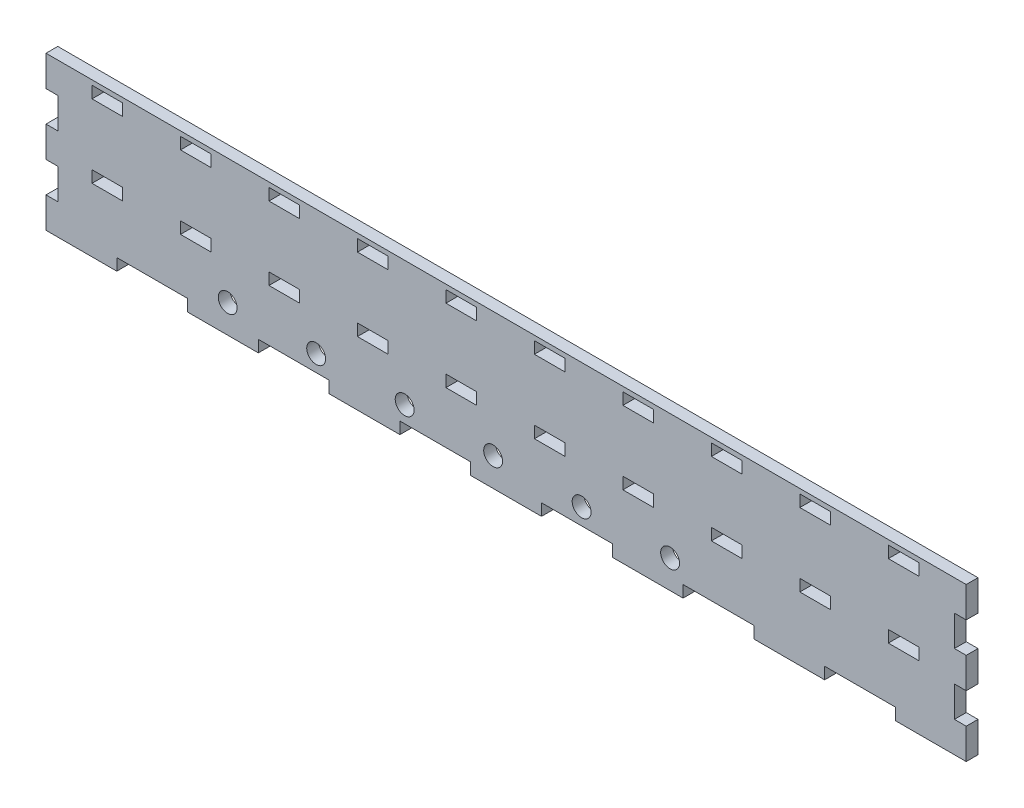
ISO-10303-21;
HEADER;
FILE_DESCRIPTION(('STEP AP214'),'2;1');
FILE_NAME('part.step','',(''),(''),'','','');
FILE_SCHEMA(('AUTOMOTIVE_DESIGN { 1 0 10303 214 1 1 1 1 }'));
ENDSEC;
DATA;
#1=APPLICATION_CONTEXT('core data for automotive mechanical design processes');
#2=APPLICATION_PROTOCOL_DEFINITION('international standard','automotive_design',2000,#1);
#3=PRODUCT_CONTEXT('',#1,'mechanical');
#4=PRODUCT('Part','Part','',(#3));
#5=PRODUCT_RELATED_PRODUCT_CATEGORY('part','',(#4));
#6=PRODUCT_DEFINITION_FORMATION('','',#4);
#7=PRODUCT_DEFINITION_CONTEXT('part definition',#1,'design');
#8=PRODUCT_DEFINITION('design','',#6,#7);
#9=PRODUCT_DEFINITION_SHAPE('','',#8);
#10=(LENGTH_UNIT() NAMED_UNIT(*) SI_UNIT(.MILLI.,.METRE.));
#11=(NAMED_UNIT(*) PLANE_ANGLE_UNIT() SI_UNIT($,.RADIAN.));
#12=(NAMED_UNIT(*) SI_UNIT($,.STERADIAN.) SOLID_ANGLE_UNIT());
#13=UNCERTAINTY_MEASURE_WITH_UNIT(LENGTH_MEASURE(1.E-05),#10,'distance_accuracy_value','');
#14=(GEOMETRIC_REPRESENTATION_CONTEXT(3) GLOBAL_UNCERTAINTY_ASSIGNED_CONTEXT((#13)) GLOBAL_UNIT_ASSIGNED_CONTEXT((#10,
#11,#12)) REPRESENTATION_CONTEXT('',''));
#15=CARTESIAN_POINT('',(0.,0.,0.));
#16=DIRECTION('',(0.,0.,1.));
#17=DIRECTION('',(1.,0.,0.));
#18=AXIS2_PLACEMENT_3D('',#15,#16,#17);
#19=CARTESIAN_POINT('',(264.5,-53.,0.));
#20=DIRECTION('',(0.,0.,1.));
#21=DIRECTION('',(1.,0.,0.));
#22=AXIS2_PLACEMENT_3D('',#19,#20,#21);
#23=CYLINDRICAL_SURFACE('',#22,4.00000000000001);
#24=CARTESIAN_POINT('',(264.5,-53.,0.));
#25=DIRECTION('',(0.,0.,1.));
#26=DIRECTION('',(1.,0.,0.));
#27=AXIS2_PLACEMENT_3D('',#24,#25,#26);
#28=CIRCLE('',#27,4.00000000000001);
#29=CARTESIAN_POINT('',(268.5,-53.,0.));
#30=VERTEX_POINT('',#29);
#31=EDGE_CURVE('E49',#30,#30,#28,.T.);
#32=ORIENTED_EDGE('',*,*,#31,.F.);
#33=EDGE_LOOP('',(#32));
#34=FACE_BOUND('',#33,.T.);
#35=CARTESIAN_POINT('',(264.5,-53.,5.));
#36=DIRECTION('',(0.,0.,1.));
#37=DIRECTION('',(1.,0.,0.));
#38=AXIS2_PLACEMENT_3D('',#35,#36,#37);
#39=CIRCLE('',#38,4.00000000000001);
#40=CARTESIAN_POINT('',(268.5,-53.,5.));
#41=VERTEX_POINT('',#40);
#42=EDGE_CURVE('E12',#41,#41,#39,.T.);
#43=ORIENTED_EDGE('',*,*,#42,.T.);
#44=EDGE_LOOP('',(#43));
#45=FACE_BOUND('',#44,.T.);
#46=ADVANCED_FACE('F40',(#34,#45),#23,.F.);
#47=CARTESIAN_POINT('',(227.,-53.,0.));
#48=DIRECTION('',(0.,0.,1.));
#49=DIRECTION('',(1.,0.,0.));
#50=AXIS2_PLACEMENT_3D('',#47,#48,#49);
#51=CYLINDRICAL_SURFACE('',#50,4.00000000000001);
#52=CARTESIAN_POINT('',(227.,-53.,0.));
#53=DIRECTION('',(0.,0.,1.));
#54=DIRECTION('',(1.,0.,0.));
#55=AXIS2_PLACEMENT_3D('',#52,#53,#54);
#56=CIRCLE('',#55,4.00000000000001);
#57=CARTESIAN_POINT('',(231.,-53.,0.));
#58=VERTEX_POINT('',#57);
#59=EDGE_CURVE('E1723',#58,#58,#56,.T.);
#60=ORIENTED_EDGE('',*,*,#59,.F.);
#61=EDGE_LOOP('',(#60));
#62=FACE_BOUND('',#61,.T.);
#63=CARTESIAN_POINT('',(227.,-53.,5.));
#64=DIRECTION('',(0.,0.,1.));
#65=DIRECTION('',(1.,0.,0.));
#66=AXIS2_PLACEMENT_3D('',#63,#64,#65);
#67=CIRCLE('',#66,4.00000000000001);
#68=CARTESIAN_POINT('',(231.,-53.,5.));
#69=VERTEX_POINT('',#68);
#70=EDGE_CURVE('E1725',#69,#69,#67,.T.);
#71=ORIENTED_EDGE('',*,*,#70,.T.);
#72=EDGE_LOOP('',(#71));
#73=FACE_BOUND('',#72,.T.);
#74=ADVANCED_FACE('F1735',(#62,#73),#51,.F.);
#75=CARTESIAN_POINT('',(189.5,-53.,0.));
#76=DIRECTION('',(0.,0.,1.));
#77=DIRECTION('',(1.,0.,0.));
#78=AXIS2_PLACEMENT_3D('',#75,#76,#77);
#79=CYLINDRICAL_SURFACE('',#78,4.00000000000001);
#80=CARTESIAN_POINT('',(189.5,-53.,0.));
#81=DIRECTION('',(0.,0.,1.));
#82=DIRECTION('',(1.,0.,0.));
#83=AXIS2_PLACEMENT_3D('',#80,#81,#82);
#84=CIRCLE('',#83,4.00000000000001);
#85=CARTESIAN_POINT('',(193.5,-53.,0.));
#86=VERTEX_POINT('',#85);
#87=EDGE_CURVE('E1713',#86,#86,#84,.T.);
#88=ORIENTED_EDGE('',*,*,#87,.F.);
#89=EDGE_LOOP('',(#88));
#90=FACE_BOUND('',#89,.T.);
#91=CARTESIAN_POINT('',(189.5,-53.,5.));
#92=DIRECTION('',(0.,0.,1.));
#93=DIRECTION('',(1.,0.,0.));
#94=AXIS2_PLACEMENT_3D('',#91,#92,#93);
#95=CIRCLE('',#94,4.00000000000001);
#96=CARTESIAN_POINT('',(193.5,-53.,5.));
#97=VERTEX_POINT('',#96);
#98=EDGE_CURVE('E1718',#97,#97,#95,.T.);
#99=ORIENTED_EDGE('',*,*,#98,.T.);
#100=EDGE_LOOP('',(#99));
#101=FACE_BOUND('',#100,.T.);
#102=ADVANCED_FACE('F1768',(#90,#101),#79,.F.);
#103=CARTESIAN_POINT('',(152.,-53.,0.));
#104=DIRECTION('',(0.,0.,1.));
#105=DIRECTION('',(1.,0.,0.));
#106=AXIS2_PLACEMENT_3D('',#103,#104,#105);
#107=CYLINDRICAL_SURFACE('',#106,4.00000000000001);
#108=CARTESIAN_POINT('',(152.,-53.,0.));
#109=DIRECTION('',(0.,0.,1.));
#110=DIRECTION('',(1.,0.,0.));
#111=AXIS2_PLACEMENT_3D('',#108,#109,#110);
#112=CIRCLE('',#111,4.00000000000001);
#113=CARTESIAN_POINT('',(156.,-53.,0.));
#114=VERTEX_POINT('',#113);
#115=EDGE_CURVE('E1706',#114,#114,#112,.T.);
#116=ORIENTED_EDGE('',*,*,#115,.F.);
#117=EDGE_LOOP('',(#116));
#118=FACE_BOUND('',#117,.T.);
#119=CARTESIAN_POINT('',(152.,-53.,5.));
#120=DIRECTION('',(0.,0.,1.));
#121=DIRECTION('',(1.,0.,0.));
#122=AXIS2_PLACEMENT_3D('',#119,#120,#121);
#123=CIRCLE('',#122,4.00000000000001);
#124=CARTESIAN_POINT('',(156.,-53.,5.));
#125=VERTEX_POINT('',#124);
#126=EDGE_CURVE('E1709',#125,#125,#123,.T.);
#127=ORIENTED_EDGE('',*,*,#126,.T.);
#128=EDGE_LOOP('',(#127));
#129=FACE_BOUND('',#128,.T.);
#130=ADVANCED_FACE('F1758',(#118,#129),#107,.F.);
#131=CARTESIAN_POINT('',(390.,0.,5.));
#132=DIRECTION('',(-1.,0.,0.));
#133=DIRECTION('',(0.,0.,1.));
#134=AXIS2_PLACEMENT_3D('',#131,#132,#133);
#135=PLANE('',#134);
#136=DIRECTION('',(0.,0.,1.));
#137=VECTOR('',#136,1.);
#138=CARTESIAN_POINT('',(390.,-52.,0.));
#139=LINE('',#138,#137);
#140=CARTESIAN_POINT('',(390.,-52.,0.));
#141=VERTEX_POINT('',#140);
#142=CARTESIAN_POINT('',(390.,-52.,5.));
#143=VERTEX_POINT('',#142);
#144=EDGE_CURVE('E1588',#141,#143,#139,.T.);
#145=ORIENTED_EDGE('',*,*,#144,.T.);
#146=DIRECTION('',(0.,1.,0.));
#147=VECTOR('',#146,1.);
#148=CARTESIAN_POINT('',(390.,0.,5.));
#149=LINE('',#148,#147);
#150=CARTESIAN_POINT('',(390.,-65.,5.));
#151=VERTEX_POINT('',#150);
#152=EDGE_CURVE('E1176',#151,#143,#149,.T.);
#153=ORIENTED_EDGE('',*,*,#152,.F.);
#154=DIRECTION('',(0.,0.,-1.));
#155=VECTOR('',#154,1.);
#156=CARTESIAN_POINT('',(390.,-65.,5.));
#157=LINE('',#156,#155);
#158=CARTESIAN_POINT('',(390.,-65.,0.));
#159=VERTEX_POINT('',#158);
#160=EDGE_CURVE('E1577',#151,#159,#157,.T.);
#161=ORIENTED_EDGE('',*,*,#160,.T.);
#162=DIRECTION('',(0.,1.,0.));
#163=VECTOR('',#162,1.);
#164=CARTESIAN_POINT('',(390.,0.,0.));
#165=LINE('',#164,#163);
#166=EDGE_CURVE('E1695',#159,#141,#165,.T.);
#167=ORIENTED_EDGE('',*,*,#166,.T.);
#168=EDGE_LOOP('',(#145,#153,#161,#167));
#169=FACE_BOUND('',#168,.T.);
#170=ADVANCED_FACE('F1587',(#169),#135,.F.);
#171=DIRECTION('',(0.,0.,1.));
#172=VECTOR('',#171,1.);
#173=CARTESIAN_POINT('',(390.,-39.,0.));
#174=LINE('',#173,#172);
#175=CARTESIAN_POINT('',(390.,-39.,0.));
#176=VERTEX_POINT('',#175);
#177=CARTESIAN_POINT('',(390.,-39.,5.));
#178=VERTEX_POINT('',#177);
#179=EDGE_CURVE('E1158',#176,#178,#174,.T.);
#180=ORIENTED_EDGE('',*,*,#179,.F.);
#181=CARTESIAN_POINT('',(390.,-26.,0.));
#182=VERTEX_POINT('',#181);
#183=EDGE_CURVE('E1698',#176,#182,#165,.T.);
#184=ORIENTED_EDGE('',*,*,#183,.T.);
#185=DIRECTION('',(0.,0.,1.));
#186=VECTOR('',#185,1.);
#187=CARTESIAN_POINT('',(390.,-26.,0.));
#188=LINE('',#187,#186);
#189=CARTESIAN_POINT('',(390.,-26.,5.));
#190=VERTEX_POINT('',#189);
#191=EDGE_CURVE('E1165',#182,#190,#188,.T.);
#192=ORIENTED_EDGE('',*,*,#191,.T.);
#193=EDGE_CURVE('E1183',#178,#190,#149,.T.);
#194=ORIENTED_EDGE('',*,*,#193,.F.);
#195=EDGE_LOOP('',(#180,#184,#192,#194));
#196=FACE_BOUND('',#195,.T.);
#197=ADVANCED_FACE('F1746',(#196),#135,.F.);
#198=DIRECTION('',(0.,0.,1.));
#199=VECTOR('',#198,1.);
#200=CARTESIAN_POINT('',(390.,-13.,0.));
#201=LINE('',#200,#199);
#202=CARTESIAN_POINT('',(390.,-13.,0.));
#203=VERTEX_POINT('',#202);
#204=CARTESIAN_POINT('',(390.,-13.,5.));
#205=VERTEX_POINT('',#204);
#206=EDGE_CURVE('E1611',#203,#205,#201,.T.);
#207=ORIENTED_EDGE('',*,*,#206,.F.);
#208=CARTESIAN_POINT('',(390.,0.,0.));
#209=VERTEX_POINT('',#208);
#210=EDGE_CURVE('E1693',#203,#209,#165,.T.);
#211=ORIENTED_EDGE('',*,*,#210,.T.);
#212=DIRECTION('',(0.,0.,-1.));
#213=VECTOR('',#212,1.);
#214=CARTESIAN_POINT('',(390.,0.,5.));
#215=LINE('',#214,#213);
#216=CARTESIAN_POINT('',(390.,0.,5.));
#217=VERTEX_POINT('',#216);
#218=EDGE_CURVE('E1584',#217,#209,#215,.T.);
#219=ORIENTED_EDGE('',*,*,#218,.F.);
#220=EDGE_CURVE('E1184',#205,#217,#149,.T.);
#221=ORIENTED_EDGE('',*,*,#220,.F.);
#222=EDGE_LOOP('',(#207,#211,#219,#221));
#223=FACE_BOUND('',#222,.T.);
#224=ADVANCED_FACE('F1739',(#223),#135,.F.);
#225=CARTESIAN_POINT('',(0.,0.,5.));
#226=DIRECTION('',(0.,0.,1.));
#227=DIRECTION('',(1.,0.,0.));
#228=AXIS2_PLACEMENT_3D('',#225,#226,#227);
#229=PLANE('',#228);
#230=DIRECTION('',(0.,-1.,0.));
#231=VECTOR('',#230,1.);
#232=CARTESIAN_POINT('',(19.5,-2.,5.));
#233=LINE('',#232,#231);
#234=CARTESIAN_POINT('',(19.5,-2.,5.));
#235=VERTEX_POINT('',#234);
#236=CARTESIAN_POINT('',(19.5,-7.,5.));
#237=VERTEX_POINT('',#236);
#238=EDGE_CURVE('E56',#235,#237,#233,.T.);
#239=ORIENTED_EDGE('',*,*,#238,.F.);
#240=DIRECTION('',(-1.,0.,0.));
#241=VECTOR('',#240,1.);
#242=CARTESIAN_POINT('',(19.5,-2.,5.));
#243=LINE('',#242,#241);
#244=CARTESIAN_POINT('',(32.5,-2.,5.));
#245=VERTEX_POINT('',#244);
#246=EDGE_CURVE('E838',#245,#235,#243,.T.);
#247=ORIENTED_EDGE('',*,*,#246,.F.);
#248=DIRECTION('',(0.,1.,0.));
#249=VECTOR('',#248,1.);
#250=CARTESIAN_POINT('',(32.5,-2.,5.));
#251=LINE('',#250,#249);
#252=CARTESIAN_POINT('',(32.5,-7.,5.));
#253=VERTEX_POINT('',#252);
#254=EDGE_CURVE('E830',#253,#245,#251,.T.);
#255=ORIENTED_EDGE('',*,*,#254,.F.);
#256=DIRECTION('',(1.,0.,0.));
#257=VECTOR('',#256,1.);
#258=CARTESIAN_POINT('',(19.5,-7.,5.));
#259=LINE('',#258,#257);
#260=EDGE_CURVE('E816',#237,#253,#259,.T.);
#261=ORIENTED_EDGE('',*,*,#260,.F.);
#262=EDGE_LOOP('',(#239,#247,#255,#261));
#263=FACE_BOUND('',#262,.T.);
#264=DIRECTION('',(0.,-1.,0.));
#265=VECTOR('',#264,1.);
#266=CARTESIAN_POINT('',(282.,-2.,5.));
#267=LINE('',#266,#265);
#268=CARTESIAN_POINT('',(282.,-2.,5.));
#269=VERTEX_POINT('',#268);
#270=CARTESIAN_POINT('',(282.,-7.,5.));
#271=VERTEX_POINT('',#270);
#272=EDGE_CURVE('E64',#269,#271,#267,.T.);
#273=ORIENTED_EDGE('',*,*,#272,.F.);
#274=DIRECTION('',(-1.,0.,0.));
#275=VECTOR('',#274,1.);
#276=CARTESIAN_POINT('',(282.,-2.,5.));
#277=LINE('',#276,#275);
#278=CARTESIAN_POINT('',(295.,-2.,5.));
#279=VERTEX_POINT('',#278);
#280=EDGE_CURVE('E3044',#279,#269,#277,.T.);
#281=ORIENTED_EDGE('',*,*,#280,.F.);
#282=DIRECTION('',(0.,1.,0.));
#283=VECTOR('',#282,1.);
#284=CARTESIAN_POINT('',(295.,-2.,5.));
#285=LINE('',#284,#283);
#286=CARTESIAN_POINT('',(295.,-7.,5.));
#287=VERTEX_POINT('',#286);
#288=EDGE_CURVE('E3038',#287,#279,#285,.T.);
#289=ORIENTED_EDGE('',*,*,#288,.F.);
#290=DIRECTION('',(1.,0.,0.));
#291=VECTOR('',#290,1.);
#292=CARTESIAN_POINT('',(282.,-7.,5.));
#293=LINE('',#292,#291);
#294=EDGE_CURVE('E902',#271,#287,#293,.T.);
#295=ORIENTED_EDGE('',*,*,#294,.F.);
#296=EDGE_LOOP('',(#273,#281,#289,#295));
#297=FACE_BOUND('',#296,.T.);
#298=DIRECTION('',(0.,-1.,0.));
#299=VECTOR('',#298,1.);
#300=CARTESIAN_POINT('',(244.5,-2.,5.));
#301=LINE('',#300,#299);
#302=CARTESIAN_POINT('',(244.5,-2.,5.));
#303=VERTEX_POINT('',#302);
#304=CARTESIAN_POINT('',(244.5,-7.,5.));
#305=VERTEX_POINT('',#304);
#306=EDGE_CURVE('E916',#303,#305,#301,.T.);
#307=ORIENTED_EDGE('',*,*,#306,.F.);
#308=DIRECTION('',(-1.,0.,0.));
#309=VECTOR('',#308,1.);
#310=CARTESIAN_POINT('',(244.5,-2.,5.));
#311=LINE('',#310,#309);
#312=CARTESIAN_POINT('',(257.5,-2.,5.));
#313=VERTEX_POINT('',#312);
#314=EDGE_CURVE('E3430',#313,#303,#311,.T.);
#315=ORIENTED_EDGE('',*,*,#314,.F.);
#316=DIRECTION('',(0.,1.,0.));
#317=VECTOR('',#316,1.);
#318=CARTESIAN_POINT('',(257.5,-2.,5.));
#319=LINE('',#318,#317);
#320=CARTESIAN_POINT('',(257.5,-7.,5.));
#321=VERTEX_POINT('',#320);
#322=EDGE_CURVE('E3426',#321,#313,#319,.T.);
#323=ORIENTED_EDGE('',*,*,#322,.F.);
#324=DIRECTION('',(1.,0.,0.));
#325=VECTOR('',#324,1.);
#326=CARTESIAN_POINT('',(244.5,-7.,5.));
#327=LINE('',#326,#325);
#328=EDGE_CURVE('E3065',#305,#321,#327,.T.);
#329=ORIENTED_EDGE('',*,*,#328,.F.);
#330=EDGE_LOOP('',(#307,#315,#323,#329));
#331=FACE_BOUND('',#330,.T.);
#332=DIRECTION('',(0.,-1.,0.));
#333=VECTOR('',#332,1.);
#334=CARTESIAN_POINT('',(357.,-2.,5.));
#335=LINE('',#334,#333);
#336=CARTESIAN_POINT('',(357.,-2.,5.));
#337=VERTEX_POINT('',#336);
#338=CARTESIAN_POINT('',(357.,-7.,5.));
#339=VERTEX_POINT('',#338);
#340=EDGE_CURVE('E3076',#337,#339,#335,.T.);
#341=ORIENTED_EDGE('',*,*,#340,.F.);
#342=DIRECTION('',(-1.,0.,0.));
#343=VECTOR('',#342,1.);
#344=CARTESIAN_POINT('',(357.,-2.,5.));
#345=LINE('',#344,#343);
#346=CARTESIAN_POINT('',(370.,-2.,5.));
#347=VERTEX_POINT('',#346);
#348=EDGE_CURVE('E3422',#347,#337,#345,.T.);
#349=ORIENTED_EDGE('',*,*,#348,.F.);
#350=DIRECTION('',(0.,1.,0.));
#351=VECTOR('',#350,1.);
#352=CARTESIAN_POINT('',(370.,-2.,5.));
#353=LINE('',#352,#351);
#354=CARTESIAN_POINT('',(370.,-7.,5.));
#355=VERTEX_POINT('',#354);
#356=EDGE_CURVE('E3418',#355,#347,#353,.T.);
#357=ORIENTED_EDGE('',*,*,#356,.F.);
#358=DIRECTION('',(1.,0.,0.));
#359=VECTOR('',#358,1.);
#360=CARTESIAN_POINT('',(357.,-7.,5.));
#361=LINE('',#360,#359);
#362=EDGE_CURVE('E877',#339,#355,#361,.T.);
#363=ORIENTED_EDGE('',*,*,#362,.F.);
#364=EDGE_LOOP('',(#341,#349,#357,#363));
#365=FACE_BOUND('',#364,.T.);
#366=DIRECTION('',(0.,-1.,0.));
#367=VECTOR('',#366,1.);
#368=CARTESIAN_POINT('',(319.5,-2.,5.));
#369=LINE('',#368,#367);
#370=CARTESIAN_POINT('',(319.5,-2.,5.));
#371=VERTEX_POINT('',#370);
#372=CARTESIAN_POINT('',(319.5,-7.,5.));
#373=VERTEX_POINT('',#372);
#374=EDGE_CURVE('E892',#371,#373,#369,.T.);
#375=ORIENTED_EDGE('',*,*,#374,.F.);
#376=DIRECTION('',(-1.,0.,0.));
#377=VECTOR('',#376,1.);
#378=CARTESIAN_POINT('',(319.5,-2.,5.));
#379=LINE('',#378,#377);
#380=CARTESIAN_POINT('',(332.5,-2.,5.));
#381=VERTEX_POINT('',#380);
#382=EDGE_CURVE('E3414',#381,#371,#379,.T.);
#383=ORIENTED_EDGE('',*,*,#382,.F.);
#384=DIRECTION('',(0.,1.,0.));
#385=VECTOR('',#384,1.);
#386=CARTESIAN_POINT('',(332.5,-2.,5.));
#387=LINE('',#386,#385);
#388=CARTESIAN_POINT('',(332.5,-7.,5.));
#389=VERTEX_POINT('',#388);
#390=EDGE_CURVE('E3410',#389,#381,#387,.T.);
#391=ORIENTED_EDGE('',*,*,#390,.F.);
#392=DIRECTION('',(1.,0.,0.));
#393=VECTOR('',#392,1.);
#394=CARTESIAN_POINT('',(319.5,-7.,5.));
#395=LINE('',#394,#393);
#396=EDGE_CURVE('E3086',#373,#389,#395,.T.);
#397=ORIENTED_EDGE('',*,*,#396,.F.);
#398=EDGE_LOOP('',(#375,#383,#391,#397));
#399=FACE_BOUND('',#398,.T.);
#400=DIRECTION('',(0.,-1.,0.));
#401=VECTOR('',#400,1.);
#402=CARTESIAN_POINT('',(132.,-2.,5.));
#403=LINE('',#402,#401);
#404=CARTESIAN_POINT('',(132.,-2.,5.));
#405=VERTEX_POINT('',#404);
#406=CARTESIAN_POINT('',(132.,-7.,5.));
#407=VERTEX_POINT('',#406);
#408=EDGE_CURVE('E3097',#405,#407,#403,.T.);
#409=ORIENTED_EDGE('',*,*,#408,.F.);
#410=DIRECTION('',(-1.,0.,0.));
#411=VECTOR('',#410,1.);
#412=CARTESIAN_POINT('',(132.,-2.,5.));
#413=LINE('',#412,#411);
#414=CARTESIAN_POINT('',(145.,-2.,5.));
#415=VERTEX_POINT('',#414);
#416=EDGE_CURVE('E3406',#415,#405,#413,.T.);
#417=ORIENTED_EDGE('',*,*,#416,.F.);
#418=DIRECTION('',(0.,1.,0.));
#419=VECTOR('',#418,1.);
#420=CARTESIAN_POINT('',(145.,-2.,5.));
#421=LINE('',#420,#419);
#422=CARTESIAN_POINT('',(145.,-7.,5.));
#423=VERTEX_POINT('',#422);
#424=EDGE_CURVE('E3402',#423,#415,#421,.T.);
#425=ORIENTED_EDGE('',*,*,#424,.F.);
#426=DIRECTION('',(1.,0.,0.));
#427=VECTOR('',#426,1.);
#428=CARTESIAN_POINT('',(132.,-7.,5.));
#429=LINE('',#428,#427);
#430=EDGE_CURVE('E951',#407,#423,#429,.T.);
#431=ORIENTED_EDGE('',*,*,#430,.F.);
#432=EDGE_LOOP('',(#409,#417,#425,#431));
#433=FACE_BOUND('',#432,.T.);
#434=DIRECTION('',(0.,-1.,0.));
#435=VECTOR('',#434,1.);
#436=CARTESIAN_POINT('',(94.5,-2.,5.));
#437=LINE('',#436,#435);
#438=CARTESIAN_POINT('',(94.5,-2.,5.));
#439=VERTEX_POINT('',#438);
#440=CARTESIAN_POINT('',(94.5,-7.,5.));
#441=VERTEX_POINT('',#440);
#442=EDGE_CURVE('E966',#439,#441,#437,.T.);
#443=ORIENTED_EDGE('',*,*,#442,.F.);
#444=DIRECTION('',(-1.,0.,0.));
#445=VECTOR('',#444,1.);
#446=CARTESIAN_POINT('',(94.5,-2.,5.));
#447=LINE('',#446,#445);
#448=CARTESIAN_POINT('',(107.5,-2.,5.));
#449=VERTEX_POINT('',#448);
#450=EDGE_CURVE('E3398',#449,#439,#447,.T.);
#451=ORIENTED_EDGE('',*,*,#450,.F.);
#452=DIRECTION('',(0.,1.,0.));
#453=VECTOR('',#452,1.);
#454=CARTESIAN_POINT('',(107.5,-2.,5.));
#455=LINE('',#454,#453);
#456=CARTESIAN_POINT('',(107.5,-7.,5.));
#457=VERTEX_POINT('',#456);
#458=EDGE_CURVE('E3394',#457,#449,#455,.T.);
#459=ORIENTED_EDGE('',*,*,#458,.F.);
#460=DIRECTION('',(1.,0.,0.));
#461=VECTOR('',#460,1.);
#462=CARTESIAN_POINT('',(94.5,-7.,5.));
#463=LINE('',#462,#461);
#464=EDGE_CURVE('E3107',#441,#457,#463,.T.);
#465=ORIENTED_EDGE('',*,*,#464,.F.);
#466=EDGE_LOOP('',(#443,#451,#459,#465));
#467=FACE_BOUND('',#466,.T.);
#468=DIRECTION('',(0.,-1.,0.));
#469=VECTOR('',#468,1.);
#470=CARTESIAN_POINT('',(207.,-2.,5.));
#471=LINE('',#470,#469);
#472=CARTESIAN_POINT('',(207.,-2.,5.));
#473=VERTEX_POINT('',#472);
#474=CARTESIAN_POINT('',(207.,-7.,5.));
#475=VERTEX_POINT('',#474);
#476=EDGE_CURVE('E3118',#473,#475,#471,.T.);
#477=ORIENTED_EDGE('',*,*,#476,.F.);
#478=DIRECTION('',(-1.,0.,0.));
#479=VECTOR('',#478,1.);
#480=CARTESIAN_POINT('',(207.,-2.,5.));
#481=LINE('',#480,#479);
#482=CARTESIAN_POINT('',(220.,-2.,5.));
#483=VERTEX_POINT('',#482);
#484=EDGE_CURVE('E3390',#483,#473,#481,.T.);
#485=ORIENTED_EDGE('',*,*,#484,.F.);
#486=DIRECTION('',(0.,1.,0.));
#487=VECTOR('',#486,1.);
#488=CARTESIAN_POINT('',(220.,-2.,5.));
#489=LINE('',#488,#487);
#490=CARTESIAN_POINT('',(220.,-7.,5.));
#491=VERTEX_POINT('',#490);
#492=EDGE_CURVE('E3386',#491,#483,#489,.T.);
#493=ORIENTED_EDGE('',*,*,#492,.F.);
#494=DIRECTION('',(1.,0.,0.));
#495=VECTOR('',#494,1.);
#496=CARTESIAN_POINT('',(207.,-7.,5.));
#497=LINE('',#496,#495);
#498=EDGE_CURVE('E926',#475,#491,#497,.T.);
#499=ORIENTED_EDGE('',*,*,#498,.F.);
#500=EDGE_LOOP('',(#477,#485,#493,#499));
#501=FACE_BOUND('',#500,.T.);
#502=DIRECTION('',(0.,-1.,0.));
#503=VECTOR('',#502,1.);
#504=CARTESIAN_POINT('',(169.5,-2.,5.));
#505=LINE('',#504,#503);
#506=CARTESIAN_POINT('',(169.5,-2.,5.));
#507=VERTEX_POINT('',#506);
#508=CARTESIAN_POINT('',(169.5,-7.,5.));
#509=VERTEX_POINT('',#508);
#510=EDGE_CURVE('E941',#507,#509,#505,.T.);
#511=ORIENTED_EDGE('',*,*,#510,.F.);
#512=DIRECTION('',(-1.,0.,0.));
#513=VECTOR('',#512,1.);
#514=CARTESIAN_POINT('',(169.5,-2.,5.));
#515=LINE('',#514,#513);
#516=CARTESIAN_POINT('',(182.5,-2.,5.));
#517=VERTEX_POINT('',#516);
#518=EDGE_CURVE('E3382',#517,#507,#515,.T.);
#519=ORIENTED_EDGE('',*,*,#518,.F.);
#520=DIRECTION('',(0.,1.,0.));
#521=VECTOR('',#520,1.);
#522=CARTESIAN_POINT('',(182.5,-2.,5.));
#523=LINE('',#522,#521);
#524=CARTESIAN_POINT('',(182.5,-7.,5.));
#525=VERTEX_POINT('',#524);
#526=EDGE_CURVE('E3378',#525,#517,#523,.T.);
#527=ORIENTED_EDGE('',*,*,#526,.F.);
#528=DIRECTION('',(1.,0.,0.));
#529=VECTOR('',#528,1.);
#530=CARTESIAN_POINT('',(169.5,-7.,5.));
#531=LINE('',#530,#529);
#532=EDGE_CURVE('E3128',#509,#525,#531,.T.);
#533=ORIENTED_EDGE('',*,*,#532,.F.);
#534=EDGE_LOOP('',(#511,#519,#527,#533));
#535=FACE_BOUND('',#534,.T.);
#536=DIRECTION('',(0.,-1.,0.));
#537=VECTOR('',#536,1.);
#538=CARTESIAN_POINT('',(19.5,-33.,5.));
#539=LINE('',#538,#537);
#540=CARTESIAN_POINT('',(19.5,-33.,5.));
#541=VERTEX_POINT('',#540);
#542=CARTESIAN_POINT('',(19.5,-38.,5.));
#543=VERTEX_POINT('',#542);
#544=EDGE_CURVE('E3139',#541,#543,#539,.T.);
#545=ORIENTED_EDGE('',*,*,#544,.F.);
#546=DIRECTION('',(-1.,0.,0.));
#547=VECTOR('',#546,1.);
#548=CARTESIAN_POINT('',(19.5,-33.,5.));
#549=LINE('',#548,#547);
#550=CARTESIAN_POINT('',(32.5,-33.,5.));
#551=VERTEX_POINT('',#550);
#552=EDGE_CURVE('E3374',#551,#541,#549,.T.);
#553=ORIENTED_EDGE('',*,*,#552,.F.);
#554=DIRECTION('',(0.,1.,0.));
#555=VECTOR('',#554,1.);
#556=CARTESIAN_POINT('',(32.5,-33.,5.));
#557=LINE('',#556,#555);
#558=CARTESIAN_POINT('',(32.5,-38.,5.));
#559=VERTEX_POINT('',#558);
#560=EDGE_CURVE('E3370',#559,#551,#557,.T.);
#561=ORIENTED_EDGE('',*,*,#560,.F.);
#562=DIRECTION('',(1.,0.,0.));
#563=VECTOR('',#562,1.);
#564=CARTESIAN_POINT('',(19.5,-38.,5.));
#565=LINE('',#564,#563);
#566=EDGE_CURVE('E975',#543,#559,#565,.T.);
#567=ORIENTED_EDGE('',*,*,#566,.F.);
#568=EDGE_LOOP('',(#545,#553,#561,#567));
#569=FACE_BOUND('',#568,.T.);
#570=DIRECTION('',(0.,-1.,0.));
#571=VECTOR('',#570,1.);
#572=CARTESIAN_POINT('',(282.,-33.,5.));
#573=LINE('',#572,#571);
#574=CARTESIAN_POINT('',(282.,-33.,5.));
#575=VERTEX_POINT('',#574);
#576=CARTESIAN_POINT('',(282.,-38.,5.));
#577=VERTEX_POINT('',#576);
#578=EDGE_CURVE('E991',#575,#577,#573,.T.);
#579=ORIENTED_EDGE('',*,*,#578,.F.);
#580=DIRECTION('',(-1.,0.,0.));
#581=VECTOR('',#580,1.);
#582=CARTESIAN_POINT('',(282.,-33.,5.));
#583=LINE('',#582,#581);
#584=CARTESIAN_POINT('',(295.,-33.,5.));
#585=VERTEX_POINT('',#584);
#586=EDGE_CURVE('E3366',#585,#575,#583,.T.);
#587=ORIENTED_EDGE('',*,*,#586,.F.);
#588=DIRECTION('',(0.,1.,0.));
#589=VECTOR('',#588,1.);
#590=CARTESIAN_POINT('',(295.,-33.,5.));
#591=LINE('',#590,#589);
#592=CARTESIAN_POINT('',(295.,-38.,5.));
#593=VERTEX_POINT('',#592);
#594=EDGE_CURVE('E3362',#593,#585,#591,.T.);
#595=ORIENTED_EDGE('',*,*,#594,.F.);
#596=DIRECTION('',(1.,0.,0.));
#597=VECTOR('',#596,1.);
#598=CARTESIAN_POINT('',(282.,-38.,5.));
#599=LINE('',#598,#597);
#600=EDGE_CURVE('E3168',#577,#593,#599,.T.);
#601=ORIENTED_EDGE('',*,*,#600,.F.);
#602=EDGE_LOOP('',(#579,#587,#595,#601));
#603=FACE_BOUND('',#602,.T.);
#604=DIRECTION('',(0.,-1.,0.));
#605=VECTOR('',#604,1.);
#606=CARTESIAN_POINT('',(244.5,-33.,5.));
#607=LINE('',#606,#605);
#608=CARTESIAN_POINT('',(244.5,-33.,5.));
#609=VERTEX_POINT('',#608);
#610=CARTESIAN_POINT('',(244.5,-38.,5.));
#611=VERTEX_POINT('',#610);
#612=EDGE_CURVE('E3179',#609,#611,#607,.T.);
#613=ORIENTED_EDGE('',*,*,#612,.F.);
#614=DIRECTION('',(-1.,0.,0.));
#615=VECTOR('',#614,1.);
#616=CARTESIAN_POINT('',(244.5,-33.,5.));
#617=LINE('',#616,#615);
#618=CARTESIAN_POINT('',(257.5,-33.,5.));
#619=VERTEX_POINT('',#618);
#620=EDGE_CURVE('E3358',#619,#609,#617,.T.);
#621=ORIENTED_EDGE('',*,*,#620,.F.);
#622=DIRECTION('',(0.,1.,0.));
#623=VECTOR('',#622,1.);
#624=CARTESIAN_POINT('',(257.5,-33.,5.));
#625=LINE('',#624,#623);
#626=CARTESIAN_POINT('',(257.5,-38.,5.));
#627=VERTEX_POINT('',#626);
#628=EDGE_CURVE('E3354',#627,#619,#625,.T.);
#629=ORIENTED_EDGE('',*,*,#628,.F.);
#630=DIRECTION('',(1.,0.,0.));
#631=VECTOR('',#630,1.);
#632=CARTESIAN_POINT('',(244.5,-38.,5.));
#633=LINE('',#632,#631);
#634=EDGE_CURVE('E1001',#611,#627,#633,.T.);
#635=ORIENTED_EDGE('',*,*,#634,.F.);
#636=EDGE_LOOP('',(#613,#621,#629,#635));
#637=FACE_BOUND('',#636,.T.);
#638=DIRECTION('',(0.,-1.,0.));
#639=VECTOR('',#638,1.);
#640=CARTESIAN_POINT('',(357.,-33.,5.));
#641=LINE('',#640,#639);
#642=CARTESIAN_POINT('',(357.,-33.,5.));
#643=VERTEX_POINT('',#642);
#644=CARTESIAN_POINT('',(357.,-38.,5.));
#645=VERTEX_POINT('',#644);
#646=EDGE_CURVE('E1016',#643,#645,#641,.T.);
#647=ORIENTED_EDGE('',*,*,#646,.F.);
#648=DIRECTION('',(-1.,0.,0.));
#649=VECTOR('',#648,1.);
#650=CARTESIAN_POINT('',(357.,-33.,5.));
#651=LINE('',#650,#649);
#652=CARTESIAN_POINT('',(370.,-33.,5.));
#653=VERTEX_POINT('',#652);
#654=EDGE_CURVE('E3350',#653,#643,#651,.T.);
#655=ORIENTED_EDGE('',*,*,#654,.F.);
#656=DIRECTION('',(0.,1.,0.));
#657=VECTOR('',#656,1.);
#658=CARTESIAN_POINT('',(370.,-33.,5.));
#659=LINE('',#658,#657);
#660=CARTESIAN_POINT('',(370.,-38.,5.));
#661=VERTEX_POINT('',#660);
#662=EDGE_CURVE('E3346',#661,#653,#659,.T.);
#663=ORIENTED_EDGE('',*,*,#662,.F.);
#664=DIRECTION('',(1.,0.,0.));
#665=VECTOR('',#664,1.);
#666=CARTESIAN_POINT('',(357.,-38.,5.));
#667=LINE('',#666,#665);
#668=EDGE_CURVE('E866',#645,#661,#667,.T.);
#669=ORIENTED_EDGE('',*,*,#668,.F.);
#670=EDGE_LOOP('',(#647,#655,#663,#669));
#671=FACE_BOUND('',#670,.T.);
#672=DIRECTION('',(0.,-1.,0.));
#673=VECTOR('',#672,1.);
#674=CARTESIAN_POINT('',(319.5,-33.,5.));
#675=LINE('',#674,#673);
#676=CARTESIAN_POINT('',(319.5,-33.,5.));
#677=VERTEX_POINT('',#676);
#678=CARTESIAN_POINT('',(319.5,-38.,5.));
#679=VERTEX_POINT('',#678);
#680=EDGE_CURVE('E3158',#677,#679,#675,.T.);
#681=ORIENTED_EDGE('',*,*,#680,.F.);
#682=DIRECTION('',(-1.,0.,0.));
#683=VECTOR('',#682,1.);
#684=CARTESIAN_POINT('',(319.5,-33.,5.));
#685=LINE('',#684,#683);
#686=CARTESIAN_POINT('',(332.5,-33.,5.));
#687=VERTEX_POINT('',#686);
#688=EDGE_CURVE('E3342',#687,#677,#685,.T.);
#689=ORIENTED_EDGE('',*,*,#688,.F.);
#690=DIRECTION('',(0.,1.,0.));
#691=VECTOR('',#690,1.);
#692=CARTESIAN_POINT('',(332.5,-33.,5.));
#693=LINE('',#692,#691);
#694=CARTESIAN_POINT('',(332.5,-38.,5.));
#695=VERTEX_POINT('',#694);
#696=EDGE_CURVE('E3338',#695,#687,#693,.T.);
#697=ORIENTED_EDGE('',*,*,#696,.F.);
#698=DIRECTION('',(1.,0.,0.));
#699=VECTOR('',#698,1.);
#700=CARTESIAN_POINT('',(319.5,-38.,5.));
#701=LINE('',#700,#699);
#702=EDGE_CURVE('E1026',#679,#695,#701,.T.);
#703=ORIENTED_EDGE('',*,*,#702,.F.);
#704=EDGE_LOOP('',(#681,#689,#697,#703));
#705=FACE_BOUND('',#704,.T.);
#706=DIRECTION('',(0.,-1.,0.));
#707=VECTOR('',#706,1.);
#708=CARTESIAN_POINT('',(132.,-33.,5.));
#709=LINE('',#708,#707);
#710=CARTESIAN_POINT('',(132.,-33.,5.));
#711=VERTEX_POINT('',#710);
#712=CARTESIAN_POINT('',(132.,-38.,5.));
#713=VERTEX_POINT('',#712);
#714=EDGE_CURVE('E1041',#711,#713,#709,.T.);
#715=ORIENTED_EDGE('',*,*,#714,.F.);
#716=DIRECTION('',(-1.,0.,0.));
#717=VECTOR('',#716,1.);
#718=CARTESIAN_POINT('',(132.,-33.,5.));
#719=LINE('',#718,#717);
#720=CARTESIAN_POINT('',(145.,-33.,5.));
#721=VERTEX_POINT('',#720);
#722=EDGE_CURVE('E3334',#721,#711,#719,.T.);
#723=ORIENTED_EDGE('',*,*,#722,.F.);
#724=DIRECTION('',(0.,1.,0.));
#725=VECTOR('',#724,1.);
#726=CARTESIAN_POINT('',(145.,-33.,5.));
#727=LINE('',#726,#725);
#728=CARTESIAN_POINT('',(145.,-38.,5.));
#729=VERTEX_POINT('',#728);
#730=EDGE_CURVE('E3330',#729,#721,#727,.T.);
#731=ORIENTED_EDGE('',*,*,#730,.F.);
#732=DIRECTION('',(1.,0.,0.));
#733=VECTOR('',#732,1.);
#734=CARTESIAN_POINT('',(132.,-38.,5.));
#735=LINE('',#734,#733);
#736=EDGE_CURVE('E3211',#713,#729,#735,.T.);
#737=ORIENTED_EDGE('',*,*,#736,.F.);
#738=EDGE_LOOP('',(#715,#723,#731,#737));
#739=FACE_BOUND('',#738,.T.);
#740=DIRECTION('',(0.,-1.,0.));
#741=VECTOR('',#740,1.);
#742=CARTESIAN_POINT('',(94.5,-33.,5.));
#743=LINE('',#742,#741);
#744=CARTESIAN_POINT('',(94.5,-33.,5.));
#745=VERTEX_POINT('',#744);
#746=CARTESIAN_POINT('',(94.5,-38.,5.));
#747=VERTEX_POINT('',#746);
#748=EDGE_CURVE('E3222',#745,#747,#743,.T.);
#749=ORIENTED_EDGE('',*,*,#748,.F.);
#750=DIRECTION('',(-1.,0.,0.));
#751=VECTOR('',#750,1.);
#752=CARTESIAN_POINT('',(94.5,-33.,5.));
#753=LINE('',#752,#751);
#754=CARTESIAN_POINT('',(107.5,-33.,5.));
#755=VERTEX_POINT('',#754);
#756=EDGE_CURVE('E3326',#755,#745,#753,.T.);
#757=ORIENTED_EDGE('',*,*,#756,.F.);
#758=DIRECTION('',(0.,1.,0.));
#759=VECTOR('',#758,1.);
#760=CARTESIAN_POINT('',(107.5,-33.,5.));
#761=LINE('',#760,#759);
#762=CARTESIAN_POINT('',(107.5,-38.,5.));
#763=VERTEX_POINT('',#762);
#764=EDGE_CURVE('E3322',#763,#755,#761,.T.);
#765=ORIENTED_EDGE('',*,*,#764,.F.);
#766=DIRECTION('',(1.,0.,0.));
#767=VECTOR('',#766,1.);
#768=CARTESIAN_POINT('',(94.5,-38.,5.));
#769=LINE('',#768,#767);
#770=EDGE_CURVE('E1052',#747,#763,#769,.T.);
#771=ORIENTED_EDGE('',*,*,#770,.F.);
#772=EDGE_LOOP('',(#749,#757,#765,#771));
#773=FACE_BOUND('',#772,.T.);
#774=DIRECTION('',(0.,-1.,0.));
#775=VECTOR('',#774,1.);
#776=CARTESIAN_POINT('',(207.,-33.,5.));
#777=LINE('',#776,#775);
#778=CARTESIAN_POINT('',(207.,-33.,5.));
#779=VERTEX_POINT('',#778);
#780=CARTESIAN_POINT('',(207.,-38.,5.));
#781=VERTEX_POINT('',#780);
#782=EDGE_CURVE('E1067',#779,#781,#777,.T.);
#783=ORIENTED_EDGE('',*,*,#782,.F.);
#784=DIRECTION('',(-1.,0.,0.));
#785=VECTOR('',#784,1.);
#786=CARTESIAN_POINT('',(207.,-33.,5.));
#787=LINE('',#786,#785);
#788=CARTESIAN_POINT('',(220.,-33.,5.));
#789=VERTEX_POINT('',#788);
#790=EDGE_CURVE('E3318',#789,#779,#787,.T.);
#791=ORIENTED_EDGE('',*,*,#790,.F.);
#792=DIRECTION('',(0.,1.,0.));
#793=VECTOR('',#792,1.);
#794=CARTESIAN_POINT('',(220.,-33.,5.));
#795=LINE('',#794,#793);
#796=CARTESIAN_POINT('',(220.,-38.,5.));
#797=VERTEX_POINT('',#796);
#798=EDGE_CURVE('E3314',#797,#789,#795,.T.);
#799=ORIENTED_EDGE('',*,*,#798,.F.);
#800=DIRECTION('',(1.,0.,0.));
#801=VECTOR('',#800,1.);
#802=CARTESIAN_POINT('',(207.,-38.,5.));
#803=LINE('',#802,#801);
#804=EDGE_CURVE('E3189',#781,#797,#803,.T.);
#805=ORIENTED_EDGE('',*,*,#804,.F.);
#806=EDGE_LOOP('',(#783,#791,#799,#805));
#807=FACE_BOUND('',#806,.T.);
#808=DIRECTION('',(0.,-1.,0.));
#809=VECTOR('',#808,1.);
#810=CARTESIAN_POINT('',(169.5,-33.,5.));
#811=LINE('',#810,#809);
#812=CARTESIAN_POINT('',(169.5,-33.,5.));
#813=VERTEX_POINT('',#812);
#814=CARTESIAN_POINT('',(169.5,-38.,5.));
#815=VERTEX_POINT('',#814);
#816=EDGE_CURVE('E3200',#813,#815,#811,.T.);
#817=ORIENTED_EDGE('',*,*,#816,.F.);
#818=DIRECTION('',(-1.,0.,0.));
#819=VECTOR('',#818,1.);
#820=CARTESIAN_POINT('',(169.5,-33.,5.));
#821=LINE('',#820,#819);
#822=CARTESIAN_POINT('',(182.5,-33.,5.));
#823=VERTEX_POINT('',#822);
#824=EDGE_CURVE('E3310',#823,#813,#821,.T.);
#825=ORIENTED_EDGE('',*,*,#824,.F.);
#826=DIRECTION('',(0.,1.,0.));
#827=VECTOR('',#826,1.);
#828=CARTESIAN_POINT('',(182.5,-33.,5.));
#829=LINE('',#828,#827);
#830=CARTESIAN_POINT('',(182.5,-38.,5.));
#831=VERTEX_POINT('',#830);
#832=EDGE_CURVE('E3306',#831,#823,#829,.T.);
#833=ORIENTED_EDGE('',*,*,#832,.F.);
#834=DIRECTION('',(1.,0.,0.));
#835=VECTOR('',#834,1.);
#836=CARTESIAN_POINT('',(169.5,-38.,5.));
#837=LINE('',#836,#835);
#838=EDGE_CURVE('E1077',#815,#831,#837,.T.);
#839=ORIENTED_EDGE('',*,*,#838,.F.);
#840=EDGE_LOOP('',(#817,#825,#833,#839));
#841=FACE_BOUND('',#840,.T.);
#842=DIRECTION('',(0.,-1.,0.));
#843=VECTOR('',#842,1.);
#844=CARTESIAN_POINT('',(57.,-33.,5.));
#845=LINE('',#844,#843);
#846=CARTESIAN_POINT('',(57.,-33.,5.));
#847=VERTEX_POINT('',#846);
#848=CARTESIAN_POINT('',(57.,-38.,5.));
#849=VERTEX_POINT('',#848);
#850=EDGE_CURVE('E1092',#847,#849,#845,.T.);
#851=ORIENTED_EDGE('',*,*,#850,.F.);
#852=DIRECTION('',(-1.,0.,0.));
#853=VECTOR('',#852,1.);
#854=CARTESIAN_POINT('',(57.,-33.,5.));
#855=LINE('',#854,#853);
#856=CARTESIAN_POINT('',(70.,-33.,5.));
#857=VERTEX_POINT('',#856);
#858=EDGE_CURVE('E3235',#857,#847,#855,.T.);
#859=ORIENTED_EDGE('',*,*,#858,.F.);
#860=DIRECTION('',(0.,1.,0.));
#861=VECTOR('',#860,1.);
#862=CARTESIAN_POINT('',(70.,-33.,5.));
#863=LINE('',#862,#861);
#864=CARTESIAN_POINT('',(70.,-38.,5.));
#865=VERTEX_POINT('',#864);
#866=EDGE_CURVE('E1105',#865,#857,#863,.T.);
#867=ORIENTED_EDGE('',*,*,#866,.F.);
#868=DIRECTION('',(1.,0.,0.));
#869=VECTOR('',#868,1.);
#870=CARTESIAN_POINT('',(57.,-38.,5.));
#871=LINE('',#870,#869);
#872=EDGE_CURVE('E1097',#849,#865,#871,.T.);
#873=ORIENTED_EDGE('',*,*,#872,.F.);
#874=EDGE_LOOP('',(#851,#859,#867,#873));
#875=FACE_BOUND('',#874,.T.);
#876=DIRECTION('',(0.,-1.,0.));
#877=VECTOR('',#876,1.);
#878=CARTESIAN_POINT('',(57.,-2.,5.));
#879=LINE('',#878,#877);
#880=CARTESIAN_POINT('',(57.,-2.,5.));
#881=VERTEX_POINT('',#880);
#882=CARTESIAN_POINT('',(57.,-7.,5.));
#883=VERTEX_POINT('',#882);
#884=EDGE_CURVE('E1113',#881,#883,#879,.T.);
#885=ORIENTED_EDGE('',*,*,#884,.F.);
#886=DIRECTION('',(-1.,0.,0.));
#887=VECTOR('',#886,1.);
#888=CARTESIAN_POINT('',(57.,-2.,5.));
#889=LINE('',#888,#887);
#890=CARTESIAN_POINT('',(70.,-2.,5.));
#891=VERTEX_POINT('',#890);
#892=EDGE_CURVE('E3256',#891,#881,#889,.T.);
#893=ORIENTED_EDGE('',*,*,#892,.F.);
#894=DIRECTION('',(0.,1.,0.));
#895=VECTOR('',#894,1.);
#896=CARTESIAN_POINT('',(70.,-2.,5.));
#897=LINE('',#896,#895);
#898=CARTESIAN_POINT('',(70.,-7.,5.));
#899=VERTEX_POINT('',#898);
#900=EDGE_CURVE('E1126',#899,#891,#897,.T.);
#901=ORIENTED_EDGE('',*,*,#900,.F.);
#902=DIRECTION('',(1.,0.,0.));
#903=VECTOR('',#902,1.);
#904=CARTESIAN_POINT('',(57.,-7.,5.));
#905=LINE('',#904,#903);
#906=EDGE_CURVE('E1118',#883,#899,#905,.T.);
#907=ORIENTED_EDGE('',*,*,#906,.F.);
#908=EDGE_LOOP('',(#885,#893,#901,#907));
#909=FACE_BOUND('',#908,.T.);
#910=CARTESIAN_POINT('',(114.5,-53.,5.));
#911=DIRECTION('',(0.,0.,1.));
#912=DIRECTION('',(1.,0.,0.));
#913=AXIS2_PLACEMENT_3D('',#910,#911,#912);
#914=CIRCLE('',#913,4.00000000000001);
#915=CARTESIAN_POINT('',(118.5,-53.,5.));
#916=VERTEX_POINT('',#915);
#917=EDGE_CURVE('E1134',#916,#916,#914,.T.);
#918=ORIENTED_EDGE('',*,*,#917,.F.);
#919=EDGE_LOOP('',(#918));
#920=FACE_BOUND('',#919,.T.);
#921=CARTESIAN_POINT('',(77.,-53.,5.));
#922=DIRECTION('',(0.,0.,1.));
#923=DIRECTION('',(1.,0.,0.));
#924=AXIS2_PLACEMENT_3D('',#921,#922,#923);
#925=CIRCLE('',#924,4.00000000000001);
#926=CARTESIAN_POINT('',(81.,-53.,5.));
#927=VERTEX_POINT('',#926);
#928=EDGE_CURVE('E1140',#927,#927,#925,.T.);
#929=ORIENTED_EDGE('',*,*,#928,.F.);
#930=EDGE_LOOP('',(#929));
#931=FACE_BOUND('',#930,.T.);
#932=ORIENTED_EDGE('',*,*,#152,.T.);
#933=DIRECTION('',(-1.,0.,0.));
#934=VECTOR('',#933,1.);
#935=CARTESIAN_POINT('',(390.,-52.,5.));
#936=LINE('',#935,#934);
#937=CARTESIAN_POINT('',(385.,-52.,5.));
#938=VERTEX_POINT('',#937);
#939=EDGE_CURVE('E1153',#143,#938,#936,.T.);
#940=ORIENTED_EDGE('',*,*,#939,.T.);
#941=DIRECTION('',(0.,1.,0.));
#942=VECTOR('',#941,1.);
#943=CARTESIAN_POINT('',(385.,-52.,5.));
#944=LINE('',#943,#942);
#945=CARTESIAN_POINT('',(385.,-39.,5.));
#946=VERTEX_POINT('',#945);
#947=EDGE_CURVE('E1164',#938,#946,#944,.T.);
#948=ORIENTED_EDGE('',*,*,#947,.T.);
#949=DIRECTION('',(1.,0.,0.));
#950=VECTOR('',#949,1.);
#951=CARTESIAN_POINT('',(390.,-39.,5.));
#952=LINE('',#951,#950);
#953=EDGE_CURVE('E1159',#946,#178,#952,.T.);
#954=ORIENTED_EDGE('',*,*,#953,.T.);
#955=ORIENTED_EDGE('',*,*,#193,.T.);
#956=DIRECTION('',(-1.,0.,0.));
#957=VECTOR('',#956,1.);
#958=CARTESIAN_POINT('',(390.,-26.,5.));
#959=LINE('',#958,#957);
#960=CARTESIAN_POINT('',(385.,-26.,5.));
#961=VERTEX_POINT('',#960);
#962=EDGE_CURVE('E1607',#190,#961,#959,.T.);
#963=ORIENTED_EDGE('',*,*,#962,.T.);
#964=DIRECTION('',(0.,1.,0.));
#965=VECTOR('',#964,1.);
#966=CARTESIAN_POINT('',(385.,-26.,5.));
#967=LINE('',#966,#965);
#968=CARTESIAN_POINT('',(385.,-13.,5.));
#969=VERTEX_POINT('',#968);
#970=EDGE_CURVE('E1616',#961,#969,#967,.T.);
#971=ORIENTED_EDGE('',*,*,#970,.T.);
#972=DIRECTION('',(1.,0.,0.));
#973=VECTOR('',#972,1.);
#974=CARTESIAN_POINT('',(390.,-13.,5.));
#975=LINE('',#974,#973);
#976=EDGE_CURVE('E1145',#969,#205,#975,.T.);
#977=ORIENTED_EDGE('',*,*,#976,.T.);
#978=ORIENTED_EDGE('',*,*,#220,.T.);
#979=DIRECTION('',(-1.,0.,0.));
#980=VECTOR('',#979,1.);
#981=CARTESIAN_POINT('',(0.,0.,5.));
#982=LINE('',#981,#980);
#983=CARTESIAN_POINT('',(0.,0.,5.));
#984=VERTEX_POINT('',#983);
#985=EDGE_CURVE('E1182',#217,#984,#982,.T.);
#986=ORIENTED_EDGE('',*,*,#985,.T.);
#987=DIRECTION('',(0.,-1.,0.));
#988=VECTOR('',#987,1.);
#989=CARTESIAN_POINT('',(0.,0.,5.));
#990=LINE('',#989,#988);
#991=CARTESIAN_POINT('',(0.,-13.,5.));
#992=VERTEX_POINT('',#991);
#993=EDGE_CURVE('E1200',#984,#992,#990,.T.);
#994=ORIENTED_EDGE('',*,*,#993,.T.);
#995=DIRECTION('',(-1.,0.,0.));
#996=VECTOR('',#995,1.);
#997=CARTESIAN_POINT('',(0.,-13.,5.));
#998=LINE('',#997,#996);
#999=CARTESIAN_POINT('',(5.,-13.,5.));
#1000=VERTEX_POINT('',#999);
#1001=EDGE_CURVE('E1635',#1000,#992,#998,.T.);
#1002=ORIENTED_EDGE('',*,*,#1001,.F.);
#1003=DIRECTION('',(0.,1.,0.));
#1004=VECTOR('',#1003,1.);
#1005=CARTESIAN_POINT('',(5.,-26.,5.));
#1006=LINE('',#1005,#1004);
#1007=CARTESIAN_POINT('',(5.,-26.,5.));
#1008=VERTEX_POINT('',#1007);
#1009=EDGE_CURVE('E1645',#1008,#1000,#1006,.T.);
#1010=ORIENTED_EDGE('',*,*,#1009,.F.);
#1011=DIRECTION('',(1.,0.,0.));
#1012=VECTOR('',#1011,1.);
#1013=CARTESIAN_POINT('',(0.,-26.,5.));
#1014=LINE('',#1013,#1012);
#1015=CARTESIAN_POINT('',(0.,-26.,5.));
#1016=VERTEX_POINT('',#1015);
#1017=EDGE_CURVE('E1598',#1016,#1008,#1014,.T.);
#1018=ORIENTED_EDGE('',*,*,#1017,.F.);
#1019=CARTESIAN_POINT('',(0.,-39.,5.));
#1020=VERTEX_POINT('',#1019);
#1021=EDGE_CURVE('E1206',#1016,#1020,#990,.T.);
#1022=ORIENTED_EDGE('',*,*,#1021,.T.);
#1023=DIRECTION('',(-1.,0.,0.));
#1024=VECTOR('',#1023,1.);
#1025=CARTESIAN_POINT('',(0.,-39.,5.));
#1026=LINE('',#1025,#1024);
#1027=CARTESIAN_POINT('',(5.,-39.,5.));
#1028=VERTEX_POINT('',#1027);
#1029=EDGE_CURVE('E1221',#1028,#1020,#1026,.T.);
#1030=ORIENTED_EDGE('',*,*,#1029,.F.);
#1031=DIRECTION('',(0.,1.,0.));
#1032=VECTOR('',#1031,1.);
#1033=CARTESIAN_POINT('',(5.,-52.,5.));
#1034=LINE('',#1033,#1032);
#1035=CARTESIAN_POINT('',(5.,-52.,5.));
#1036=VERTEX_POINT('',#1035);
#1037=EDGE_CURVE('E1227',#1036,#1028,#1034,.T.);
#1038=ORIENTED_EDGE('',*,*,#1037,.F.);
#1039=DIRECTION('',(1.,0.,0.));
#1040=VECTOR('',#1039,1.);
#1041=CARTESIAN_POINT('',(0.,-52.,5.));
#1042=LINE('',#1041,#1040);
#1043=CARTESIAN_POINT('',(0.,-52.,5.));
#1044=VERTEX_POINT('',#1043);
#1045=EDGE_CURVE('E1655',#1044,#1036,#1042,.T.);
#1046=ORIENTED_EDGE('',*,*,#1045,.F.);
#1047=CARTESIAN_POINT('',(0.,-65.,5.));
#1048=VERTEX_POINT('',#1047);
#1049=EDGE_CURVE('E1207',#1044,#1048,#990,.T.);
#1050=ORIENTED_EDGE('',*,*,#1049,.T.);
#1051=DIRECTION('',(1.,0.,0.));
#1052=VECTOR('',#1051,1.);
#1053=CARTESIAN_POINT('',(0.,-65.,5.));
#1054=LINE('',#1053,#1052);
#1055=CARTESIAN_POINT('',(30.,-65.,5.));
#1056=VERTEX_POINT('',#1055);
#1057=EDGE_CURVE('E1185',#1048,#1056,#1054,.T.);
#1058=ORIENTED_EDGE('',*,*,#1057,.T.);
#1059=DIRECTION('',(0.,-1.,0.));
#1060=VECTOR('',#1059,1.);
#1061=CARTESIAN_POINT('',(30.,-65.,5.));
#1062=LINE('',#1061,#1060);
#1063=CARTESIAN_POINT('',(30.,-60.,5.));
#1064=VERTEX_POINT('',#1063);
#1065=EDGE_CURVE('E1272',#1064,#1056,#1062,.T.);
#1066=ORIENTED_EDGE('',*,*,#1065,.F.);
#1067=DIRECTION('',(-1.,0.,0.));
#1068=VECTOR('',#1067,1.);
#1069=CARTESIAN_POINT('',(30.,-60.,5.));
#1070=LINE('',#1069,#1068);
#1071=CARTESIAN_POINT('',(60.,-60.,5.));
#1072=VERTEX_POINT('',#1071);
#1073=EDGE_CURVE('E1417',#1072,#1064,#1070,.T.);
#1074=ORIENTED_EDGE('',*,*,#1073,.F.);
#1075=DIRECTION('',(0.,1.,0.));
#1076=VECTOR('',#1075,1.);
#1077=CARTESIAN_POINT('',(60.,-65.,5.));
#1078=LINE('',#1077,#1076);
#1079=CARTESIAN_POINT('',(60.,-65.,5.));
#1080=VERTEX_POINT('',#1079);
#1081=EDGE_CURVE('E1426',#1080,#1072,#1078,.T.);
#1082=ORIENTED_EDGE('',*,*,#1081,.F.);
#1083=CARTESIAN_POINT('',(90.,-65.,5.));
#1084=VERTEX_POINT('',#1083);
#1085=EDGE_CURVE('E1464',#1080,#1084,#1054,.T.);
#1086=ORIENTED_EDGE('',*,*,#1085,.T.);
#1087=DIRECTION('',(0.,-1.,0.));
#1088=VECTOR('',#1087,1.);
#1089=CARTESIAN_POINT('',(90.,-65.,5.));
#1090=LINE('',#1089,#1088);
#1091=CARTESIAN_POINT('',(90.,-60.,5.));
#1092=VERTEX_POINT('',#1091);
#1093=EDGE_CURVE('E1252',#1092,#1084,#1090,.T.);
#1094=ORIENTED_EDGE('',*,*,#1093,.F.);
#1095=DIRECTION('',(-1.,0.,0.));
#1096=VECTOR('',#1095,1.);
#1097=CARTESIAN_POINT('',(90.,-60.,5.));
#1098=LINE('',#1097,#1096);
#1099=CARTESIAN_POINT('',(120.,-60.,5.));
#1100=VERTEX_POINT('',#1099);
#1101=EDGE_CURVE('E1245',#1100,#1092,#1098,.T.);
#1102=ORIENTED_EDGE('',*,*,#1101,.F.);
#1103=DIRECTION('',(0.,1.,0.));
#1104=VECTOR('',#1103,1.);
#1105=CARTESIAN_POINT('',(120.,-65.,5.));
#1106=LINE('',#1105,#1104);
#1107=CARTESIAN_POINT('',(120.,-65.,5.));
#1108=VERTEX_POINT('',#1107);
#1109=EDGE_CURVE('E1256',#1108,#1100,#1106,.T.);
#1110=ORIENTED_EDGE('',*,*,#1109,.F.);
#1111=CARTESIAN_POINT('',(150.,-65.,5.));
#1112=VERTEX_POINT('',#1111);
#1113=EDGE_CURVE('E1469',#1108,#1112,#1054,.T.);
#1114=ORIENTED_EDGE('',*,*,#1113,.T.);
#1115=DIRECTION('',(0.,-1.,0.));
#1116=VECTOR('',#1115,1.);
#1117=CARTESIAN_POINT('',(150.,-65.,5.));
#1118=LINE('',#1117,#1116);
#1119=CARTESIAN_POINT('',(150.,-60.,5.));
#1120=VERTEX_POINT('',#1119);
#1121=EDGE_CURVE('E1290',#1120,#1112,#1118,.T.);
#1122=ORIENTED_EDGE('',*,*,#1121,.F.);
#1123=DIRECTION('',(-1.,0.,0.));
#1124=VECTOR('',#1123,1.);
#1125=CARTESIAN_POINT('',(150.,-60.,5.));
#1126=LINE('',#1125,#1124);
#1127=CARTESIAN_POINT('',(180.,-60.,5.));
#1128=VERTEX_POINT('',#1127);
#1129=EDGE_CURVE('E1283',#1128,#1120,#1126,.T.);
#1130=ORIENTED_EDGE('',*,*,#1129,.F.);
#1131=DIRECTION('',(0.,1.,0.));
#1132=VECTOR('',#1131,1.);
#1133=CARTESIAN_POINT('',(180.,-65.,5.));
#1134=LINE('',#1133,#1132);
#1135=CARTESIAN_POINT('',(180.,-65.,5.));
#1136=VERTEX_POINT('',#1135);
#1137=EDGE_CURVE('E1294',#1136,#1128,#1134,.T.);
#1138=ORIENTED_EDGE('',*,*,#1137,.F.);
#1139=CARTESIAN_POINT('',(210.,-65.,5.));
#1140=VERTEX_POINT('',#1139);
#1141=EDGE_CURVE('E1486',#1136,#1140,#1054,.T.);
#1142=ORIENTED_EDGE('',*,*,#1141,.T.);
#1143=DIRECTION('',(0.,-1.,0.));
#1144=VECTOR('',#1143,1.);
#1145=CARTESIAN_POINT('',(210.,-65.,5.));
#1146=LINE('',#1145,#1144);
#1147=CARTESIAN_POINT('',(210.,-60.,5.));
#1148=VERTEX_POINT('',#1147);
#1149=EDGE_CURVE('E1324',#1148,#1140,#1146,.T.);
#1150=ORIENTED_EDGE('',*,*,#1149,.F.);
#1151=DIRECTION('',(-1.,0.,0.));
#1152=VECTOR('',#1151,1.);
#1153=CARTESIAN_POINT('',(210.,-60.,5.));
#1154=LINE('',#1153,#1152);
#1155=CARTESIAN_POINT('',(240.,-60.,5.));
#1156=VERTEX_POINT('',#1155);
#1157=EDGE_CURVE('E1317',#1156,#1148,#1154,.T.);
#1158=ORIENTED_EDGE('',*,*,#1157,.F.);
#1159=DIRECTION('',(0.,1.,0.));
#1160=VECTOR('',#1159,1.);
#1161=CARTESIAN_POINT('',(240.,-65.,5.));
#1162=LINE('',#1161,#1160);
#1163=CARTESIAN_POINT('',(240.,-65.,5.));
#1164=VERTEX_POINT('',#1163);
#1165=EDGE_CURVE('E1328',#1164,#1156,#1162,.T.);
#1166=ORIENTED_EDGE('',*,*,#1165,.F.);
#1167=CARTESIAN_POINT('',(270.,-65.,5.));
#1168=VERTEX_POINT('',#1167);
#1169=EDGE_CURVE('E1479',#1164,#1168,#1054,.T.);
#1170=ORIENTED_EDGE('',*,*,#1169,.T.);
#1171=DIRECTION('',(0.,-1.,0.));
#1172=VECTOR('',#1171,1.);
#1173=CARTESIAN_POINT('',(270.,-65.,5.));
#1174=LINE('',#1173,#1172);
#1175=CARTESIAN_POINT('',(270.,-60.,5.));
#1176=VERTEX_POINT('',#1175);
#1177=EDGE_CURVE('E1358',#1176,#1168,#1174,.T.);
#1178=ORIENTED_EDGE('',*,*,#1177,.F.);
#1179=DIRECTION('',(-1.,0.,0.));
#1180=VECTOR('',#1179,1.);
#1181=CARTESIAN_POINT('',(270.,-60.,5.));
#1182=LINE('',#1181,#1180);
#1183=CARTESIAN_POINT('',(300.,-60.,5.));
#1184=VERTEX_POINT('',#1183);
#1185=EDGE_CURVE('E1351',#1184,#1176,#1182,.T.);
#1186=ORIENTED_EDGE('',*,*,#1185,.F.);
#1187=DIRECTION('',(0.,1.,0.));
#1188=VECTOR('',#1187,1.);
#1189=CARTESIAN_POINT('',(300.,-65.,5.));
#1190=LINE('',#1189,#1188);
#1191=CARTESIAN_POINT('',(300.,-65.,5.));
#1192=VERTEX_POINT('',#1191);
#1193=EDGE_CURVE('E1362',#1192,#1184,#1190,.T.);
#1194=ORIENTED_EDGE('',*,*,#1193,.F.);
#1195=CARTESIAN_POINT('',(330.,-65.,5.));
#1196=VERTEX_POINT('',#1195);
#1197=EDGE_CURVE('E1471',#1192,#1196,#1054,.T.);
#1198=ORIENTED_EDGE('',*,*,#1197,.T.);
#1199=DIRECTION('',(0.,-1.,0.));
#1200=VECTOR('',#1199,1.);
#1201=CARTESIAN_POINT('',(330.,-65.,5.));
#1202=LINE('',#1201,#1200);
#1203=CARTESIAN_POINT('',(330.,-60.,5.));
#1204=VERTEX_POINT('',#1203);
#1205=EDGE_CURVE('E1233',#1204,#1196,#1202,.T.);
#1206=ORIENTED_EDGE('',*,*,#1205,.F.);
#1207=DIRECTION('',(-1.,0.,0.));
#1208=VECTOR('',#1207,1.);
#1209=CARTESIAN_POINT('',(330.,-60.,5.));
#1210=LINE('',#1209,#1208);
#1211=CARTESIAN_POINT('',(360.,-60.,5.));
#1212=VERTEX_POINT('',#1211);
#1213=EDGE_CURVE('E1385',#1212,#1204,#1210,.T.);
#1214=ORIENTED_EDGE('',*,*,#1213,.F.);
#1215=DIRECTION('',(0.,1.,0.));
#1216=VECTOR('',#1215,1.);
#1217=CARTESIAN_POINT('',(360.,-65.,5.));
#1218=LINE('',#1217,#1216);
#1219=CARTESIAN_POINT('',(360.,-65.,5.));
#1220=VERTEX_POINT('',#1219);
#1221=EDGE_CURVE('E1395',#1220,#1212,#1218,.T.);
#1222=ORIENTED_EDGE('',*,*,#1221,.F.);
#1223=EDGE_CURVE('E1205',#1220,#151,#1054,.T.);
#1224=ORIENTED_EDGE('',*,*,#1223,.T.);
#1225=EDGE_LOOP('',(#932,#940,#948,#954,#955,#963,#971,#977,#978,#986,#994,#1002,#1010,#1018,
#1022,#1030,#1038,#1046,#1050,#1058,#1066,#1074,#1082,#1086,#1094,#1102,#1110,#1114,#1122,#1130,
#1138,#1142,#1150,#1158,#1166,#1170,#1178,#1186,#1194,#1198,#1206,#1214,#1222,#1224));
#1226=FACE_BOUND('',#1225,.T.);
#1227=ORIENTED_EDGE('',*,*,#126,.F.);
#1228=EDGE_LOOP('',(#1227));
#1229=FACE_BOUND('',#1228,.T.);
#1230=ORIENTED_EDGE('',*,*,#98,.F.);
#1231=EDGE_LOOP('',(#1230));
#1232=FACE_BOUND('',#1231,.T.);
#1233=ORIENTED_EDGE('',*,*,#70,.F.);
#1234=EDGE_LOOP('',(#1233));
#1235=FACE_BOUND('',#1234,.T.);
#1236=ORIENTED_EDGE('',*,*,#42,.F.);
#1237=EDGE_LOOP('',(#1236));
#1238=FACE_BOUND('',#1237,.T.);
#1239=ADVANCED_FACE('F836',(#263,#297,#331,#365,#399,#433,#467,#501,#535,#569,#603,#637,#671,
#705,#739,#773,#807,#841,#875,#909,#920,#931,#1226,#1229,#1232,#1235,#1238),#229,.T.);
#1240=CARTESIAN_POINT('',(0.,0.,0.));
#1241=DIRECTION('',(0.,0.,1.));
#1242=DIRECTION('',(1.,0.,0.));
#1243=AXIS2_PLACEMENT_3D('',#1240,#1241,#1242);
#1244=PLANE('',#1243);
#1245=DIRECTION('',(-1.,0.,0.));
#1246=VECTOR('',#1245,1.);
#1247=CARTESIAN_POINT('',(19.5,-2.,0.));
#1248=LINE('',#1247,#1246);
#1249=CARTESIAN_POINT('',(32.5,-2.,0.));
#1250=VERTEX_POINT('',#1249);
#1251=CARTESIAN_POINT('',(19.5,-2.,0.));
#1252=VERTEX_POINT('',#1251);
#1253=EDGE_CURVE('E869',#1250,#1252,#1248,.T.);
#1254=ORIENTED_EDGE('',*,*,#1253,.T.);
#1255=DIRECTION('',(0.,-1.,0.));
#1256=VECTOR('',#1255,1.);
#1257=CARTESIAN_POINT('',(19.5,-2.,0.));
#1258=LINE('',#1257,#1256);
#1259=CARTESIAN_POINT('',(19.5,-7.,0.));
#1260=VERTEX_POINT('',#1259);
#1261=EDGE_CURVE('E863',#1252,#1260,#1258,.T.);
#1262=ORIENTED_EDGE('',*,*,#1261,.T.);
#1263=DIRECTION('',(1.,0.,0.));
#1264=VECTOR('',#1263,1.);
#1265=CARTESIAN_POINT('',(19.5,-7.,0.));
#1266=LINE('',#1265,#1264);
#1267=CARTESIAN_POINT('',(32.5,-7.,0.));
#1268=VERTEX_POINT('',#1267);
#1269=EDGE_CURVE('E825',#1260,#1268,#1266,.T.);
#1270=ORIENTED_EDGE('',*,*,#1269,.T.);
#1271=DIRECTION('',(0.,1.,0.));
#1272=VECTOR('',#1271,1.);
#1273=CARTESIAN_POINT('',(32.5,-2.,0.));
#1274=LINE('',#1273,#1272);
#1275=EDGE_CURVE('E833',#1268,#1250,#1274,.T.);
#1276=ORIENTED_EDGE('',*,*,#1275,.T.);
#1277=EDGE_LOOP('',(#1254,#1262,#1270,#1276));
#1278=FACE_BOUND('',#1277,.T.);
#1279=DIRECTION('',(-1.,0.,0.));
#1280=VECTOR('',#1279,1.);
#1281=CARTESIAN_POINT('',(282.,-2.,0.));
#1282=LINE('',#1281,#1280);
#1283=CARTESIAN_POINT('',(295.,-2.,0.));
#1284=VERTEX_POINT('',#1283);
#1285=CARTESIAN_POINT('',(282.,-2.,0.));
#1286=VERTEX_POINT('',#1285);
#1287=EDGE_CURVE('E3057',#1284,#1286,#1282,.T.);
#1288=ORIENTED_EDGE('',*,*,#1287,.T.);
#1289=DIRECTION('',(0.,-1.,0.));
#1290=VECTOR('',#1289,1.);
#1291=CARTESIAN_POINT('',(282.,-2.,0.));
#1292=LINE('',#1291,#1290);
#1293=CARTESIAN_POINT('',(282.,-7.,0.));
#1294=VERTEX_POINT('',#1293);
#1295=EDGE_CURVE('E3062',#1286,#1294,#1292,.T.);
#1296=ORIENTED_EDGE('',*,*,#1295,.T.);
#1297=DIRECTION('',(1.,0.,0.));
#1298=VECTOR('',#1297,1.);
#1299=CARTESIAN_POINT('',(282.,-7.,0.));
#1300=LINE('',#1299,#1298);
#1301=CARTESIAN_POINT('',(295.,-7.,0.));
#1302=VERTEX_POINT('',#1301);
#1303=EDGE_CURVE('E906',#1294,#1302,#1300,.T.);
#1304=ORIENTED_EDGE('',*,*,#1303,.T.);
#1305=DIRECTION('',(0.,1.,0.));
#1306=VECTOR('',#1305,1.);
#1307=CARTESIAN_POINT('',(295.,-2.,0.));
#1308=LINE('',#1307,#1306);
#1309=EDGE_CURVE('E3041',#1302,#1284,#1308,.T.);
#1310=ORIENTED_EDGE('',*,*,#1309,.T.);
#1311=EDGE_LOOP('',(#1288,#1296,#1304,#1310));
#1312=FACE_BOUND('',#1311,.T.);
#1313=DIRECTION('',(-1.,0.,0.));
#1314=VECTOR('',#1313,1.);
#1315=CARTESIAN_POINT('',(244.5,-2.,0.));
#1316=LINE('',#1315,#1314);
#1317=CARTESIAN_POINT('',(257.5,-2.,0.));
#1318=VERTEX_POINT('',#1317);
#1319=CARTESIAN_POINT('',(244.5,-2.,0.));
#1320=VERTEX_POINT('',#1319);
#1321=EDGE_CURVE('E922',#1318,#1320,#1316,.T.);
#1322=ORIENTED_EDGE('',*,*,#1321,.T.);
#1323=DIRECTION('',(0.,-1.,0.));
#1324=VECTOR('',#1323,1.);
#1325=CARTESIAN_POINT('',(244.5,-2.,0.));
#1326=LINE('',#1325,#1324);
#1327=CARTESIAN_POINT('',(244.5,-7.,0.));
#1328=VERTEX_POINT('',#1327);
#1329=EDGE_CURVE('E921',#1320,#1328,#1326,.T.);
#1330=ORIENTED_EDGE('',*,*,#1329,.T.);
#1331=DIRECTION('',(1.,0.,0.));
#1332=VECTOR('',#1331,1.);
#1333=CARTESIAN_POINT('',(244.5,-7.,0.));
#1334=LINE('',#1333,#1332);
#1335=CARTESIAN_POINT('',(257.5,-7.,0.));
#1336=VERTEX_POINT('',#1335);
#1337=EDGE_CURVE('E3069',#1328,#1336,#1334,.T.);
#1338=ORIENTED_EDGE('',*,*,#1337,.T.);
#1339=DIRECTION('',(0.,1.,0.));
#1340=VECTOR('',#1339,1.);
#1341=CARTESIAN_POINT('',(257.5,-2.,0.));
#1342=LINE('',#1341,#1340);
#1343=EDGE_CURVE('E3432',#1336,#1318,#1342,.T.);
#1344=ORIENTED_EDGE('',*,*,#1343,.T.);
#1345=EDGE_LOOP('',(#1322,#1330,#1338,#1344));
#1346=FACE_BOUND('',#1345,.T.);
#1347=DIRECTION('',(-1.,0.,0.));
#1348=VECTOR('',#1347,1.);
#1349=CARTESIAN_POINT('',(357.,-2.,0.));
#1350=LINE('',#1349,#1348);
#1351=CARTESIAN_POINT('',(370.,-2.,0.));
#1352=VERTEX_POINT('',#1351);
#1353=CARTESIAN_POINT('',(357.,-2.,0.));
#1354=VERTEX_POINT('',#1353);
#1355=EDGE_CURVE('E3082',#1352,#1354,#1350,.T.);
#1356=ORIENTED_EDGE('',*,*,#1355,.T.);
#1357=DIRECTION('',(0.,-1.,0.));
#1358=VECTOR('',#1357,1.);
#1359=CARTESIAN_POINT('',(357.,-2.,0.));
#1360=LINE('',#1359,#1358);
#1361=CARTESIAN_POINT('',(357.,-7.,0.));
#1362=VERTEX_POINT('',#1361);
#1363=EDGE_CURVE('E3081',#1354,#1362,#1360,.T.);
#1364=ORIENTED_EDGE('',*,*,#1363,.T.);
#1365=DIRECTION('',(1.,0.,0.));
#1366=VECTOR('',#1365,1.);
#1367=CARTESIAN_POINT('',(357.,-7.,0.));
#1368=LINE('',#1367,#1366);
#1369=CARTESIAN_POINT('',(370.,-7.,0.));
#1370=VERTEX_POINT('',#1369);
#1371=EDGE_CURVE('E881',#1362,#1370,#1368,.T.);
#1372=ORIENTED_EDGE('',*,*,#1371,.T.);
#1373=DIRECTION('',(0.,1.,0.));
#1374=VECTOR('',#1373,1.);
#1375=CARTESIAN_POINT('',(370.,-2.,0.));
#1376=LINE('',#1375,#1374);
#1377=EDGE_CURVE('E3424',#1370,#1352,#1376,.T.);
#1378=ORIENTED_EDGE('',*,*,#1377,.T.);
#1379=EDGE_LOOP('',(#1356,#1364,#1372,#1378));
#1380=FACE_BOUND('',#1379,.T.);
#1381=DIRECTION('',(-1.,0.,0.));
#1382=VECTOR('',#1381,1.);
#1383=CARTESIAN_POINT('',(319.5,-2.,0.));
#1384=LINE('',#1383,#1382);
#1385=CARTESIAN_POINT('',(332.5,-2.,0.));
#1386=VERTEX_POINT('',#1385);
#1387=CARTESIAN_POINT('',(319.5,-2.,0.));
#1388=VERTEX_POINT('',#1387);
#1389=EDGE_CURVE('E898',#1386,#1388,#1384,.T.);
#1390=ORIENTED_EDGE('',*,*,#1389,.T.);
#1391=DIRECTION('',(0.,-1.,0.));
#1392=VECTOR('',#1391,1.);
#1393=CARTESIAN_POINT('',(319.5,-2.,0.));
#1394=LINE('',#1393,#1392);
#1395=CARTESIAN_POINT('',(319.5,-7.,0.));
#1396=VERTEX_POINT('',#1395);
#1397=EDGE_CURVE('E897',#1388,#1396,#1394,.T.);
#1398=ORIENTED_EDGE('',*,*,#1397,.T.);
#1399=DIRECTION('',(1.,0.,0.));
#1400=VECTOR('',#1399,1.);
#1401=CARTESIAN_POINT('',(319.5,-7.,0.));
#1402=LINE('',#1401,#1400);
#1403=CARTESIAN_POINT('',(332.5,-7.,0.));
#1404=VERTEX_POINT('',#1403);
#1405=EDGE_CURVE('E3090',#1396,#1404,#1402,.T.);
#1406=ORIENTED_EDGE('',*,*,#1405,.T.);
#1407=DIRECTION('',(0.,1.,0.));
#1408=VECTOR('',#1407,1.);
#1409=CARTESIAN_POINT('',(332.5,-2.,0.));
#1410=LINE('',#1409,#1408);
#1411=EDGE_CURVE('E3416',#1404,#1386,#1410,.T.);
#1412=ORIENTED_EDGE('',*,*,#1411,.T.);
#1413=EDGE_LOOP('',(#1390,#1398,#1406,#1412));
#1414=FACE_BOUND('',#1413,.T.);
#1415=DIRECTION('',(-1.,0.,0.));
#1416=VECTOR('',#1415,1.);
#1417=CARTESIAN_POINT('',(132.,-2.,0.));
#1418=LINE('',#1417,#1416);
#1419=CARTESIAN_POINT('',(145.,-2.,0.));
#1420=VERTEX_POINT('',#1419);
#1421=CARTESIAN_POINT('',(132.,-2.,0.));
#1422=VERTEX_POINT('',#1421);
#1423=EDGE_CURVE('E3103',#1420,#1422,#1418,.T.);
#1424=ORIENTED_EDGE('',*,*,#1423,.T.);
#1425=DIRECTION('',(0.,-1.,0.));
#1426=VECTOR('',#1425,1.);
#1427=CARTESIAN_POINT('',(132.,-2.,0.));
#1428=LINE('',#1427,#1426);
#1429=CARTESIAN_POINT('',(132.,-7.,0.));
#1430=VERTEX_POINT('',#1429);
#1431=EDGE_CURVE('E3102',#1422,#1430,#1428,.T.);
#1432=ORIENTED_EDGE('',*,*,#1431,.T.);
#1433=DIRECTION('',(1.,0.,0.));
#1434=VECTOR('',#1433,1.);
#1435=CARTESIAN_POINT('',(132.,-7.,0.));
#1436=LINE('',#1435,#1434);
#1437=CARTESIAN_POINT('',(145.,-7.,0.));
#1438=VERTEX_POINT('',#1437);
#1439=EDGE_CURVE('E955',#1430,#1438,#1436,.T.);
#1440=ORIENTED_EDGE('',*,*,#1439,.T.);
#1441=DIRECTION('',(0.,1.,0.));
#1442=VECTOR('',#1441,1.);
#1443=CARTESIAN_POINT('',(145.,-2.,0.));
#1444=LINE('',#1443,#1442);
#1445=EDGE_CURVE('E3408',#1438,#1420,#1444,.T.);
#1446=ORIENTED_EDGE('',*,*,#1445,.T.);
#1447=EDGE_LOOP('',(#1424,#1432,#1440,#1446));
#1448=FACE_BOUND('',#1447,.T.);
#1449=DIRECTION('',(-1.,0.,0.));
#1450=VECTOR('',#1449,1.);
#1451=CARTESIAN_POINT('',(94.5,-2.,0.));
#1452=LINE('',#1451,#1450);
#1453=CARTESIAN_POINT('',(107.5,-2.,0.));
#1454=VERTEX_POINT('',#1453);
#1455=CARTESIAN_POINT('',(94.5,-2.,0.));
#1456=VERTEX_POINT('',#1455);
#1457=EDGE_CURVE('E971',#1454,#1456,#1452,.T.);
#1458=ORIENTED_EDGE('',*,*,#1457,.T.);
#1459=DIRECTION('',(0.,-1.,0.));
#1460=VECTOR('',#1459,1.);
#1461=CARTESIAN_POINT('',(94.5,-2.,0.));
#1462=LINE('',#1461,#1460);
#1463=CARTESIAN_POINT('',(94.5,-7.,0.));
#1464=VERTEX_POINT('',#1463);
#1465=EDGE_CURVE('E826',#1456,#1464,#1462,.T.);
#1466=ORIENTED_EDGE('',*,*,#1465,.T.);
#1467=DIRECTION('',(1.,0.,0.));
#1468=VECTOR('',#1467,1.);
#1469=CARTESIAN_POINT('',(94.5,-7.,0.));
#1470=LINE('',#1469,#1468);
#1471=CARTESIAN_POINT('',(107.5,-7.,0.));
#1472=VERTEX_POINT('',#1471);
#1473=EDGE_CURVE('E3111',#1464,#1472,#1470,.T.);
#1474=ORIENTED_EDGE('',*,*,#1473,.T.);
#1475=DIRECTION('',(0.,1.,0.));
#1476=VECTOR('',#1475,1.);
#1477=CARTESIAN_POINT('',(107.5,-2.,0.));
#1478=LINE('',#1477,#1476);
#1479=EDGE_CURVE('E3400',#1472,#1454,#1478,.T.);
#1480=ORIENTED_EDGE('',*,*,#1479,.T.);
#1481=EDGE_LOOP('',(#1458,#1466,#1474,#1480));
#1482=FACE_BOUND('',#1481,.T.);
#1483=DIRECTION('',(-1.,0.,0.));
#1484=VECTOR('',#1483,1.);
#1485=CARTESIAN_POINT('',(207.,-2.,0.));
#1486=LINE('',#1485,#1484);
#1487=CARTESIAN_POINT('',(220.,-2.,0.));
#1488=VERTEX_POINT('',#1487);
#1489=CARTESIAN_POINT('',(207.,-2.,0.));
#1490=VERTEX_POINT('',#1489);
#1491=EDGE_CURVE('E3124',#1488,#1490,#1486,.T.);
#1492=ORIENTED_EDGE('',*,*,#1491,.T.);
#1493=DIRECTION('',(0.,-1.,0.));
#1494=VECTOR('',#1493,1.);
#1495=CARTESIAN_POINT('',(207.,-2.,0.));
#1496=LINE('',#1495,#1494);
#1497=CARTESIAN_POINT('',(207.,-7.,0.));
#1498=VERTEX_POINT('',#1497);
#1499=EDGE_CURVE('E3123',#1490,#1498,#1496,.T.);
#1500=ORIENTED_EDGE('',*,*,#1499,.T.);
#1501=DIRECTION('',(1.,0.,0.));
#1502=VECTOR('',#1501,1.);
#1503=CARTESIAN_POINT('',(207.,-7.,0.));
#1504=LINE('',#1503,#1502);
#1505=CARTESIAN_POINT('',(220.,-7.,0.));
#1506=VERTEX_POINT('',#1505);
#1507=EDGE_CURVE('E930',#1498,#1506,#1504,.T.);
#1508=ORIENTED_EDGE('',*,*,#1507,.T.);
#1509=DIRECTION('',(0.,1.,0.));
#1510=VECTOR('',#1509,1.);
#1511=CARTESIAN_POINT('',(220.,-2.,0.));
#1512=LINE('',#1511,#1510);
#1513=EDGE_CURVE('E3392',#1506,#1488,#1512,.T.);
#1514=ORIENTED_EDGE('',*,*,#1513,.T.);
#1515=EDGE_LOOP('',(#1492,#1500,#1508,#1514));
#1516=FACE_BOUND('',#1515,.T.);
#1517=DIRECTION('',(-1.,0.,0.));
#1518=VECTOR('',#1517,1.);
#1519=CARTESIAN_POINT('',(169.5,-2.,0.));
#1520=LINE('',#1519,#1518);
#1521=CARTESIAN_POINT('',(182.5,-2.,0.));
#1522=VERTEX_POINT('',#1521);
#1523=CARTESIAN_POINT('',(169.5,-2.,0.));
#1524=VERTEX_POINT('',#1523);
#1525=EDGE_CURVE('E947',#1522,#1524,#1520,.T.);
#1526=ORIENTED_EDGE('',*,*,#1525,.T.);
#1527=DIRECTION('',(0.,-1.,0.));
#1528=VECTOR('',#1527,1.);
#1529=CARTESIAN_POINT('',(169.5,-2.,0.));
#1530=LINE('',#1529,#1528);
#1531=CARTESIAN_POINT('',(169.5,-7.,0.));
#1532=VERTEX_POINT('',#1531);
#1533=EDGE_CURVE('E946',#1524,#1532,#1530,.T.);
#1534=ORIENTED_EDGE('',*,*,#1533,.T.);
#1535=DIRECTION('',(1.,0.,0.));
#1536=VECTOR('',#1535,1.);
#1537=CARTESIAN_POINT('',(169.5,-7.,0.));
#1538=LINE('',#1537,#1536);
#1539=CARTESIAN_POINT('',(182.5,-7.,0.));
#1540=VERTEX_POINT('',#1539);
#1541=EDGE_CURVE('E3132',#1532,#1540,#1538,.T.);
#1542=ORIENTED_EDGE('',*,*,#1541,.T.);
#1543=DIRECTION('',(0.,1.,0.));
#1544=VECTOR('',#1543,1.);
#1545=CARTESIAN_POINT('',(182.5,-2.,0.));
#1546=LINE('',#1545,#1544);
#1547=EDGE_CURVE('E3384',#1540,#1522,#1546,.T.);
#1548=ORIENTED_EDGE('',*,*,#1547,.T.);
#1549=EDGE_LOOP('',(#1526,#1534,#1542,#1548));
#1550=FACE_BOUND('',#1549,.T.);
#1551=DIRECTION('',(-1.,0.,0.));
#1552=VECTOR('',#1551,1.);
#1553=CARTESIAN_POINT('',(19.5,-33.,0.));
#1554=LINE('',#1553,#1552);
#1555=CARTESIAN_POINT('',(32.5,-33.,0.));
#1556=VERTEX_POINT('',#1555);
#1557=CARTESIAN_POINT('',(19.5,-33.,0.));
#1558=VERTEX_POINT('',#1557);
#1559=EDGE_CURVE('E3144',#1556,#1558,#1554,.T.);
#1560=ORIENTED_EDGE('',*,*,#1559,.T.);
#1561=DIRECTION('',(0.,-1.,0.));
#1562=VECTOR('',#1561,1.);
#1563=CARTESIAN_POINT('',(19.5,-33.,0.));
#1564=LINE('',#1563,#1562);
#1565=CARTESIAN_POINT('',(19.5,-38.,0.));
#1566=VERTEX_POINT('',#1565);
#1567=EDGE_CURVE('E1119',#1558,#1566,#1564,.T.);
#1568=ORIENTED_EDGE('',*,*,#1567,.T.);
#1569=DIRECTION('',(1.,0.,0.));
#1570=VECTOR('',#1569,1.);
#1571=CARTESIAN_POINT('',(19.5,-38.,0.));
#1572=LINE('',#1571,#1570);
#1573=CARTESIAN_POINT('',(32.5,-38.,0.));
#1574=VERTEX_POINT('',#1573);
#1575=EDGE_CURVE('E979',#1566,#1574,#1572,.T.);
#1576=ORIENTED_EDGE('',*,*,#1575,.T.);
#1577=DIRECTION('',(0.,1.,0.));
#1578=VECTOR('',#1577,1.);
#1579=CARTESIAN_POINT('',(32.5,-33.,0.));
#1580=LINE('',#1579,#1578);
#1581=EDGE_CURVE('E3376',#1574,#1556,#1580,.T.);
#1582=ORIENTED_EDGE('',*,*,#1581,.T.);
#1583=EDGE_LOOP('',(#1560,#1568,#1576,#1582));
#1584=FACE_BOUND('',#1583,.T.);
#1585=DIRECTION('',(-1.,0.,0.));
#1586=VECTOR('',#1585,1.);
#1587=CARTESIAN_POINT('',(282.,-33.,0.));
#1588=LINE('',#1587,#1586);
#1589=CARTESIAN_POINT('',(295.,-33.,0.));
#1590=VERTEX_POINT('',#1589);
#1591=CARTESIAN_POINT('',(282.,-33.,0.));
#1592=VERTEX_POINT('',#1591);
#1593=EDGE_CURVE('E997',#1590,#1592,#1588,.T.);
#1594=ORIENTED_EDGE('',*,*,#1593,.T.);
#1595=DIRECTION('',(0.,-1.,0.));
#1596=VECTOR('',#1595,1.);
#1597=CARTESIAN_POINT('',(282.,-33.,0.));
#1598=LINE('',#1597,#1596);
#1599=CARTESIAN_POINT('',(282.,-38.,0.));
#1600=VERTEX_POINT('',#1599);
#1601=EDGE_CURVE('E996',#1592,#1600,#1598,.T.);
#1602=ORIENTED_EDGE('',*,*,#1601,.T.);
#1603=DIRECTION('',(1.,0.,0.));
#1604=VECTOR('',#1603,1.);
#1605=CARTESIAN_POINT('',(282.,-38.,0.));
#1606=LINE('',#1605,#1604);
#1607=CARTESIAN_POINT('',(295.,-38.,0.));
#1608=VERTEX_POINT('',#1607);
#1609=EDGE_CURVE('E3172',#1600,#1608,#1606,.T.);
#1610=ORIENTED_EDGE('',*,*,#1609,.T.);
#1611=DIRECTION('',(0.,1.,0.));
#1612=VECTOR('',#1611,1.);
#1613=CARTESIAN_POINT('',(295.,-33.,0.));
#1614=LINE('',#1613,#1612);
#1615=EDGE_CURVE('E3368',#1608,#1590,#1614,.T.);
#1616=ORIENTED_EDGE('',*,*,#1615,.T.);
#1617=EDGE_LOOP('',(#1594,#1602,#1610,#1616));
#1618=FACE_BOUND('',#1617,.T.);
#1619=DIRECTION('',(-1.,0.,0.));
#1620=VECTOR('',#1619,1.);
#1621=CARTESIAN_POINT('',(244.5,-33.,0.));
#1622=LINE('',#1621,#1620);
#1623=CARTESIAN_POINT('',(257.5,-33.,0.));
#1624=VERTEX_POINT('',#1623);
#1625=CARTESIAN_POINT('',(244.5,-33.,0.));
#1626=VERTEX_POINT('',#1625);
#1627=EDGE_CURVE('E3185',#1624,#1626,#1622,.T.);
#1628=ORIENTED_EDGE('',*,*,#1627,.T.);
#1629=DIRECTION('',(0.,-1.,0.));
#1630=VECTOR('',#1629,1.);
#1631=CARTESIAN_POINT('',(244.5,-33.,0.));
#1632=LINE('',#1631,#1630);
#1633=CARTESIAN_POINT('',(244.5,-38.,0.));
#1634=VERTEX_POINT('',#1633);
#1635=EDGE_CURVE('E3184',#1626,#1634,#1632,.T.);
#1636=ORIENTED_EDGE('',*,*,#1635,.T.);
#1637=DIRECTION('',(1.,0.,0.));
#1638=VECTOR('',#1637,1.);
#1639=CARTESIAN_POINT('',(244.5,-38.,0.));
#1640=LINE('',#1639,#1638);
#1641=CARTESIAN_POINT('',(257.5,-38.,0.));
#1642=VERTEX_POINT('',#1641);
#1643=EDGE_CURVE('E1005',#1634,#1642,#1640,.T.);
#1644=ORIENTED_EDGE('',*,*,#1643,.T.);
#1645=DIRECTION('',(0.,1.,0.));
#1646=VECTOR('',#1645,1.);
#1647=CARTESIAN_POINT('',(257.5,-33.,0.));
#1648=LINE('',#1647,#1646);
#1649=EDGE_CURVE('E3360',#1642,#1624,#1648,.T.);
#1650=ORIENTED_EDGE('',*,*,#1649,.T.);
#1651=EDGE_LOOP('',(#1628,#1636,#1644,#1650));
#1652=FACE_BOUND('',#1651,.T.);
#1653=DIRECTION('',(-1.,0.,0.));
#1654=VECTOR('',#1653,1.);
#1655=CARTESIAN_POINT('',(357.,-33.,0.));
#1656=LINE('',#1655,#1654);
#1657=CARTESIAN_POINT('',(370.,-33.,0.));
#1658=VERTEX_POINT('',#1657);
#1659=CARTESIAN_POINT('',(357.,-33.,0.));
#1660=VERTEX_POINT('',#1659);
#1661=EDGE_CURVE('E1022',#1658,#1660,#1656,.T.);
#1662=ORIENTED_EDGE('',*,*,#1661,.T.);
#1663=DIRECTION('',(0.,-1.,0.));
#1664=VECTOR('',#1663,1.);
#1665=CARTESIAN_POINT('',(357.,-33.,0.));
#1666=LINE('',#1665,#1664);
#1667=CARTESIAN_POINT('',(357.,-38.,0.));
#1668=VERTEX_POINT('',#1667);
#1669=EDGE_CURVE('E1021',#1660,#1668,#1666,.T.);
#1670=ORIENTED_EDGE('',*,*,#1669,.T.);
#1671=DIRECTION('',(1.,0.,0.));
#1672=VECTOR('',#1671,1.);
#1673=CARTESIAN_POINT('',(357.,-38.,0.));
#1674=LINE('',#1673,#1672);
#1675=CARTESIAN_POINT('',(370.,-38.,0.));
#1676=VERTEX_POINT('',#1675);
#1677=EDGE_CURVE('E3151',#1668,#1676,#1674,.T.);
#1678=ORIENTED_EDGE('',*,*,#1677,.T.);
#1679=DIRECTION('',(0.,1.,0.));
#1680=VECTOR('',#1679,1.);
#1681=CARTESIAN_POINT('',(370.,-33.,0.));
#1682=LINE('',#1681,#1680);
#1683=EDGE_CURVE('E3352',#1676,#1658,#1682,.T.);
#1684=ORIENTED_EDGE('',*,*,#1683,.T.);
#1685=EDGE_LOOP('',(#1662,#1670,#1678,#1684));
#1686=FACE_BOUND('',#1685,.T.);
#1687=DIRECTION('',(-1.,0.,0.));
#1688=VECTOR('',#1687,1.);
#1689=CARTESIAN_POINT('',(319.5,-33.,0.));
#1690=LINE('',#1689,#1688);
#1691=CARTESIAN_POINT('',(332.5,-33.,0.));
#1692=VERTEX_POINT('',#1691);
#1693=CARTESIAN_POINT('',(319.5,-33.,0.));
#1694=VERTEX_POINT('',#1693);
#1695=EDGE_CURVE('E3164',#1692,#1694,#1690,.T.);
#1696=ORIENTED_EDGE('',*,*,#1695,.T.);
#1697=DIRECTION('',(0.,-1.,0.));
#1698=VECTOR('',#1697,1.);
#1699=CARTESIAN_POINT('',(319.5,-33.,0.));
#1700=LINE('',#1699,#1698);
#1701=CARTESIAN_POINT('',(319.5,-38.,0.));
#1702=VERTEX_POINT('',#1701);
#1703=EDGE_CURVE('E3163',#1694,#1702,#1700,.T.);
#1704=ORIENTED_EDGE('',*,*,#1703,.T.);
#1705=DIRECTION('',(1.,0.,0.));
#1706=VECTOR('',#1705,1.);
#1707=CARTESIAN_POINT('',(319.5,-38.,0.));
#1708=LINE('',#1707,#1706);
#1709=CARTESIAN_POINT('',(332.5,-38.,0.));
#1710=VERTEX_POINT('',#1709);
#1711=EDGE_CURVE('E1030',#1702,#1710,#1708,.T.);
#1712=ORIENTED_EDGE('',*,*,#1711,.T.);
#1713=DIRECTION('',(0.,1.,0.));
#1714=VECTOR('',#1713,1.);
#1715=CARTESIAN_POINT('',(332.5,-33.,0.));
#1716=LINE('',#1715,#1714);
#1717=EDGE_CURVE('E3344',#1710,#1692,#1716,.T.);
#1718=ORIENTED_EDGE('',*,*,#1717,.T.);
#1719=EDGE_LOOP('',(#1696,#1704,#1712,#1718));
#1720=FACE_BOUND('',#1719,.T.);
#1721=DIRECTION('',(-1.,0.,0.));
#1722=VECTOR('',#1721,1.);
#1723=CARTESIAN_POINT('',(132.,-33.,0.));
#1724=LINE('',#1723,#1722);
#1725=CARTESIAN_POINT('',(145.,-33.,0.));
#1726=VERTEX_POINT('',#1725);
#1727=CARTESIAN_POINT('',(132.,-33.,0.));
#1728=VERTEX_POINT('',#1727);
#1729=EDGE_CURVE('E1047',#1726,#1728,#1724,.T.);
#1730=ORIENTED_EDGE('',*,*,#1729,.T.);
#1731=DIRECTION('',(0.,-1.,0.));
#1732=VECTOR('',#1731,1.);
#1733=CARTESIAN_POINT('',(132.,-33.,0.));
#1734=LINE('',#1733,#1732);
#1735=CARTESIAN_POINT('',(132.,-38.,0.));
#1736=VERTEX_POINT('',#1735);
#1737=EDGE_CURVE('E1046',#1728,#1736,#1734,.T.);
#1738=ORIENTED_EDGE('',*,*,#1737,.T.);
#1739=DIRECTION('',(1.,0.,0.));
#1740=VECTOR('',#1739,1.);
#1741=CARTESIAN_POINT('',(132.,-38.,0.));
#1742=LINE('',#1741,#1740);
#1743=CARTESIAN_POINT('',(145.,-38.,0.));
#1744=VERTEX_POINT('',#1743);
#1745=EDGE_CURVE('E3215',#1736,#1744,#1742,.T.);
#1746=ORIENTED_EDGE('',*,*,#1745,.T.);
#1747=DIRECTION('',(0.,1.,0.));
#1748=VECTOR('',#1747,1.);
#1749=CARTESIAN_POINT('',(145.,-33.,0.));
#1750=LINE('',#1749,#1748);
#1751=EDGE_CURVE('E3336',#1744,#1726,#1750,.T.);
#1752=ORIENTED_EDGE('',*,*,#1751,.T.);
#1753=EDGE_LOOP('',(#1730,#1738,#1746,#1752));
#1754=FACE_BOUND('',#1753,.T.);
#1755=DIRECTION('',(-1.,0.,0.));
#1756=VECTOR('',#1755,1.);
#1757=CARTESIAN_POINT('',(94.5,-33.,0.));
#1758=LINE('',#1757,#1756);
#1759=CARTESIAN_POINT('',(107.5,-33.,0.));
#1760=VERTEX_POINT('',#1759);
#1761=CARTESIAN_POINT('',(94.5,-33.,0.));
#1762=VERTEX_POINT('',#1761);
#1763=EDGE_CURVE('E3227',#1760,#1762,#1758,.T.);
#1764=ORIENTED_EDGE('',*,*,#1763,.T.);
#1765=DIRECTION('',(0.,-1.,0.));
#1766=VECTOR('',#1765,1.);
#1767=CARTESIAN_POINT('',(94.5,-33.,0.));
#1768=LINE('',#1767,#1766);
#1769=CARTESIAN_POINT('',(94.5,-38.,0.));
#1770=VERTEX_POINT('',#1769);
#1771=EDGE_CURVE('E980',#1762,#1770,#1768,.T.);
#1772=ORIENTED_EDGE('',*,*,#1771,.T.);
#1773=DIRECTION('',(1.,0.,0.));
#1774=VECTOR('',#1773,1.);
#1775=CARTESIAN_POINT('',(94.5,-38.,0.));
#1776=LINE('',#1775,#1774);
#1777=CARTESIAN_POINT('',(107.5,-38.,0.));
#1778=VERTEX_POINT('',#1777);
#1779=EDGE_CURVE('E1056',#1770,#1778,#1776,.T.);
#1780=ORIENTED_EDGE('',*,*,#1779,.T.);
#1781=DIRECTION('',(0.,1.,0.));
#1782=VECTOR('',#1781,1.);
#1783=CARTESIAN_POINT('',(107.5,-33.,0.));
#1784=LINE('',#1783,#1782);
#1785=EDGE_CURVE('E3328',#1778,#1760,#1784,.T.);
#1786=ORIENTED_EDGE('',*,*,#1785,.T.);
#1787=EDGE_LOOP('',(#1764,#1772,#1780,#1786));
#1788=FACE_BOUND('',#1787,.T.);
#1789=DIRECTION('',(-1.,0.,0.));
#1790=VECTOR('',#1789,1.);
#1791=CARTESIAN_POINT('',(207.,-33.,0.));
#1792=LINE('',#1791,#1790);
#1793=CARTESIAN_POINT('',(220.,-33.,0.));
#1794=VERTEX_POINT('',#1793);
#1795=CARTESIAN_POINT('',(207.,-33.,0.));
#1796=VERTEX_POINT('',#1795);
#1797=EDGE_CURVE('E1073',#1794,#1796,#1792,.T.);
#1798=ORIENTED_EDGE('',*,*,#1797,.T.);
#1799=DIRECTION('',(0.,-1.,0.));
#1800=VECTOR('',#1799,1.);
#1801=CARTESIAN_POINT('',(207.,-33.,0.));
#1802=LINE('',#1801,#1800);
#1803=CARTESIAN_POINT('',(207.,-38.,0.));
#1804=VERTEX_POINT('',#1803);
#1805=EDGE_CURVE('E1072',#1796,#1804,#1802,.T.);
#1806=ORIENTED_EDGE('',*,*,#1805,.T.);
#1807=DIRECTION('',(1.,0.,0.));
#1808=VECTOR('',#1807,1.);
#1809=CARTESIAN_POINT('',(207.,-38.,0.));
#1810=LINE('',#1809,#1808);
#1811=CARTESIAN_POINT('',(220.,-38.,0.));
#1812=VERTEX_POINT('',#1811);
#1813=EDGE_CURVE('E3193',#1804,#1812,#1810,.T.);
#1814=ORIENTED_EDGE('',*,*,#1813,.T.);
#1815=DIRECTION('',(0.,1.,0.));
#1816=VECTOR('',#1815,1.);
#1817=CARTESIAN_POINT('',(220.,-33.,0.));
#1818=LINE('',#1817,#1816);
#1819=EDGE_CURVE('E3320',#1812,#1794,#1818,.T.);
#1820=ORIENTED_EDGE('',*,*,#1819,.T.);
#1821=EDGE_LOOP('',(#1798,#1806,#1814,#1820));
#1822=FACE_BOUND('',#1821,.T.);
#1823=DIRECTION('',(-1.,0.,0.));
#1824=VECTOR('',#1823,1.);
#1825=CARTESIAN_POINT('',(169.5,-33.,0.));
#1826=LINE('',#1825,#1824);
#1827=CARTESIAN_POINT('',(182.5,-33.,0.));
#1828=VERTEX_POINT('',#1827);
#1829=CARTESIAN_POINT('',(169.5,-33.,0.));
#1830=VERTEX_POINT('',#1829);
#1831=EDGE_CURVE('E3206',#1828,#1830,#1826,.T.);
#1832=ORIENTED_EDGE('',*,*,#1831,.T.);
#1833=DIRECTION('',(0.,-1.,0.));
#1834=VECTOR('',#1833,1.);
#1835=CARTESIAN_POINT('',(169.5,-33.,0.));
#1836=LINE('',#1835,#1834);
#1837=CARTESIAN_POINT('',(169.5,-38.,0.));
#1838=VERTEX_POINT('',#1837);
#1839=EDGE_CURVE('E3205',#1830,#1838,#1836,.T.);
#1840=ORIENTED_EDGE('',*,*,#1839,.T.);
#1841=DIRECTION('',(1.,0.,0.));
#1842=VECTOR('',#1841,1.);
#1843=CARTESIAN_POINT('',(169.5,-38.,0.));
#1844=LINE('',#1843,#1842);
#1845=CARTESIAN_POINT('',(182.5,-38.,0.));
#1846=VERTEX_POINT('',#1845);
#1847=EDGE_CURVE('E1081',#1838,#1846,#1844,.T.);
#1848=ORIENTED_EDGE('',*,*,#1847,.T.);
#1849=DIRECTION('',(0.,1.,0.));
#1850=VECTOR('',#1849,1.);
#1851=CARTESIAN_POINT('',(182.5,-33.,0.));
#1852=LINE('',#1851,#1850);
#1853=EDGE_CURVE('E3312',#1846,#1828,#1852,.T.);
#1854=ORIENTED_EDGE('',*,*,#1853,.T.);
#1855=EDGE_LOOP('',(#1832,#1840,#1848,#1854));
#1856=FACE_BOUND('',#1855,.T.);
#1857=DIRECTION('',(-1.,0.,0.));
#1858=VECTOR('',#1857,1.);
#1859=CARTESIAN_POINT('',(57.,-33.,0.));
#1860=LINE('',#1859,#1858);
#1861=CARTESIAN_POINT('',(70.,-33.,0.));
#1862=VERTEX_POINT('',#1861);
#1863=CARTESIAN_POINT('',(57.,-33.,0.));
#1864=VERTEX_POINT('',#1863);
#1865=EDGE_CURVE('E1099',#1862,#1864,#1860,.T.);
#1866=ORIENTED_EDGE('',*,*,#1865,.T.);
#1867=DIRECTION('',(0.,-1.,0.));
#1868=VECTOR('',#1867,1.);
#1869=CARTESIAN_POINT('',(57.,-33.,0.));
#1870=LINE('',#1869,#1868);
#1871=CARTESIAN_POINT('',(57.,-38.,0.));
#1872=VERTEX_POINT('',#1871);
#1873=EDGE_CURVE('E3231',#1864,#1872,#1870,.T.);
#1874=ORIENTED_EDGE('',*,*,#1873,.T.);
#1875=DIRECTION('',(1.,0.,0.));
#1876=VECTOR('',#1875,1.);
#1877=CARTESIAN_POINT('',(57.,-38.,0.));
#1878=LINE('',#1877,#1876);
#1879=CARTESIAN_POINT('',(70.,-38.,0.));
#1880=VERTEX_POINT('',#1879);
#1881=EDGE_CURVE('E3234',#1872,#1880,#1878,.T.);
#1882=ORIENTED_EDGE('',*,*,#1881,.T.);
#1883=DIRECTION('',(0.,1.,0.));
#1884=VECTOR('',#1883,1.);
#1885=CARTESIAN_POINT('',(70.,-33.,0.));
#1886=LINE('',#1885,#1884);
#1887=EDGE_CURVE('E3237',#1880,#1862,#1886,.T.);
#1888=ORIENTED_EDGE('',*,*,#1887,.T.);
#1889=EDGE_LOOP('',(#1866,#1874,#1882,#1888));
#1890=FACE_BOUND('',#1889,.T.);
#1891=DIRECTION('',(-1.,0.,0.));
#1892=VECTOR('',#1891,1.);
#1893=CARTESIAN_POINT('',(57.,-2.,0.));
#1894=LINE('',#1893,#1892);
#1895=CARTESIAN_POINT('',(70.,-2.,0.));
#1896=VERTEX_POINT('',#1895);
#1897=CARTESIAN_POINT('',(57.,-2.,0.));
#1898=VERTEX_POINT('',#1897);
#1899=EDGE_CURVE('E1120',#1896,#1898,#1894,.T.);
#1900=ORIENTED_EDGE('',*,*,#1899,.T.);
#1901=DIRECTION('',(0.,-1.,0.));
#1902=VECTOR('',#1901,1.);
#1903=CARTESIAN_POINT('',(57.,-2.,0.));
#1904=LINE('',#1903,#1902);
#1905=CARTESIAN_POINT('',(57.,-7.,0.));
#1906=VERTEX_POINT('',#1905);
#1907=EDGE_CURVE('E3252',#1898,#1906,#1904,.T.);
#1908=ORIENTED_EDGE('',*,*,#1907,.T.);
#1909=DIRECTION('',(1.,0.,0.));
#1910=VECTOR('',#1909,1.);
#1911=CARTESIAN_POINT('',(57.,-7.,0.));
#1912=LINE('',#1911,#1910);
#1913=CARTESIAN_POINT('',(70.,-7.,0.));
#1914=VERTEX_POINT('',#1913);
#1915=EDGE_CURVE('E3255',#1906,#1914,#1912,.T.);
#1916=ORIENTED_EDGE('',*,*,#1915,.T.);
#1917=DIRECTION('',(0.,1.,0.));
#1918=VECTOR('',#1917,1.);
#1919=CARTESIAN_POINT('',(70.,-2.,0.));
#1920=LINE('',#1919,#1918);
#1921=EDGE_CURVE('E3258',#1914,#1896,#1920,.T.);
#1922=ORIENTED_EDGE('',*,*,#1921,.T.);
#1923=EDGE_LOOP('',(#1900,#1908,#1916,#1922));
#1924=FACE_BOUND('',#1923,.T.);
#1925=CARTESIAN_POINT('',(114.5,-53.,0.));
#1926=DIRECTION('',(0.,0.,1.));
#1927=DIRECTION('',(1.,0.,0.));
#1928=AXIS2_PLACEMENT_3D('',#1925,#1926,#1927);
#1929=CIRCLE('',#1928,4.00000000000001);
#1930=CARTESIAN_POINT('',(118.5,-53.,0.));
#1931=VERTEX_POINT('',#1930);
#1932=EDGE_CURVE('E1141',#1931,#1931,#1929,.T.);
#1933=ORIENTED_EDGE('',*,*,#1932,.T.);
#1934=EDGE_LOOP('',(#1933));
#1935=FACE_BOUND('',#1934,.T.);
#1936=CARTESIAN_POINT('',(77.,-53.,0.));
#1937=DIRECTION('',(0.,0.,1.));
#1938=DIRECTION('',(1.,0.,0.));
#1939=AXIS2_PLACEMENT_3D('',#1936,#1937,#1938);
#1940=CIRCLE('',#1939,4.00000000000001);
#1941=CARTESIAN_POINT('',(81.,-53.,0.));
#1942=VERTEX_POINT('',#1941);
#1943=EDGE_CURVE('E1143',#1942,#1942,#1940,.T.);
#1944=ORIENTED_EDGE('',*,*,#1943,.T.);
#1945=EDGE_LOOP('',(#1944));
#1946=FACE_BOUND('',#1945,.T.);
#1947=DIRECTION('',(-1.,0.,0.));
#1948=VECTOR('',#1947,1.);
#1949=CARTESIAN_POINT('',(390.,-52.,0.));
#1950=LINE('',#1949,#1948);
#1951=CARTESIAN_POINT('',(385.,-52.,0.));
#1952=VERTEX_POINT('',#1951);
#1953=EDGE_CURVE('E1156',#141,#1952,#1950,.T.);
#1954=ORIENTED_EDGE('',*,*,#1953,.F.);
#1955=ORIENTED_EDGE('',*,*,#166,.F.);
#1956=DIRECTION('',(1.,0.,0.));
#1957=VECTOR('',#1956,1.);
#1958=CARTESIAN_POINT('',(0.,-65.,0.));
#1959=LINE('',#1958,#1957);
#1960=CARTESIAN_POINT('',(360.,-65.,0.));
#1961=VERTEX_POINT('',#1960);
#1962=EDGE_CURVE('E1579',#1961,#159,#1959,.T.);
#1963=ORIENTED_EDGE('',*,*,#1962,.F.);
#1964=DIRECTION('',(0.,1.,0.));
#1965=VECTOR('',#1964,1.);
#1966=CARTESIAN_POINT('',(360.,-65.,0.));
#1967=LINE('',#1966,#1965);
#1968=CARTESIAN_POINT('',(360.,-60.,0.));
#1969=VERTEX_POINT('',#1968);
#1970=EDGE_CURVE('E1384',#1961,#1969,#1967,.T.);
#1971=ORIENTED_EDGE('',*,*,#1970,.T.);
#1972=DIRECTION('',(-1.,0.,0.));
#1973=VECTOR('',#1972,1.);
#1974=CARTESIAN_POINT('',(330.,-60.,0.));
#1975=LINE('',#1974,#1973);
#1976=CARTESIAN_POINT('',(330.,-60.,0.));
#1977=VERTEX_POINT('',#1976);
#1978=EDGE_CURVE('E1388',#1969,#1977,#1975,.T.);
#1979=ORIENTED_EDGE('',*,*,#1978,.T.);
#1980=DIRECTION('',(0.,-1.,0.));
#1981=VECTOR('',#1980,1.);
#1982=CARTESIAN_POINT('',(330.,-65.,0.));
#1983=LINE('',#1982,#1981);
#1984=CARTESIAN_POINT('',(330.,-65.,0.));
#1985=VERTEX_POINT('',#1984);
#1986=EDGE_CURVE('E1381',#1977,#1985,#1983,.T.);
#1987=ORIENTED_EDGE('',*,*,#1986,.T.);
#1988=CARTESIAN_POINT('',(300.,-65.,0.));
#1989=VERTEX_POINT('',#1988);
#1990=EDGE_CURVE('E1561',#1989,#1985,#1959,.T.);
#1991=ORIENTED_EDGE('',*,*,#1990,.F.);
#1992=DIRECTION('',(0.,1.,0.));
#1993=VECTOR('',#1992,1.);
#1994=CARTESIAN_POINT('',(300.,-65.,0.));
#1995=LINE('',#1994,#1993);
#1996=CARTESIAN_POINT('',(300.,-60.,0.));
#1997=VERTEX_POINT('',#1996);
#1998=EDGE_CURVE('E1350',#1989,#1997,#1995,.T.);
#1999=ORIENTED_EDGE('',*,*,#1998,.T.);
#2000=DIRECTION('',(-1.,0.,0.));
#2001=VECTOR('',#2000,1.);
#2002=CARTESIAN_POINT('',(270.,-60.,0.));
#2003=LINE('',#2002,#2001);
#2004=CARTESIAN_POINT('',(270.,-60.,0.));
#2005=VERTEX_POINT('',#2004);
#2006=EDGE_CURVE('E1354',#1997,#2005,#2003,.T.);
#2007=ORIENTED_EDGE('',*,*,#2006,.T.);
#2008=DIRECTION('',(0.,-1.,0.));
#2009=VECTOR('',#2008,1.);
#2010=CARTESIAN_POINT('',(270.,-65.,0.));
#2011=LINE('',#2010,#2009);
#2012=CARTESIAN_POINT('',(270.,-65.,0.));
#2013=VERTEX_POINT('',#2012);
#2014=EDGE_CURVE('E1347',#2005,#2013,#2011,.T.);
#2015=ORIENTED_EDGE('',*,*,#2014,.T.);
#2016=CARTESIAN_POINT('',(240.,-65.,0.));
#2017=VERTEX_POINT('',#2016);
#2018=EDGE_CURVE('E1545',#2017,#2013,#1959,.T.);
#2019=ORIENTED_EDGE('',*,*,#2018,.F.);
#2020=DIRECTION('',(0.,1.,0.));
#2021=VECTOR('',#2020,1.);
#2022=CARTESIAN_POINT('',(240.,-65.,0.));
#2023=LINE('',#2022,#2021);
#2024=CARTESIAN_POINT('',(240.,-60.,0.));
#2025=VERTEX_POINT('',#2024);
#2026=EDGE_CURVE('E1316',#2017,#2025,#2023,.T.);
#2027=ORIENTED_EDGE('',*,*,#2026,.T.);
#2028=DIRECTION('',(-1.,0.,0.));
#2029=VECTOR('',#2028,1.);
#2030=CARTESIAN_POINT('',(210.,-60.,0.));
#2031=LINE('',#2030,#2029);
#2032=CARTESIAN_POINT('',(210.,-60.,0.));
#2033=VERTEX_POINT('',#2032);
#2034=EDGE_CURVE('E1320',#2025,#2033,#2031,.T.);
#2035=ORIENTED_EDGE('',*,*,#2034,.T.);
#2036=DIRECTION('',(0.,-1.,0.));
#2037=VECTOR('',#2036,1.);
#2038=CARTESIAN_POINT('',(210.,-65.,0.));
#2039=LINE('',#2038,#2037);
#2040=CARTESIAN_POINT('',(210.,-65.,0.));
#2041=VERTEX_POINT('',#2040);
#2042=EDGE_CURVE('E1313',#2033,#2041,#2039,.T.);
#2043=ORIENTED_EDGE('',*,*,#2042,.T.);
#2044=CARTESIAN_POINT('',(180.,-65.,0.));
#2045=VERTEX_POINT('',#2044);
#2046=EDGE_CURVE('E1529',#2045,#2041,#1959,.T.);
#2047=ORIENTED_EDGE('',*,*,#2046,.F.);
#2048=DIRECTION('',(0.,1.,0.));
#2049=VECTOR('',#2048,1.);
#2050=CARTESIAN_POINT('',(180.,-65.,0.));
#2051=LINE('',#2050,#2049);
#2052=CARTESIAN_POINT('',(180.,-60.,0.));
#2053=VERTEX_POINT('',#2052);
#2054=EDGE_CURVE('E1282',#2045,#2053,#2051,.T.);
#2055=ORIENTED_EDGE('',*,*,#2054,.T.);
#2056=DIRECTION('',(-1.,0.,0.));
#2057=VECTOR('',#2056,1.);
#2058=CARTESIAN_POINT('',(150.,-60.,0.));
#2059=LINE('',#2058,#2057);
#2060=CARTESIAN_POINT('',(150.,-60.,0.));
#2061=VERTEX_POINT('',#2060);
#2062=EDGE_CURVE('E1286',#2053,#2061,#2059,.T.);
#2063=ORIENTED_EDGE('',*,*,#2062,.T.);
#2064=DIRECTION('',(0.,-1.,0.));
#2065=VECTOR('',#2064,1.);
#2066=CARTESIAN_POINT('',(150.,-65.,0.));
#2067=LINE('',#2066,#2065);
#2068=CARTESIAN_POINT('',(150.,-65.,0.));
#2069=VERTEX_POINT('',#2068);
#2070=EDGE_CURVE('E1279',#2061,#2069,#2067,.T.);
#2071=ORIENTED_EDGE('',*,*,#2070,.T.);
#2072=CARTESIAN_POINT('',(120.,-65.,0.));
#2073=VERTEX_POINT('',#2072);
#2074=EDGE_CURVE('E1511',#2073,#2069,#1959,.T.);
#2075=ORIENTED_EDGE('',*,*,#2074,.F.);
#2076=DIRECTION('',(0.,1.,0.));
#2077=VECTOR('',#2076,1.);
#2078=CARTESIAN_POINT('',(120.,-65.,0.));
#2079=LINE('',#2078,#2077);
#2080=CARTESIAN_POINT('',(120.,-60.,0.));
#2081=VERTEX_POINT('',#2080);
#2082=EDGE_CURVE('E1244',#2073,#2081,#2079,.T.);
#2083=ORIENTED_EDGE('',*,*,#2082,.T.);
#2084=DIRECTION('',(-1.,0.,0.));
#2085=VECTOR('',#2084,1.);
#2086=CARTESIAN_POINT('',(90.,-60.,0.));
#2087=LINE('',#2086,#2085);
#2088=CARTESIAN_POINT('',(90.,-60.,0.));
#2089=VERTEX_POINT('',#2088);
#2090=EDGE_CURVE('E1248',#2081,#2089,#2087,.T.);
#2091=ORIENTED_EDGE('',*,*,#2090,.T.);
#2092=DIRECTION('',(0.,-1.,0.));
#2093=VECTOR('',#2092,1.);
#2094=CARTESIAN_POINT('',(90.,-65.,0.));
#2095=LINE('',#2094,#2093);
#2096=CARTESIAN_POINT('',(90.,-65.,0.));
#2097=VERTEX_POINT('',#2096);
#2098=EDGE_CURVE('E1241',#2089,#2097,#2095,.T.);
#2099=ORIENTED_EDGE('',*,*,#2098,.T.);
#2100=CARTESIAN_POINT('',(60.,-65.,0.));
#2101=VERTEX_POINT('',#2100);
#2102=EDGE_CURVE('E1694',#2101,#2097,#1959,.T.);
#2103=ORIENTED_EDGE('',*,*,#2102,.F.);
#2104=DIRECTION('',(0.,1.,0.));
#2105=VECTOR('',#2104,1.);
#2106=CARTESIAN_POINT('',(60.,-65.,0.));
#2107=LINE('',#2106,#2105);
#2108=CARTESIAN_POINT('',(60.,-60.,0.));
#2109=VERTEX_POINT('',#2108);
#2110=EDGE_CURVE('E1416',#2101,#2109,#2107,.T.);
#2111=ORIENTED_EDGE('',*,*,#2110,.T.);
#2112=DIRECTION('',(-1.,0.,0.));
#2113=VECTOR('',#2112,1.);
#2114=CARTESIAN_POINT('',(30.,-60.,0.));
#2115=LINE('',#2114,#2113);
#2116=CARTESIAN_POINT('',(30.,-60.,0.));
#2117=VERTEX_POINT('',#2116);
#2118=EDGE_CURVE('E1420',#2109,#2117,#2115,.T.);
#2119=ORIENTED_EDGE('',*,*,#2118,.T.);
#2120=DIRECTION('',(0.,-1.,0.));
#2121=VECTOR('',#2120,1.);
#2122=CARTESIAN_POINT('',(30.,-65.,0.));
#2123=LINE('',#2122,#2121);
#2124=CARTESIAN_POINT('',(30.,-65.,0.));
#2125=VERTEX_POINT('',#2124);
#2126=EDGE_CURVE('E1413',#2117,#2125,#2123,.T.);
#2127=ORIENTED_EDGE('',*,*,#2126,.T.);
#2128=CARTESIAN_POINT('',(0.,-65.,0.));
#2129=VERTEX_POINT('',#2128);
#2130=EDGE_CURVE('E1454',#2129,#2125,#1959,.T.);
#2131=ORIENTED_EDGE('',*,*,#2130,.F.);
#2132=DIRECTION('',(0.,-1.,0.));
#2133=VECTOR('',#2132,1.);
#2134=CARTESIAN_POINT('',(0.,0.,0.));
#2135=LINE('',#2134,#2133);
#2136=CARTESIAN_POINT('',(0.,-52.,0.));
#2137=VERTEX_POINT('',#2136);
#2138=EDGE_CURVE('E1438',#2137,#2129,#2135,.T.);
#2139=ORIENTED_EDGE('',*,*,#2138,.F.);
#2140=DIRECTION('',(1.,0.,0.));
#2141=VECTOR('',#2140,1.);
#2142=CARTESIAN_POINT('',(0.,-52.,0.));
#2143=LINE('',#2142,#2141);
#2144=CARTESIAN_POINT('',(5.,-52.,0.));
#2145=VERTEX_POINT('',#2144);
#2146=EDGE_CURVE('E1226',#2137,#2145,#2143,.T.);
#2147=ORIENTED_EDGE('',*,*,#2146,.T.);
#2148=DIRECTION('',(0.,1.,0.));
#2149=VECTOR('',#2148,1.);
#2150=CARTESIAN_POINT('',(5.,-52.,0.));
#2151=LINE('',#2150,#2149);
#2152=CARTESIAN_POINT('',(5.,-39.,0.));
#2153=VERTEX_POINT('',#2152);
#2154=EDGE_CURVE('E1663',#2145,#2153,#2151,.T.);
#2155=ORIENTED_EDGE('',*,*,#2154,.T.);
#2156=DIRECTION('',(-1.,0.,0.));
#2157=VECTOR('',#2156,1.);
#2158=CARTESIAN_POINT('',(0.,-39.,0.));
#2159=LINE('',#2158,#2157);
#2160=CARTESIAN_POINT('',(0.,-39.,0.));
#2161=VERTEX_POINT('',#2160);
#2162=EDGE_CURVE('E1240',#2153,#2161,#2159,.T.);
#2163=ORIENTED_EDGE('',*,*,#2162,.T.);
#2164=CARTESIAN_POINT('',(0.,-26.,0.));
#2165=VERTEX_POINT('',#2164);
#2166=EDGE_CURVE('E1688',#2165,#2161,#2135,.T.);
#2167=ORIENTED_EDGE('',*,*,#2166,.F.);
#2168=DIRECTION('',(1.,0.,0.));
#2169=VECTOR('',#2168,1.);
#2170=CARTESIAN_POINT('',(0.,-26.,0.));
#2171=LINE('',#2170,#2169);
#2172=CARTESIAN_POINT('',(5.,-26.,0.));
#2173=VERTEX_POINT('',#2172);
#2174=EDGE_CURVE('E1631',#2165,#2173,#2171,.T.);
#2175=ORIENTED_EDGE('',*,*,#2174,.T.);
#2176=DIRECTION('',(0.,1.,0.));
#2177=VECTOR('',#2176,1.);
#2178=CARTESIAN_POINT('',(5.,-26.,0.));
#2179=LINE('',#2178,#2177);
#2180=CARTESIAN_POINT('',(5.,-13.,0.));
#2181=VERTEX_POINT('',#2180);
#2182=EDGE_CURVE('E1634',#2173,#2181,#2179,.T.);
#2183=ORIENTED_EDGE('',*,*,#2182,.T.);
#2184=DIRECTION('',(-1.,0.,0.));
#2185=VECTOR('',#2184,1.);
#2186=CARTESIAN_POINT('',(0.,-13.,0.));
#2187=LINE('',#2186,#2185);
#2188=CARTESIAN_POINT('',(0.,-13.,0.));
#2189=VERTEX_POINT('',#2188);
#2190=EDGE_CURVE('E1638',#2181,#2189,#2187,.T.);
#2191=ORIENTED_EDGE('',*,*,#2190,.T.);
#2192=CARTESIAN_POINT('',(0.,0.,0.));
#2193=VERTEX_POINT('',#2192);
#2194=EDGE_CURVE('E1689',#2193,#2189,#2135,.T.);
#2195=ORIENTED_EDGE('',*,*,#2194,.F.);
#2196=DIRECTION('',(-1.,0.,0.));
#2197=VECTOR('',#2196,1.);
#2198=CARTESIAN_POINT('',(0.,0.,0.));
#2199=LINE('',#2198,#2197);
#2200=EDGE_CURVE('E1697',#209,#2193,#2199,.T.);
#2201=ORIENTED_EDGE('',*,*,#2200,.F.);
#2202=ORIENTED_EDGE('',*,*,#210,.F.);
#2203=DIRECTION('',(1.,0.,0.));
#2204=VECTOR('',#2203,1.);
#2205=CARTESIAN_POINT('',(390.,-13.,0.));
#2206=LINE('',#2205,#2204);
#2207=CARTESIAN_POINT('',(385.,-13.,0.));
#2208=VERTEX_POINT('',#2207);
#2209=EDGE_CURVE('E1604',#2208,#203,#2206,.T.);
#2210=ORIENTED_EDGE('',*,*,#2209,.F.);
#2211=DIRECTION('',(0.,1.,0.));
#2212=VECTOR('',#2211,1.);
#2213=CARTESIAN_POINT('',(385.,-26.,0.));
#2214=LINE('',#2213,#2212);
#2215=CARTESIAN_POINT('',(385.,-26.,0.));
#2216=VERTEX_POINT('',#2215);
#2217=EDGE_CURVE('E1606',#2216,#2208,#2214,.T.);
#2218=ORIENTED_EDGE('',*,*,#2217,.F.);
#2219=DIRECTION('',(-1.,0.,0.));
#2220=VECTOR('',#2219,1.);
#2221=CARTESIAN_POINT('',(390.,-26.,0.));
#2222=LINE('',#2221,#2220);
#2223=EDGE_CURVE('E1610',#182,#2216,#2222,.T.);
#2224=ORIENTED_EDGE('',*,*,#2223,.F.);
#2225=ORIENTED_EDGE('',*,*,#183,.F.);
#2226=DIRECTION('',(1.,0.,0.));
#2227=VECTOR('',#2226,1.);
#2228=CARTESIAN_POINT('',(390.,-39.,0.));
#2229=LINE('',#2228,#2227);
#2230=CARTESIAN_POINT('',(385.,-39.,0.));
#2231=VERTEX_POINT('',#2230);
#2232=EDGE_CURVE('E1150',#2231,#176,#2229,.T.);
#2233=ORIENTED_EDGE('',*,*,#2232,.F.);
#2234=DIRECTION('',(0.,1.,0.));
#2235=VECTOR('',#2234,1.);
#2236=CARTESIAN_POINT('',(385.,-52.,0.));
#2237=LINE('',#2236,#2235);
#2238=EDGE_CURVE('E1152',#1952,#2231,#2237,.T.);
#2239=ORIENTED_EDGE('',*,*,#2238,.F.);
#2240=EDGE_LOOP('',(#1954,#1955,#1963,#1971,#1979,#1987,#1991,#1999,#2007,#2015,#2019,#2027,
#2035,#2043,#2047,#2055,#2063,#2071,#2075,#2083,#2091,#2099,#2103,#2111,#2119,#2127,#2131,#2139,
#2147,#2155,#2163,#2167,#2175,#2183,#2191,#2195,#2201,#2202,#2210,#2218,#2224,#2225,#2233,#2239));
#2241=FACE_BOUND('',#2240,.T.);
#2242=ORIENTED_EDGE('',*,*,#115,.T.);
#2243=EDGE_LOOP('',(#2242));
#2244=FACE_BOUND('',#2243,.T.);
#2245=ORIENTED_EDGE('',*,*,#87,.T.);
#2246=EDGE_LOOP('',(#2245));
#2247=FACE_BOUND('',#2246,.T.);
#2248=ORIENTED_EDGE('',*,*,#59,.T.);
#2249=EDGE_LOOP('',(#2248));
#2250=FACE_BOUND('',#2249,.T.);
#2251=ORIENTED_EDGE('',*,*,#31,.T.);
#2252=EDGE_LOOP('',(#2251));
#2253=FACE_BOUND('',#2252,.T.);
#2254=ADVANCED_FACE('F860',(#1278,#1312,#1346,#1380,#1414,#1448,#1482,#1516,#1550,#1584,#1618,
#1652,#1686,#1720,#1754,#1788,#1822,#1856,#1890,#1924,#1935,#1946,#2241,#2244,#2247,#2250,
#2253),#1244,.F.);
#2255=CARTESIAN_POINT('',(0.,0.,5.));
#2256=DIRECTION('',(1.,0.,0.));
#2257=DIRECTION('',(0.,1.,0.));
#2258=AXIS2_PLACEMENT_3D('',#2255,#2256,#2257);
#2259=PLANE('',#2258);
#2260=ORIENTED_EDGE('',*,*,#2194,.T.);
#2261=DIRECTION('',(0.,0.,1.));
#2262=VECTOR('',#2261,1.);
#2263=CARTESIAN_POINT('',(0.,-13.,0.));
#2264=LINE('',#2263,#2262);
#2265=EDGE_CURVE('E1652',#2189,#992,#2264,.T.);
#2266=ORIENTED_EDGE('',*,*,#2265,.T.);
#2267=ORIENTED_EDGE('',*,*,#993,.F.);
#2268=DIRECTION('',(0.,0.,-1.));
#2269=VECTOR('',#2268,1.);
#2270=CARTESIAN_POINT('',(0.,0.,5.));
#2271=LINE('',#2270,#2269);
#2272=EDGE_CURVE('E1700',#984,#2193,#2271,.T.);
#2273=ORIENTED_EDGE('',*,*,#2272,.T.);
#2274=EDGE_LOOP('',(#2260,#2266,#2267,#2273));
#2275=FACE_BOUND('',#2274,.T.);
#2276=ADVANCED_FACE('F1743',(#2275),#2259,.F.);
#2277=ORIENTED_EDGE('',*,*,#1021,.F.);
#2278=DIRECTION('',(0.,0.,1.));
#2279=VECTOR('',#2278,1.);
#2280=CARTESIAN_POINT('',(0.,-26.,0.));
#2281=LINE('',#2280,#2279);
#2282=EDGE_CURVE('E1640',#2165,#1016,#2281,.T.);
#2283=ORIENTED_EDGE('',*,*,#2282,.F.);
#2284=ORIENTED_EDGE('',*,*,#2166,.T.);
#2285=DIRECTION('',(0.,0.,1.));
#2286=VECTOR('',#2285,1.);
#2287=CARTESIAN_POINT('',(0.,-39.,0.));
#2288=LINE('',#2287,#2286);
#2289=EDGE_CURVE('E1230',#2161,#1020,#2288,.T.);
#2290=ORIENTED_EDGE('',*,*,#2289,.T.);
#2291=EDGE_LOOP('',(#2277,#2283,#2284,#2290));
#2292=FACE_BOUND('',#2291,.T.);
#2293=ADVANCED_FACE('F1685',(#2292),#2259,.F.);
#2294=CARTESIAN_POINT('',(0.,-65.,5.));
#2295=DIRECTION('',(0.,1.,0.));
#2296=DIRECTION('',(0.,0.,1.));
#2297=AXIS2_PLACEMENT_3D('',#2294,#2295,#2296);
#2298=PLANE('',#2297);
#2299=ORIENTED_EDGE('',*,*,#2102,.T.);
#2300=DIRECTION('',(0.,0.,1.));
#2301=VECTOR('',#2300,1.);
#2302=CARTESIAN_POINT('',(90.,-65.,0.));
#2303=LINE('',#2302,#2301);
#2304=EDGE_CURVE('E1251',#2097,#1084,#2303,.T.);
#2305=ORIENTED_EDGE('',*,*,#2304,.T.);
#2306=ORIENTED_EDGE('',*,*,#1085,.F.);
#2307=DIRECTION('',(0.,0.,1.));
#2308=VECTOR('',#2307,1.);
#2309=CARTESIAN_POINT('',(60.,-65.,0.));
#2310=LINE('',#2309,#2308);
#2311=EDGE_CURVE('E1440',#2101,#1080,#2310,.T.);
#2312=ORIENTED_EDGE('',*,*,#2311,.F.);
#2313=EDGE_LOOP('',(#2299,#2305,#2306,#2312));
#2314=FACE_BOUND('',#2313,.T.);
#2315=ADVANCED_FACE('F1762',(#2314),#2298,.F.);
#2316=ORIENTED_EDGE('',*,*,#1113,.F.);
#2317=DIRECTION('',(0.,0.,1.));
#2318=VECTOR('',#2317,1.);
#2319=CARTESIAN_POINT('',(120.,-65.,0.));
#2320=LINE('',#2319,#2318);
#2321=EDGE_CURVE('E1275',#2073,#1108,#2320,.T.);
#2322=ORIENTED_EDGE('',*,*,#2321,.F.);
#2323=ORIENTED_EDGE('',*,*,#2074,.T.);
#2324=DIRECTION('',(0.,0.,1.));
#2325=VECTOR('',#2324,1.);
#2326=CARTESIAN_POINT('',(150.,-65.,0.));
#2327=LINE('',#2326,#2325);
#2328=EDGE_CURVE('E1289',#2069,#1112,#2327,.T.);
#2329=ORIENTED_EDGE('',*,*,#2328,.T.);
#2330=EDGE_LOOP('',(#2316,#2322,#2323,#2329));
#2331=FACE_BOUND('',#2330,.T.);
#2332=ADVANCED_FACE('F1508',(#2331),#2298,.F.);
#2333=ORIENTED_EDGE('',*,*,#1141,.F.);
#2334=DIRECTION('',(0.,0.,1.));
#2335=VECTOR('',#2334,1.);
#2336=CARTESIAN_POINT('',(180.,-65.,0.));
#2337=LINE('',#2336,#2335);
#2338=EDGE_CURVE('E1309',#2045,#1136,#2337,.T.);
#2339=ORIENTED_EDGE('',*,*,#2338,.F.);
#2340=ORIENTED_EDGE('',*,*,#2046,.T.);
#2341=DIRECTION('',(0.,0.,1.));
#2342=VECTOR('',#2341,1.);
#2343=CARTESIAN_POINT('',(210.,-65.,0.));
#2344=LINE('',#2343,#2342);
#2345=EDGE_CURVE('E1323',#2041,#1140,#2344,.T.);
#2346=ORIENTED_EDGE('',*,*,#2345,.T.);
#2347=EDGE_LOOP('',(#2333,#2339,#2340,#2346));
#2348=FACE_BOUND('',#2347,.T.);
#2349=ADVANCED_FACE('F1527',(#2348),#2298,.F.);
#2350=ORIENTED_EDGE('',*,*,#1169,.F.);
#2351=DIRECTION('',(0.,0.,1.));
#2352=VECTOR('',#2351,1.);
#2353=CARTESIAN_POINT('',(240.,-65.,0.));
#2354=LINE('',#2353,#2352);
#2355=EDGE_CURVE('E1343',#2017,#1164,#2354,.T.);
#2356=ORIENTED_EDGE('',*,*,#2355,.F.);
#2357=ORIENTED_EDGE('',*,*,#2018,.T.);
#2358=DIRECTION('',(0.,0.,1.));
#2359=VECTOR('',#2358,1.);
#2360=CARTESIAN_POINT('',(270.,-65.,0.));
#2361=LINE('',#2360,#2359);
#2362=EDGE_CURVE('E1357',#2013,#1168,#2361,.T.);
#2363=ORIENTED_EDGE('',*,*,#2362,.T.);
#2364=EDGE_LOOP('',(#2350,#2356,#2357,#2363));
#2365=FACE_BOUND('',#2364,.T.);
#2366=ADVANCED_FACE('F1543',(#2365),#2298,.F.);
#2367=ORIENTED_EDGE('',*,*,#1197,.F.);
#2368=DIRECTION('',(0.,0.,1.));
#2369=VECTOR('',#2368,1.);
#2370=CARTESIAN_POINT('',(300.,-65.,0.));
#2371=LINE('',#2370,#2369);
#2372=EDGE_CURVE('E1377',#1989,#1192,#2371,.T.);
#2373=ORIENTED_EDGE('',*,*,#2372,.F.);
#2374=ORIENTED_EDGE('',*,*,#1990,.T.);
#2375=DIRECTION('',(0.,0.,1.));
#2376=VECTOR('',#2375,1.);
#2377=CARTESIAN_POINT('',(330.,-65.,0.));
#2378=LINE('',#2377,#2376);
#2379=EDGE_CURVE('E1391',#1985,#1196,#2378,.T.);
#2380=ORIENTED_EDGE('',*,*,#2379,.T.);
#2381=EDGE_LOOP('',(#2367,#2373,#2374,#2380));
#2382=FACE_BOUND('',#2381,.T.);
#2383=ADVANCED_FACE('F1559',(#2382),#2298,.F.);
#2384=ORIENTED_EDGE('',*,*,#2130,.T.);
#2385=DIRECTION('',(0.,0.,1.));
#2386=VECTOR('',#2385,1.);
#2387=CARTESIAN_POINT('',(30.,-65.,0.));
#2388=LINE('',#2387,#2386);
#2389=EDGE_CURVE('E1208',#2125,#1056,#2388,.T.);
#2390=ORIENTED_EDGE('',*,*,#2389,.T.);
#2391=ORIENTED_EDGE('',*,*,#1057,.F.);
#2392=DIRECTION('',(0.,0.,-1.));
#2393=VECTOR('',#2392,1.);
#2394=CARTESIAN_POINT('',(0.,-65.,5.));
#2395=LINE('',#2394,#2393);
#2396=EDGE_CURVE('E1583',#1048,#2129,#2395,.T.);
#2397=ORIENTED_EDGE('',*,*,#2396,.T.);
#2398=EDGE_LOOP('',(#2384,#2390,#2391,#2397));
#2399=FACE_BOUND('',#2398,.T.);
#2400=ADVANCED_FACE('F1450',(#2399),#2298,.F.);
#2401=ORIENTED_EDGE('',*,*,#1049,.F.);
#2402=DIRECTION('',(0.,0.,1.));
#2403=VECTOR('',#2402,1.);
#2404=CARTESIAN_POINT('',(0.,-52.,0.));
#2405=LINE('',#2404,#2403);
#2406=EDGE_CURVE('E1238',#2137,#1044,#2405,.T.);
#2407=ORIENTED_EDGE('',*,*,#2406,.F.);
#2408=ORIENTED_EDGE('',*,*,#2138,.T.);
#2409=ORIENTED_EDGE('',*,*,#2396,.F.);
#2410=EDGE_LOOP('',(#2401,#2407,#2408,#2409));
#2411=FACE_BOUND('',#2410,.T.);
#2412=ADVANCED_FACE('F1761',(#2411),#2259,.F.);
#2413=ORIENTED_EDGE('',*,*,#1223,.F.);
#2414=DIRECTION('',(0.,0.,1.));
#2415=VECTOR('',#2414,1.);
#2416=CARTESIAN_POINT('',(360.,-65.,0.));
#2417=LINE('',#2416,#2415);
#2418=EDGE_CURVE('E1409',#1961,#1220,#2417,.T.);
#2419=ORIENTED_EDGE('',*,*,#2418,.F.);
#2420=ORIENTED_EDGE('',*,*,#1962,.T.);
#2421=ORIENTED_EDGE('',*,*,#160,.F.);
#2422=EDGE_LOOP('',(#2413,#2419,#2420,#2421));
#2423=FACE_BOUND('',#2422,.T.);
#2424=ADVANCED_FACE('F1575',(#2423),#2298,.F.);
#2425=CARTESIAN_POINT('',(0.,0.,5.));
#2426=DIRECTION('',(0.,-1.,0.));
#2427=DIRECTION('',(0.,0.,-1.));
#2428=AXIS2_PLACEMENT_3D('',#2425,#2426,#2427);
#2429=PLANE('',#2428);
#2430=ORIENTED_EDGE('',*,*,#2200,.T.);
#2431=ORIENTED_EDGE('',*,*,#2272,.F.);
#2432=ORIENTED_EDGE('',*,*,#985,.F.);
#2433=ORIENTED_EDGE('',*,*,#218,.T.);
#2434=EDGE_LOOP('',(#2430,#2431,#2432,#2433));
#2435=FACE_BOUND('',#2434,.T.);
#2436=ADVANCED_FACE('F1753',(#2435),#2429,.F.);
#2437=CARTESIAN_POINT('',(30.,-65.,0.));
#2438=DIRECTION('',(-1.,0.,0.));
#2439=DIRECTION('',(0.,0.,1.));
#2440=AXIS2_PLACEMENT_3D('',#2437,#2438,#2439);
#2441=PLANE('',#2440);
#2442=ORIENTED_EDGE('',*,*,#1065,.T.);
#2443=ORIENTED_EDGE('',*,*,#2389,.F.);
#2444=ORIENTED_EDGE('',*,*,#2126,.F.);
#2445=DIRECTION('',(0.,0.,1.));
#2446=VECTOR('',#2445,1.);
#2447=CARTESIAN_POINT('',(30.,-60.,0.));
#2448=LINE('',#2447,#2446);
#2449=EDGE_CURVE('E1436',#2117,#1064,#2448,.T.);
#2450=ORIENTED_EDGE('',*,*,#2449,.T.);
#2451=EDGE_LOOP('',(#2442,#2443,#2444,#2450));
#2452=FACE_BOUND('',#2451,.T.);
#2453=ADVANCED_FACE('F1750',(#2452),#2441,.F.);
#2454=CARTESIAN_POINT('',(30.,-60.,0.));
#2455=DIRECTION('',(0.,1.,0.));
#2456=DIRECTION('',(0.,0.,1.));
#2457=AXIS2_PLACEMENT_3D('',#2454,#2455,#2456);
#2458=PLANE('',#2457);
#2459=ORIENTED_EDGE('',*,*,#1073,.T.);
#2460=ORIENTED_EDGE('',*,*,#2449,.F.);
#2461=ORIENTED_EDGE('',*,*,#2118,.F.);
#2462=DIRECTION('',(0.,0.,1.));
#2463=VECTOR('',#2462,1.);
#2464=CARTESIAN_POINT('',(60.,-60.,0.));
#2465=LINE('',#2464,#2463);
#2466=EDGE_CURVE('E1439',#2109,#1072,#2465,.T.);
#2467=ORIENTED_EDGE('',*,*,#2466,.T.);
#2468=EDGE_LOOP('',(#2459,#2460,#2461,#2467));
#2469=FACE_BOUND('',#2468,.T.);
#2470=ADVANCED_FACE('F2910',(#2469),#2458,.F.);
#2471=CARTESIAN_POINT('',(60.,-65.,0.));
#2472=DIRECTION('',(1.,0.,0.));
#2473=DIRECTION('',(0.,0.,-1.));
#2474=AXIS2_PLACEMENT_3D('',#2471,#2472,#2473);
#2475=PLANE('',#2474);
#2476=ORIENTED_EDGE('',*,*,#1081,.T.);
#2477=ORIENTED_EDGE('',*,*,#2466,.F.);
#2478=ORIENTED_EDGE('',*,*,#2110,.F.);
#2479=ORIENTED_EDGE('',*,*,#2311,.T.);
#2480=EDGE_LOOP('',(#2476,#2477,#2478,#2479));
#2481=FACE_BOUND('',#2480,.T.);
#2482=ADVANCED_FACE('F2870',(#2481),#2475,.F.);
#2483=CARTESIAN_POINT('',(330.,-65.,0.));
#2484=DIRECTION('',(-1.,0.,0.));
#2485=DIRECTION('',(0.,0.,1.));
#2486=AXIS2_PLACEMENT_3D('',#2483,#2484,#2485);
#2487=PLANE('',#2486);
#2488=ORIENTED_EDGE('',*,*,#1205,.T.);
#2489=ORIENTED_EDGE('',*,*,#2379,.F.);
#2490=ORIENTED_EDGE('',*,*,#1986,.F.);
#2491=DIRECTION('',(0.,0.,1.));
#2492=VECTOR('',#2491,1.);
#2493=CARTESIAN_POINT('',(330.,-60.,0.));
#2494=LINE('',#2493,#2492);
#2495=EDGE_CURVE('E1363',#1977,#1204,#2494,.T.);
#2496=ORIENTED_EDGE('',*,*,#2495,.T.);
#2497=EDGE_LOOP('',(#2488,#2489,#2490,#2496));
#2498=FACE_BOUND('',#2497,.T.);
#2499=ADVANCED_FACE('F1564',(#2498),#2487,.F.);
#2500=CARTESIAN_POINT('',(330.,-60.,0.));
#2501=DIRECTION('',(0.,1.,0.));
#2502=DIRECTION('',(0.,0.,1.));
#2503=AXIS2_PLACEMENT_3D('',#2500,#2501,#2502);
#2504=PLANE('',#2503);
#2505=ORIENTED_EDGE('',*,*,#1213,.T.);
#2506=ORIENTED_EDGE('',*,*,#2495,.F.);
#2507=ORIENTED_EDGE('',*,*,#1978,.F.);
#2508=DIRECTION('',(0.,0.,1.));
#2509=VECTOR('',#2508,1.);
#2510=CARTESIAN_POINT('',(360.,-60.,0.));
#2511=LINE('',#2510,#2509);
#2512=EDGE_CURVE('E1407',#1969,#1212,#2511,.T.);
#2513=ORIENTED_EDGE('',*,*,#2512,.T.);
#2514=EDGE_LOOP('',(#2505,#2506,#2507,#2513));
#2515=FACE_BOUND('',#2514,.T.);
#2516=ADVANCED_FACE('F1568',(#2515),#2504,.F.);
#2517=CARTESIAN_POINT('',(360.,-65.,0.));
#2518=DIRECTION('',(1.,0.,0.));
#2519=DIRECTION('',(0.,0.,-1.));
#2520=AXIS2_PLACEMENT_3D('',#2517,#2518,#2519);
#2521=PLANE('',#2520);
#2522=ORIENTED_EDGE('',*,*,#1221,.T.);
#2523=ORIENTED_EDGE('',*,*,#2512,.F.);
#2524=ORIENTED_EDGE('',*,*,#1970,.F.);
#2525=ORIENTED_EDGE('',*,*,#2418,.T.);
#2526=EDGE_LOOP('',(#2522,#2523,#2524,#2525));
#2527=FACE_BOUND('',#2526,.T.);
#2528=ADVANCED_FACE('F1571',(#2527),#2521,.F.);
#2529=CARTESIAN_POINT('',(270.,-65.,0.));
#2530=DIRECTION('',(-1.,0.,0.));
#2531=DIRECTION('',(0.,0.,1.));
#2532=AXIS2_PLACEMENT_3D('',#2529,#2530,#2531);
#2533=PLANE('',#2532);
#2534=ORIENTED_EDGE('',*,*,#1177,.T.);
#2535=ORIENTED_EDGE('',*,*,#2362,.F.);
#2536=ORIENTED_EDGE('',*,*,#2014,.F.);
#2537=DIRECTION('',(0.,0.,1.));
#2538=VECTOR('',#2537,1.);
#2539=CARTESIAN_POINT('',(270.,-60.,0.));
#2540=LINE('',#2539,#2538);
#2541=EDGE_CURVE('E1329',#2005,#1176,#2540,.T.);
#2542=ORIENTED_EDGE('',*,*,#2541,.T.);
#2543=EDGE_LOOP('',(#2534,#2535,#2536,#2542));
#2544=FACE_BOUND('',#2543,.T.);
#2545=ADVANCED_FACE('F1548',(#2544),#2533,.F.);
#2546=CARTESIAN_POINT('',(270.,-60.,0.));
#2547=DIRECTION('',(0.,1.,0.));
#2548=DIRECTION('',(0.,0.,1.));
#2549=AXIS2_PLACEMENT_3D('',#2546,#2547,#2548);
#2550=PLANE('',#2549);
#2551=ORIENTED_EDGE('',*,*,#1185,.T.);
#2552=ORIENTED_EDGE('',*,*,#2541,.F.);
#2553=ORIENTED_EDGE('',*,*,#2006,.F.);
#2554=DIRECTION('',(0.,0.,1.));
#2555=VECTOR('',#2554,1.);
#2556=CARTESIAN_POINT('',(300.,-60.,0.));
#2557=LINE('',#2556,#2555);
#2558=EDGE_CURVE('E1375',#1997,#1184,#2557,.T.);
#2559=ORIENTED_EDGE('',*,*,#2558,.T.);
#2560=EDGE_LOOP('',(#2551,#2552,#2553,#2559));
#2561=FACE_BOUND('',#2560,.T.);
#2562=ADVANCED_FACE('F1552',(#2561),#2550,.F.);
#2563=CARTESIAN_POINT('',(300.,-65.,0.));
#2564=DIRECTION('',(1.,0.,0.));
#2565=DIRECTION('',(0.,0.,-1.));
#2566=AXIS2_PLACEMENT_3D('',#2563,#2564,#2565);
#2567=PLANE('',#2566);
#2568=ORIENTED_EDGE('',*,*,#1193,.T.);
#2569=ORIENTED_EDGE('',*,*,#2558,.F.);
#2570=ORIENTED_EDGE('',*,*,#1998,.F.);
#2571=ORIENTED_EDGE('',*,*,#2372,.T.);
#2572=EDGE_LOOP('',(#2568,#2569,#2570,#2571));
#2573=FACE_BOUND('',#2572,.T.);
#2574=ADVANCED_FACE('F1555',(#2573),#2567,.F.);
#2575=CARTESIAN_POINT('',(210.,-65.,0.));
#2576=DIRECTION('',(-1.,0.,0.));
#2577=DIRECTION('',(0.,0.,1.));
#2578=AXIS2_PLACEMENT_3D('',#2575,#2576,#2577);
#2579=PLANE('',#2578);
#2580=ORIENTED_EDGE('',*,*,#1149,.T.);
#2581=ORIENTED_EDGE('',*,*,#2345,.F.);
#2582=ORIENTED_EDGE('',*,*,#2042,.F.);
#2583=DIRECTION('',(0.,0.,1.));
#2584=VECTOR('',#2583,1.);
#2585=CARTESIAN_POINT('',(210.,-60.,0.));
#2586=LINE('',#2585,#2584);
#2587=EDGE_CURVE('E1295',#2033,#1148,#2586,.T.);
#2588=ORIENTED_EDGE('',*,*,#2587,.T.);
#2589=EDGE_LOOP('',(#2580,#2581,#2582,#2588));
#2590=FACE_BOUND('',#2589,.T.);
#2591=ADVANCED_FACE('F1532',(#2590),#2579,.F.);
#2592=CARTESIAN_POINT('',(210.,-60.,0.));
#2593=DIRECTION('',(0.,1.,0.));
#2594=DIRECTION('',(0.,0.,1.));
#2595=AXIS2_PLACEMENT_3D('',#2592,#2593,#2594);
#2596=PLANE('',#2595);
#2597=ORIENTED_EDGE('',*,*,#1157,.T.);
#2598=ORIENTED_EDGE('',*,*,#2587,.F.);
#2599=ORIENTED_EDGE('',*,*,#2034,.F.);
#2600=DIRECTION('',(0.,0.,1.));
#2601=VECTOR('',#2600,1.);
#2602=CARTESIAN_POINT('',(240.,-60.,0.));
#2603=LINE('',#2602,#2601);
#2604=EDGE_CURVE('E1341',#2025,#1156,#2603,.T.);
#2605=ORIENTED_EDGE('',*,*,#2604,.T.);
#2606=EDGE_LOOP('',(#2597,#2598,#2599,#2605));
#2607=FACE_BOUND('',#2606,.T.);
#2608=ADVANCED_FACE('F1536',(#2607),#2596,.F.);
#2609=CARTESIAN_POINT('',(240.,-65.,0.));
#2610=DIRECTION('',(1.,0.,0.));
#2611=DIRECTION('',(0.,0.,-1.));
#2612=AXIS2_PLACEMENT_3D('',#2609,#2610,#2611);
#2613=PLANE('',#2612);
#2614=ORIENTED_EDGE('',*,*,#1165,.T.);
#2615=ORIENTED_EDGE('',*,*,#2604,.F.);
#2616=ORIENTED_EDGE('',*,*,#2026,.F.);
#2617=ORIENTED_EDGE('',*,*,#2355,.T.);
#2618=EDGE_LOOP('',(#2614,#2615,#2616,#2617));
#2619=FACE_BOUND('',#2618,.T.);
#2620=ADVANCED_FACE('F1539',(#2619),#2613,.F.);
#2621=CARTESIAN_POINT('',(150.,-65.,0.));
#2622=DIRECTION('',(-1.,0.,0.));
#2623=DIRECTION('',(0.,0.,1.));
#2624=AXIS2_PLACEMENT_3D('',#2621,#2622,#2623);
#2625=PLANE('',#2624);
#2626=ORIENTED_EDGE('',*,*,#1121,.T.);
#2627=ORIENTED_EDGE('',*,*,#2328,.F.);
#2628=ORIENTED_EDGE('',*,*,#2070,.F.);
#2629=DIRECTION('',(0.,0.,1.));
#2630=VECTOR('',#2629,1.);
#2631=CARTESIAN_POINT('',(150.,-60.,0.));
#2632=LINE('',#2631,#2630);
#2633=EDGE_CURVE('E1257',#2061,#1120,#2632,.T.);
#2634=ORIENTED_EDGE('',*,*,#2633,.T.);
#2635=EDGE_LOOP('',(#2626,#2627,#2628,#2634));
#2636=FACE_BOUND('',#2635,.T.);
#2637=ADVANCED_FACE('F1514',(#2636),#2625,.F.);
#2638=CARTESIAN_POINT('',(150.,-60.,0.));
#2639=DIRECTION('',(0.,1.,0.));
#2640=DIRECTION('',(0.,0.,1.));
#2641=AXIS2_PLACEMENT_3D('',#2638,#2639,#2640);
#2642=PLANE('',#2641);
#2643=ORIENTED_EDGE('',*,*,#1129,.T.);
#2644=ORIENTED_EDGE('',*,*,#2633,.F.);
#2645=ORIENTED_EDGE('',*,*,#2062,.F.);
#2646=DIRECTION('',(0.,0.,1.));
#2647=VECTOR('',#2646,1.);
#2648=CARTESIAN_POINT('',(180.,-60.,0.));
#2649=LINE('',#2648,#2647);
#2650=EDGE_CURVE('E1307',#2053,#1128,#2649,.T.);
#2651=ORIENTED_EDGE('',*,*,#2650,.T.);
#2652=EDGE_LOOP('',(#2643,#2644,#2645,#2651));
#2653=FACE_BOUND('',#2652,.T.);
#2654=ADVANCED_FACE('F1521',(#2653),#2642,.F.);
#2655=CARTESIAN_POINT('',(180.,-65.,0.));
#2656=DIRECTION('',(1.,0.,0.));
#2657=DIRECTION('',(0.,0.,-1.));
#2658=AXIS2_PLACEMENT_3D('',#2655,#2656,#2657);
#2659=PLANE('',#2658);
#2660=ORIENTED_EDGE('',*,*,#1137,.T.);
#2661=ORIENTED_EDGE('',*,*,#2650,.F.);
#2662=ORIENTED_EDGE('',*,*,#2054,.F.);
#2663=ORIENTED_EDGE('',*,*,#2338,.T.);
#2664=EDGE_LOOP('',(#2660,#2661,#2662,#2663));
#2665=FACE_BOUND('',#2664,.T.);
#2666=ADVANCED_FACE('F1524',(#2665),#2659,.F.);
#2667=CARTESIAN_POINT('',(90.,-65.,0.));
#2668=DIRECTION('',(-1.,0.,0.));
#2669=DIRECTION('',(0.,0.,1.));
#2670=AXIS2_PLACEMENT_3D('',#2667,#2668,#2669);
#2671=PLANE('',#2670);
#2672=ORIENTED_EDGE('',*,*,#1093,.T.);
#2673=ORIENTED_EDGE('',*,*,#2304,.F.);
#2674=ORIENTED_EDGE('',*,*,#2098,.F.);
#2675=DIRECTION('',(0.,0.,1.));
#2676=VECTOR('',#2675,1.);
#2677=CARTESIAN_POINT('',(90.,-60.,0.));
#2678=LINE('',#2677,#2676);
#2679=EDGE_CURVE('E1270',#2089,#1092,#2678,.T.);
#2680=ORIENTED_EDGE('',*,*,#2679,.T.);
#2681=EDGE_LOOP('',(#2672,#2673,#2674,#2680));
#2682=FACE_BOUND('',#2681,.T.);
#2683=ADVANCED_FACE('F2776',(#2682),#2671,.F.);
#2684=CARTESIAN_POINT('',(90.,-60.,0.));
#2685=DIRECTION('',(0.,1.,0.));
#2686=DIRECTION('',(0.,0.,1.));
#2687=AXIS2_PLACEMENT_3D('',#2684,#2685,#2686);
#2688=PLANE('',#2687);
#2689=ORIENTED_EDGE('',*,*,#1101,.T.);
#2690=ORIENTED_EDGE('',*,*,#2679,.F.);
#2691=ORIENTED_EDGE('',*,*,#2090,.F.);
#2692=DIRECTION('',(0.,0.,1.));
#2693=VECTOR('',#2692,1.);
#2694=CARTESIAN_POINT('',(120.,-60.,0.));
#2695=LINE('',#2694,#2693);
#2696=EDGE_CURVE('E1273',#2081,#1100,#2695,.T.);
#2697=ORIENTED_EDGE('',*,*,#2696,.T.);
#2698=EDGE_LOOP('',(#2689,#2690,#2691,#2697));
#2699=FACE_BOUND('',#2698,.T.);
#2700=ADVANCED_FACE('F2767',(#2699),#2688,.F.);
#2701=CARTESIAN_POINT('',(120.,-65.,0.));
#2702=DIRECTION('',(1.,0.,0.));
#2703=DIRECTION('',(0.,0.,-1.));
#2704=AXIS2_PLACEMENT_3D('',#2701,#2702,#2703);
#2705=PLANE('',#2704);
#2706=ORIENTED_EDGE('',*,*,#1109,.T.);
#2707=ORIENTED_EDGE('',*,*,#2696,.F.);
#2708=ORIENTED_EDGE('',*,*,#2082,.F.);
#2709=ORIENTED_EDGE('',*,*,#2321,.T.);
#2710=EDGE_LOOP('',(#2706,#2707,#2708,#2709));
#2711=FACE_BOUND('',#2710,.T.);
#2712=ADVANCED_FACE('F2754',(#2711),#2705,.F.);
#2713=CARTESIAN_POINT('',(0.,-39.,0.));
#2714=DIRECTION('',(0.,1.,0.));
#2715=DIRECTION('',(0.,0.,1.));
#2716=AXIS2_PLACEMENT_3D('',#2713,#2714,#2715);
#2717=PLANE('',#2716);
#2718=ORIENTED_EDGE('',*,*,#1029,.T.);
#2719=ORIENTED_EDGE('',*,*,#2289,.F.);
#2720=ORIENTED_EDGE('',*,*,#2162,.F.);
#2721=DIRECTION('',(0.,0.,1.));
#2722=VECTOR('',#2721,1.);
#2723=CARTESIAN_POINT('',(5.,-39.,0.));
#2724=LINE('',#2723,#2722);
#2725=EDGE_CURVE('E1234',#2153,#1028,#2724,.T.);
#2726=ORIENTED_EDGE('',*,*,#2725,.T.);
#2727=EDGE_LOOP('',(#2718,#2719,#2720,#2726));
#2728=FACE_BOUND('',#2727,.T.);
#2729=ADVANCED_FACE('F1683',(#2728),#2717,.F.);
#2730=CARTESIAN_POINT('',(5.,-52.,0.));
#2731=DIRECTION('',(1.,0.,0.));
#2732=DIRECTION('',(0.,1.,0.));
#2733=AXIS2_PLACEMENT_3D('',#2730,#2731,#2732);
#2734=PLANE('',#2733);
#2735=ORIENTED_EDGE('',*,*,#1037,.T.);
#2736=ORIENTED_EDGE('',*,*,#2725,.F.);
#2737=ORIENTED_EDGE('',*,*,#2154,.F.);
#2738=DIRECTION('',(0.,0.,1.));
#2739=VECTOR('',#2738,1.);
#2740=CARTESIAN_POINT('',(5.,-52.,0.));
#2741=LINE('',#2740,#2739);
#2742=EDGE_CURVE('E1236',#2145,#1036,#2741,.T.);
#2743=ORIENTED_EDGE('',*,*,#2742,.T.);
#2744=EDGE_LOOP('',(#2735,#2736,#2737,#2743));
#2745=FACE_BOUND('',#2744,.T.);
#2746=ADVANCED_FACE('F1677',(#2745),#2734,.F.);
#2747=CARTESIAN_POINT('',(0.,-52.,0.));
#2748=DIRECTION('',(0.,-1.,0.));
#2749=DIRECTION('',(0.,0.,-1.));
#2750=AXIS2_PLACEMENT_3D('',#2747,#2748,#2749);
#2751=PLANE('',#2750);
#2752=ORIENTED_EDGE('',*,*,#1045,.T.);
#2753=ORIENTED_EDGE('',*,*,#2742,.F.);
#2754=ORIENTED_EDGE('',*,*,#2146,.F.);
#2755=ORIENTED_EDGE('',*,*,#2406,.T.);
#2756=EDGE_LOOP('',(#2752,#2753,#2754,#2755));
#2757=FACE_BOUND('',#2756,.T.);
#2758=ADVANCED_FACE('F2724',(#2757),#2751,.F.);
#2759=CARTESIAN_POINT('',(0.,-13.,0.));
#2760=DIRECTION('',(0.,1.,0.));
#2761=DIRECTION('',(0.,0.,1.));
#2762=AXIS2_PLACEMENT_3D('',#2759,#2760,#2761);
#2763=PLANE('',#2762);
#2764=ORIENTED_EDGE('',*,*,#1001,.T.);
#2765=ORIENTED_EDGE('',*,*,#2265,.F.);
#2766=ORIENTED_EDGE('',*,*,#2190,.F.);
#2767=DIRECTION('',(0.,0.,1.));
#2768=VECTOR('',#2767,1.);
#2769=CARTESIAN_POINT('',(5.,-13.,0.));
#2770=LINE('',#2769,#2768);
#2771=EDGE_CURVE('E1656',#2181,#1000,#2770,.T.);
#2772=ORIENTED_EDGE('',*,*,#2771,.T.);
#2773=EDGE_LOOP('',(#2764,#2765,#2766,#2772));
#2774=FACE_BOUND('',#2773,.T.);
#2775=ADVANCED_FACE('F2715',(#2774),#2763,.F.);
#2776=CARTESIAN_POINT('',(5.,-26.,0.));
#2777=DIRECTION('',(1.,0.,0.));
#2778=DIRECTION('',(0.,1.,0.));
#2779=AXIS2_PLACEMENT_3D('',#2776,#2777,#2778);
#2780=PLANE('',#2779);
#2781=ORIENTED_EDGE('',*,*,#1009,.T.);
#2782=ORIENTED_EDGE('',*,*,#2771,.F.);
#2783=ORIENTED_EDGE('',*,*,#2182,.F.);
#2784=DIRECTION('',(0.,0.,1.));
#2785=VECTOR('',#2784,1.);
#2786=CARTESIAN_POINT('',(5.,-26.,0.));
#2787=LINE('',#2786,#2785);
#2788=EDGE_CURVE('E1658',#2173,#1008,#2787,.T.);
#2789=ORIENTED_EDGE('',*,*,#2788,.T.);
#2790=EDGE_LOOP('',(#2781,#2782,#2783,#2789));
#2791=FACE_BOUND('',#2790,.T.);
#2792=ADVANCED_FACE('F2706',(#2791),#2780,.F.);
#2793=CARTESIAN_POINT('',(0.,-26.,0.));
#2794=DIRECTION('',(0.,-1.,0.));
#2795=DIRECTION('',(0.,0.,-1.));
#2796=AXIS2_PLACEMENT_3D('',#2793,#2794,#2795);
#2797=PLANE('',#2796);
#2798=ORIENTED_EDGE('',*,*,#1017,.T.);
#2799=ORIENTED_EDGE('',*,*,#2788,.F.);
#2800=ORIENTED_EDGE('',*,*,#2174,.F.);
#2801=ORIENTED_EDGE('',*,*,#2282,.T.);
#2802=EDGE_LOOP('',(#2798,#2799,#2800,#2801));
#2803=FACE_BOUND('',#2802,.T.);
#2804=ADVANCED_FACE('F2667',(#2803),#2797,.F.);
#2805=CARTESIAN_POINT('',(390.,-26.,0.));
#2806=DIRECTION('',(0.,1.,0.));
#2807=DIRECTION('',(-1.,0.,0.));
#2808=AXIS2_PLACEMENT_3D('',#2805,#2806,#2807);
#2809=PLANE('',#2808);
#2810=ORIENTED_EDGE('',*,*,#962,.F.);
#2811=ORIENTED_EDGE('',*,*,#191,.F.);
#2812=ORIENTED_EDGE('',*,*,#2223,.T.);
#2813=DIRECTION('',(0.,0.,1.));
#2814=VECTOR('',#2813,1.);
#2815=CARTESIAN_POINT('',(385.,-26.,0.));
#2816=LINE('',#2815,#2814);
#2817=EDGE_CURVE('E1626',#2216,#961,#2816,.T.);
#2818=ORIENTED_EDGE('',*,*,#2817,.T.);
#2819=EDGE_LOOP('',(#2810,#2811,#2812,#2818));
#2820=FACE_BOUND('',#2819,.T.);
#2821=ADVANCED_FACE('F2658',(#2820),#2809,.T.);
#2822=CARTESIAN_POINT('',(385.,-26.,0.));
#2823=DIRECTION('',(1.,0.,0.));
#2824=DIRECTION('',(0.,1.,0.));
#2825=AXIS2_PLACEMENT_3D('',#2822,#2823,#2824);
#2826=PLANE('',#2825);
#2827=ORIENTED_EDGE('',*,*,#970,.F.);
#2828=ORIENTED_EDGE('',*,*,#2817,.F.);
#2829=ORIENTED_EDGE('',*,*,#2217,.T.);
#2830=DIRECTION('',(0.,0.,1.));
#2831=VECTOR('',#2830,1.);
#2832=CARTESIAN_POINT('',(385.,-13.,0.));
#2833=LINE('',#2832,#2831);
#2834=EDGE_CURVE('E1628',#2208,#969,#2833,.T.);
#2835=ORIENTED_EDGE('',*,*,#2834,.T.);
#2836=EDGE_LOOP('',(#2827,#2828,#2829,#2835));
#2837=FACE_BOUND('',#2836,.T.);
#2838=ADVANCED_FACE('F2649',(#2837),#2826,.T.);
#2839=CARTESIAN_POINT('',(390.,-13.,0.));
#2840=DIRECTION('',(0.,-1.,0.));
#2841=DIRECTION('',(1.,0.,0.));
#2842=AXIS2_PLACEMENT_3D('',#2839,#2840,#2841);
#2843=PLANE('',#2842);
#2844=ORIENTED_EDGE('',*,*,#976,.F.);
#2845=ORIENTED_EDGE('',*,*,#2834,.F.);
#2846=ORIENTED_EDGE('',*,*,#2209,.T.);
#2847=ORIENTED_EDGE('',*,*,#206,.T.);
#2848=EDGE_LOOP('',(#2844,#2845,#2846,#2847));
#2849=FACE_BOUND('',#2848,.T.);
#2850=ADVANCED_FACE('F2641',(#2849),#2843,.T.);
#2851=CARTESIAN_POINT('',(390.,-52.,0.));
#2852=DIRECTION('',(0.,1.,0.));
#2853=DIRECTION('',(-1.,0.,0.));
#2854=AXIS2_PLACEMENT_3D('',#2851,#2852,#2853);
#2855=PLANE('',#2854);
#2856=ORIENTED_EDGE('',*,*,#939,.F.);
#2857=ORIENTED_EDGE('',*,*,#144,.F.);
#2858=ORIENTED_EDGE('',*,*,#1953,.T.);
#2859=DIRECTION('',(0.,0.,1.));
#2860=VECTOR('',#2859,1.);
#2861=CARTESIAN_POINT('',(385.,-52.,0.));
#2862=LINE('',#2861,#2860);
#2863=EDGE_CURVE('E1599',#1952,#938,#2862,.T.);
#2864=ORIENTED_EDGE('',*,*,#2863,.T.);
#2865=EDGE_LOOP('',(#2856,#2857,#2858,#2864));
#2866=FACE_BOUND('',#2865,.T.);
#2867=ADVANCED_FACE('F2632',(#2866),#2855,.T.);
#2868=CARTESIAN_POINT('',(385.,-52.,0.));
#2869=DIRECTION('',(1.,0.,0.));
#2870=DIRECTION('',(0.,1.,0.));
#2871=AXIS2_PLACEMENT_3D('',#2868,#2869,#2870);
#2872=PLANE('',#2871);
#2873=ORIENTED_EDGE('',*,*,#947,.F.);
#2874=ORIENTED_EDGE('',*,*,#2863,.F.);
#2875=ORIENTED_EDGE('',*,*,#2238,.T.);
#2876=DIRECTION('',(0.,0.,1.));
#2877=VECTOR('',#2876,1.);
#2878=CARTESIAN_POINT('',(385.,-39.,0.));
#2879=LINE('',#2878,#2877);
#2880=EDGE_CURVE('E1601',#2231,#946,#2879,.T.);
#2881=ORIENTED_EDGE('',*,*,#2880,.T.);
#2882=EDGE_LOOP('',(#2873,#2874,#2875,#2881));
#2883=FACE_BOUND('',#2882,.T.);
#2884=ADVANCED_FACE('F2623',(#2883),#2872,.T.);
#2885=CARTESIAN_POINT('',(390.,-39.,0.));
#2886=DIRECTION('',(0.,-1.,0.));
#2887=DIRECTION('',(1.,0.,0.));
#2888=AXIS2_PLACEMENT_3D('',#2885,#2886,#2887);
#2889=PLANE('',#2888);
#2890=ORIENTED_EDGE('',*,*,#953,.F.);
#2891=ORIENTED_EDGE('',*,*,#2880,.F.);
#2892=ORIENTED_EDGE('',*,*,#2232,.T.);
#2893=ORIENTED_EDGE('',*,*,#179,.T.);
#2894=EDGE_LOOP('',(#2890,#2891,#2892,#2893));
#2895=FACE_BOUND('',#2894,.T.);
#2896=ADVANCED_FACE('F1801',(#2895),#2889,.T.);
#2897=CARTESIAN_POINT('',(77.,-53.,0.));
#2898=DIRECTION('',(0.,0.,1.));
#2899=DIRECTION('',(1.,0.,0.));
#2900=AXIS2_PLACEMENT_3D('',#2897,#2898,#2899);
#2901=CYLINDRICAL_SURFACE('',#2900,4.00000000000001);
#2902=ORIENTED_EDGE('',*,*,#1943,.F.);
#2903=EDGE_LOOP('',(#2902));
#2904=FACE_BOUND('',#2903,.T.);
#2905=ORIENTED_EDGE('',*,*,#928,.T.);
#2906=EDGE_LOOP('',(#2905));
#2907=FACE_BOUND('',#2906,.T.);
#2908=ADVANCED_FACE('F1796',(#2904,#2907),#2901,.F.);
#2909=CARTESIAN_POINT('',(114.5,-53.,0.));
#2910=DIRECTION('',(0.,0.,1.));
#2911=DIRECTION('',(1.,0.,0.));
#2912=AXIS2_PLACEMENT_3D('',#2909,#2910,#2911);
#2913=CYLINDRICAL_SURFACE('',#2912,4.00000000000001);
#2914=ORIENTED_EDGE('',*,*,#1932,.F.);
#2915=EDGE_LOOP('',(#2914));
#2916=FACE_BOUND('',#2915,.T.);
#2917=ORIENTED_EDGE('',*,*,#917,.T.);
#2918=EDGE_LOOP('',(#2917));
#2919=FACE_BOUND('',#2918,.T.);
#2920=ADVANCED_FACE('F1800',(#2916,#2919),#2913,.F.);
#2921=CARTESIAN_POINT('',(57.,-2.,0.));
#2922=DIRECTION('',(-1.,0.,0.));
#2923=DIRECTION('',(0.,0.,1.));
#2924=AXIS2_PLACEMENT_3D('',#2921,#2922,#2923);
#2925=PLANE('',#2924);
#2926=ORIENTED_EDGE('',*,*,#884,.T.);
#2927=DIRECTION('',(0.,0.,1.));
#2928=VECTOR('',#2927,1.);
#2929=CARTESIAN_POINT('',(57.,-7.,0.));
#2930=LINE('',#2929,#2928);
#2931=EDGE_CURVE('E3262',#1906,#883,#2930,.T.);
#2932=ORIENTED_EDGE('',*,*,#2931,.F.);
#2933=ORIENTED_EDGE('',*,*,#1907,.F.);
#2934=DIRECTION('',(0.,0.,1.));
#2935=VECTOR('',#2934,1.);
#2936=CARTESIAN_POINT('',(57.,-2.,0.));
#2937=LINE('',#2936,#2935);
#2938=EDGE_CURVE('E1098',#1898,#881,#2937,.T.);
#2939=ORIENTED_EDGE('',*,*,#2938,.T.);
#2940=EDGE_LOOP('',(#2926,#2932,#2933,#2939));
#2941=FACE_BOUND('',#2940,.T.);
#2942=ADVANCED_FACE('F1809',(#2941),#2925,.F.);
#2943=CARTESIAN_POINT('',(57.,-2.,0.));
#2944=DIRECTION('',(0.,1.,0.));
#2945=DIRECTION('',(0.,0.,1.));
#2946=AXIS2_PLACEMENT_3D('',#2943,#2944,#2945);
#2947=PLANE('',#2946);
#2948=ORIENTED_EDGE('',*,*,#892,.T.);
#2949=ORIENTED_EDGE('',*,*,#2938,.F.);
#2950=ORIENTED_EDGE('',*,*,#1899,.F.);
#2951=DIRECTION('',(0.,0.,1.));
#2952=VECTOR('',#2951,1.);
#2953=CARTESIAN_POINT('',(70.,-2.,0.));
#2954=LINE('',#2953,#2952);
#2955=EDGE_CURVE('E3268',#1896,#891,#2954,.T.);
#2956=ORIENTED_EDGE('',*,*,#2955,.T.);
#2957=EDGE_LOOP('',(#2948,#2949,#2950,#2956));
#2958=FACE_BOUND('',#2957,.T.);
#2959=ADVANCED_FACE('F1817',(#2958),#2947,.F.);
#2960=CARTESIAN_POINT('',(70.,-2.,0.));
#2961=DIRECTION('',(1.,0.,0.));
#2962=DIRECTION('',(0.,0.,-1.));
#2963=AXIS2_PLACEMENT_3D('',#2960,#2961,#2962);
#2964=PLANE('',#2963);
#2965=ORIENTED_EDGE('',*,*,#900,.T.);
#2966=ORIENTED_EDGE('',*,*,#2955,.F.);
#2967=ORIENTED_EDGE('',*,*,#1921,.F.);
#2968=DIRECTION('',(0.,0.,1.));
#2969=VECTOR('',#2968,1.);
#2970=CARTESIAN_POINT('',(70.,-7.,0.));
#2971=LINE('',#2970,#2969);
#2972=EDGE_CURVE('E3265',#1914,#899,#2971,.T.);
#2973=ORIENTED_EDGE('',*,*,#2972,.T.);
#2974=EDGE_LOOP('',(#2965,#2966,#2967,#2973));
#2975=FACE_BOUND('',#2974,.T.);
#2976=ADVANCED_FACE('F1825',(#2975),#2964,.F.);
#2977=CARTESIAN_POINT('',(57.,-7.,0.));
#2978=DIRECTION('',(0.,-1.,0.));
#2979=DIRECTION('',(0.,0.,-1.));
#2980=AXIS2_PLACEMENT_3D('',#2977,#2978,#2979);
#2981=PLANE('',#2980);
#2982=ORIENTED_EDGE('',*,*,#906,.T.);
#2983=ORIENTED_EDGE('',*,*,#2972,.F.);
#2984=ORIENTED_EDGE('',*,*,#1915,.F.);
#2985=ORIENTED_EDGE('',*,*,#2931,.T.);
#2986=EDGE_LOOP('',(#2982,#2983,#2984,#2985));
#2987=FACE_BOUND('',#2986,.T.);
#2988=ADVANCED_FACE('F1833',(#2987),#2981,.F.);
#2989=CARTESIAN_POINT('',(57.,-33.,0.));
#2990=DIRECTION('',(-1.,0.,0.));
#2991=DIRECTION('',(0.,0.,1.));
#2992=AXIS2_PLACEMENT_3D('',#2989,#2990,#2991);
#2993=PLANE('',#2992);
#2994=ORIENTED_EDGE('',*,*,#850,.T.);
#2995=DIRECTION('',(0.,0.,1.));
#2996=VECTOR('',#2995,1.);
#2997=CARTESIAN_POINT('',(57.,-38.,0.));
#2998=LINE('',#2997,#2996);
#2999=EDGE_CURVE('E3241',#1872,#849,#2998,.T.);
#3000=ORIENTED_EDGE('',*,*,#2999,.F.);
#3001=ORIENTED_EDGE('',*,*,#1873,.F.);
#3002=DIRECTION('',(0.,0.,1.));
#3003=VECTOR('',#3002,1.);
#3004=CARTESIAN_POINT('',(57.,-33.,0.));
#3005=LINE('',#3004,#3003);
#3006=EDGE_CURVE('E3292',#1864,#847,#3005,.T.);
#3007=ORIENTED_EDGE('',*,*,#3006,.T.);
#3008=EDGE_LOOP('',(#2994,#3000,#3001,#3007));
#3009=FACE_BOUND('',#3008,.T.);
#3010=ADVANCED_FACE('F1841',(#3009),#2993,.F.);
#3011=CARTESIAN_POINT('',(57.,-33.,0.));
#3012=DIRECTION('',(0.,1.,0.));
#3013=DIRECTION('',(0.,0.,1.));
#3014=AXIS2_PLACEMENT_3D('',#3011,#3012,#3013);
#3015=PLANE('',#3014);
#3016=ORIENTED_EDGE('',*,*,#858,.T.);
#3017=ORIENTED_EDGE('',*,*,#3006,.F.);
#3018=ORIENTED_EDGE('',*,*,#1865,.F.);
#3019=DIRECTION('',(0.,0.,1.));
#3020=VECTOR('',#3019,1.);
#3021=CARTESIAN_POINT('',(70.,-33.,0.));
#3022=LINE('',#3021,#3020);
#3023=EDGE_CURVE('E3248',#1862,#857,#3022,.T.);
#3024=ORIENTED_EDGE('',*,*,#3023,.T.);
#3025=EDGE_LOOP('',(#3016,#3017,#3018,#3024));
#3026=FACE_BOUND('',#3025,.T.);
#3027=ADVANCED_FACE('F1849',(#3026),#3015,.F.);
#3028=CARTESIAN_POINT('',(70.,-33.,0.));
#3029=DIRECTION('',(1.,0.,0.));
#3030=DIRECTION('',(0.,0.,-1.));
#3031=AXIS2_PLACEMENT_3D('',#3028,#3029,#3030);
#3032=PLANE('',#3031);
#3033=ORIENTED_EDGE('',*,*,#866,.T.);
#3034=ORIENTED_EDGE('',*,*,#3023,.F.);
#3035=ORIENTED_EDGE('',*,*,#1887,.F.);
#3036=DIRECTION('',(0.,0.,1.));
#3037=VECTOR('',#3036,1.);
#3038=CARTESIAN_POINT('',(70.,-38.,0.));
#3039=LINE('',#3038,#3037);
#3040=EDGE_CURVE('E3244',#1880,#865,#3039,.T.);
#3041=ORIENTED_EDGE('',*,*,#3040,.T.);
#3042=EDGE_LOOP('',(#3033,#3034,#3035,#3041));
#3043=FACE_BOUND('',#3042,.T.);
#3044=ADVANCED_FACE('F1857',(#3043),#3032,.F.);
#3045=CARTESIAN_POINT('',(57.,-38.,0.));
#3046=DIRECTION('',(0.,-1.,0.));
#3047=DIRECTION('',(0.,0.,-1.));
#3048=AXIS2_PLACEMENT_3D('',#3045,#3046,#3047);
#3049=PLANE('',#3048);
#3050=ORIENTED_EDGE('',*,*,#872,.T.);
#3051=ORIENTED_EDGE('',*,*,#3040,.F.);
#3052=ORIENTED_EDGE('',*,*,#1881,.F.);
#3053=ORIENTED_EDGE('',*,*,#2999,.T.);
#3054=EDGE_LOOP('',(#3050,#3051,#3052,#3053));
#3055=FACE_BOUND('',#3054,.T.);
#3056=ADVANCED_FACE('F1865',(#3055),#3049,.F.);
#3057=CARTESIAN_POINT('',(169.5,-33.,0.));
#3058=DIRECTION('',(-1.,0.,0.));
#3059=DIRECTION('',(0.,0.,1.));
#3060=AXIS2_PLACEMENT_3D('',#3057,#3058,#3059);
#3061=PLANE('',#3060);
#3062=ORIENTED_EDGE('',*,*,#816,.T.);
#3063=DIRECTION('',(0.,0.,1.));
#3064=VECTOR('',#3063,1.);
#3065=CARTESIAN_POINT('',(169.5,-38.,0.));
#3066=LINE('',#3065,#3064);
#3067=EDGE_CURVE('E3309',#1838,#815,#3066,.T.);
#3068=ORIENTED_EDGE('',*,*,#3067,.F.);
#3069=ORIENTED_EDGE('',*,*,#1839,.F.);
#3070=DIRECTION('',(0.,0.,1.));
#3071=VECTOR('',#3070,1.);
#3072=CARTESIAN_POINT('',(169.5,-33.,0.));
#3073=LINE('',#3072,#3071);
#3074=EDGE_CURVE('E3311',#1830,#813,#3073,.T.);
#3075=ORIENTED_EDGE('',*,*,#3074,.T.);
#3076=EDGE_LOOP('',(#3062,#3068,#3069,#3075));
#3077=FACE_BOUND('',#3076,.T.);
#3078=ADVANCED_FACE('F1873',(#3077),#3061,.F.);
#3079=CARTESIAN_POINT('',(169.5,-33.,0.));
#3080=DIRECTION('',(0.,1.,0.));
#3081=DIRECTION('',(0.,0.,1.));
#3082=AXIS2_PLACEMENT_3D('',#3079,#3080,#3081);
#3083=PLANE('',#3082);
#3084=ORIENTED_EDGE('',*,*,#824,.T.);
#3085=ORIENTED_EDGE('',*,*,#3074,.F.);
#3086=ORIENTED_EDGE('',*,*,#1831,.F.);
#3087=DIRECTION('',(0.,0.,1.));
#3088=VECTOR('',#3087,1.);
#3089=CARTESIAN_POINT('',(182.5,-33.,0.));
#3090=LINE('',#3089,#3088);
#3091=EDGE_CURVE('E3308',#1828,#823,#3090,.T.);
#3092=ORIENTED_EDGE('',*,*,#3091,.T.);
#3093=EDGE_LOOP('',(#3084,#3085,#3086,#3092));
#3094=FACE_BOUND('',#3093,.T.);
#3095=ADVANCED_FACE('F1881',(#3094),#3083,.F.);
#3096=CARTESIAN_POINT('',(182.5,-33.,0.));
#3097=DIRECTION('',(1.,0.,0.));
#3098=DIRECTION('',(0.,0.,-1.));
#3099=AXIS2_PLACEMENT_3D('',#3096,#3097,#3098);
#3100=PLANE('',#3099);
#3101=ORIENTED_EDGE('',*,*,#832,.T.);
#3102=ORIENTED_EDGE('',*,*,#3091,.F.);
#3103=ORIENTED_EDGE('',*,*,#1853,.F.);
#3104=DIRECTION('',(0.,0.,1.));
#3105=VECTOR('',#3104,1.);
#3106=CARTESIAN_POINT('',(182.5,-38.,0.));
#3107=LINE('',#3106,#3105);
#3108=EDGE_CURVE('E3525',#1846,#831,#3107,.T.);
#3109=ORIENTED_EDGE('',*,*,#3108,.T.);
#3110=EDGE_LOOP('',(#3101,#3102,#3103,#3109));
#3111=FACE_BOUND('',#3110,.T.);
#3112=ADVANCED_FACE('F1890',(#3111),#3100,.F.);
#3113=CARTESIAN_POINT('',(169.5,-38.,0.));
#3114=DIRECTION('',(0.,-1.,0.));
#3115=DIRECTION('',(0.,0.,-1.));
#3116=AXIS2_PLACEMENT_3D('',#3113,#3114,#3115);
#3117=PLANE('',#3116);
#3118=ORIENTED_EDGE('',*,*,#838,.T.);
#3119=ORIENTED_EDGE('',*,*,#3108,.F.);
#3120=ORIENTED_EDGE('',*,*,#1847,.F.);
#3121=ORIENTED_EDGE('',*,*,#3067,.T.);
#3122=EDGE_LOOP('',(#3118,#3119,#3120,#3121));
#3123=FACE_BOUND('',#3122,.T.);
#3124=ADVANCED_FACE('F1898',(#3123),#3117,.F.);
#3125=CARTESIAN_POINT('',(207.,-33.,0.));
#3126=DIRECTION('',(-1.,0.,0.));
#3127=DIRECTION('',(0.,0.,1.));
#3128=AXIS2_PLACEMENT_3D('',#3125,#3126,#3127);
#3129=PLANE('',#3128);
#3130=ORIENTED_EDGE('',*,*,#782,.T.);
#3131=DIRECTION('',(0.,0.,1.));
#3132=VECTOR('',#3131,1.);
#3133=CARTESIAN_POINT('',(207.,-38.,0.));
#3134=LINE('',#3133,#3132);
#3135=EDGE_CURVE('E3317',#1804,#781,#3134,.T.);
#3136=ORIENTED_EDGE('',*,*,#3135,.F.);
#3137=ORIENTED_EDGE('',*,*,#1805,.F.);
#3138=DIRECTION('',(0.,0.,1.));
#3139=VECTOR('',#3138,1.);
#3140=CARTESIAN_POINT('',(207.,-33.,0.));
#3141=LINE('',#3140,#3139);
#3142=EDGE_CURVE('E3319',#1796,#779,#3141,.T.);
#3143=ORIENTED_EDGE('',*,*,#3142,.T.);
#3144=EDGE_LOOP('',(#3130,#3136,#3137,#3143));
#3145=FACE_BOUND('',#3144,.T.);
#3146=ADVANCED_FACE('F1906',(#3145),#3129,.F.);
#3147=CARTESIAN_POINT('',(207.,-33.,0.));
#3148=DIRECTION('',(0.,1.,0.));
#3149=DIRECTION('',(0.,0.,1.));
#3150=AXIS2_PLACEMENT_3D('',#3147,#3148,#3149);
#3151=PLANE('',#3150);
#3152=ORIENTED_EDGE('',*,*,#790,.T.);
#3153=ORIENTED_EDGE('',*,*,#3142,.F.);
#3154=ORIENTED_EDGE('',*,*,#1797,.F.);
#3155=DIRECTION('',(0.,0.,1.));
#3156=VECTOR('',#3155,1.);
#3157=CARTESIAN_POINT('',(220.,-33.,0.));
#3158=LINE('',#3157,#3156);
#3159=EDGE_CURVE('E3316',#1794,#789,#3158,.T.);
#3160=ORIENTED_EDGE('',*,*,#3159,.T.);
#3161=EDGE_LOOP('',(#3152,#3153,#3154,#3160));
#3162=FACE_BOUND('',#3161,.T.);
#3163=ADVANCED_FACE('F1914',(#3162),#3151,.F.);
#3164=CARTESIAN_POINT('',(220.,-33.,0.));
#3165=DIRECTION('',(1.,0.,0.));
#3166=DIRECTION('',(0.,0.,-1.));
#3167=AXIS2_PLACEMENT_3D('',#3164,#3165,#3166);
#3168=PLANE('',#3167);
#3169=ORIENTED_EDGE('',*,*,#798,.T.);
#3170=ORIENTED_EDGE('',*,*,#3159,.F.);
#3171=ORIENTED_EDGE('',*,*,#1819,.F.);
#3172=DIRECTION('',(0.,0.,1.));
#3173=VECTOR('',#3172,1.);
#3174=CARTESIAN_POINT('',(220.,-38.,0.));
#3175=LINE('',#3174,#3173);
#3176=EDGE_CURVE('E3582',#1812,#797,#3175,.T.);
#3177=ORIENTED_EDGE('',*,*,#3176,.T.);
#3178=EDGE_LOOP('',(#3169,#3170,#3171,#3177));
#3179=FACE_BOUND('',#3178,.T.);
#3180=ADVANCED_FACE('F1922',(#3179),#3168,.F.);
#3181=CARTESIAN_POINT('',(207.,-38.,0.));
#3182=DIRECTION('',(0.,-1.,0.));
#3183=DIRECTION('',(0.,0.,-1.));
#3184=AXIS2_PLACEMENT_3D('',#3181,#3182,#3183);
#3185=PLANE('',#3184);
#3186=ORIENTED_EDGE('',*,*,#804,.T.);
#3187=ORIENTED_EDGE('',*,*,#3176,.F.);
#3188=ORIENTED_EDGE('',*,*,#1813,.F.);
#3189=ORIENTED_EDGE('',*,*,#3135,.T.);
#3190=EDGE_LOOP('',(#3186,#3187,#3188,#3189));
#3191=FACE_BOUND('',#3190,.T.);
#3192=ADVANCED_FACE('F1930',(#3191),#3185,.F.);
#3193=CARTESIAN_POINT('',(94.5,-33.,0.));
#3194=DIRECTION('',(-1.,0.,0.));
#3195=DIRECTION('',(0.,0.,1.));
#3196=AXIS2_PLACEMENT_3D('',#3193,#3194,#3195);
#3197=PLANE('',#3196);
#3198=ORIENTED_EDGE('',*,*,#748,.T.);
#3199=DIRECTION('',(0.,0.,1.));
#3200=VECTOR('',#3199,1.);
#3201=CARTESIAN_POINT('',(94.5,-38.,0.));
#3202=LINE('',#3201,#3200);
#3203=EDGE_CURVE('E3325',#1770,#747,#3202,.T.);
#3204=ORIENTED_EDGE('',*,*,#3203,.F.);
#3205=ORIENTED_EDGE('',*,*,#1771,.F.);
#3206=DIRECTION('',(0.,0.,1.));
#3207=VECTOR('',#3206,1.);
#3208=CARTESIAN_POINT('',(94.5,-33.,0.));
#3209=LINE('',#3208,#3207);
#3210=EDGE_CURVE('E3327',#1762,#745,#3209,.T.);
#3211=ORIENTED_EDGE('',*,*,#3210,.T.);
#3212=EDGE_LOOP('',(#3198,#3204,#3205,#3211));
#3213=FACE_BOUND('',#3212,.T.);
#3214=ADVANCED_FACE('F1938',(#3213),#3197,.F.);
#3215=CARTESIAN_POINT('',(94.5,-33.,0.));
#3216=DIRECTION('',(0.,1.,0.));
#3217=DIRECTION('',(0.,0.,1.));
#3218=AXIS2_PLACEMENT_3D('',#3215,#3216,#3217);
#3219=PLANE('',#3218);
#3220=ORIENTED_EDGE('',*,*,#756,.T.);
#3221=ORIENTED_EDGE('',*,*,#3210,.F.);
#3222=ORIENTED_EDGE('',*,*,#1763,.F.);
#3223=DIRECTION('',(0.,0.,1.));
#3224=VECTOR('',#3223,1.);
#3225=CARTESIAN_POINT('',(107.5,-33.,0.));
#3226=LINE('',#3225,#3224);
#3227=EDGE_CURVE('E3324',#1760,#755,#3226,.T.);
#3228=ORIENTED_EDGE('',*,*,#3227,.T.);
#3229=EDGE_LOOP('',(#3220,#3221,#3222,#3228));
#3230=FACE_BOUND('',#3229,.T.);
#3231=ADVANCED_FACE('F1946',(#3230),#3219,.F.);
#3232=CARTESIAN_POINT('',(107.5,-33.,0.));
#3233=DIRECTION('',(1.,0.,0.));
#3234=DIRECTION('',(0.,0.,-1.));
#3235=AXIS2_PLACEMENT_3D('',#3232,#3233,#3234);
#3236=PLANE('',#3235);
#3237=ORIENTED_EDGE('',*,*,#764,.T.);
#3238=ORIENTED_EDGE('',*,*,#3227,.F.);
#3239=ORIENTED_EDGE('',*,*,#1785,.F.);
#3240=DIRECTION('',(0.,0.,1.));
#3241=VECTOR('',#3240,1.);
#3242=CARTESIAN_POINT('',(107.5,-38.,0.));
#3243=LINE('',#3242,#3241);
#3244=EDGE_CURVE('E3597',#1778,#763,#3243,.T.);
#3245=ORIENTED_EDGE('',*,*,#3244,.T.);
#3246=EDGE_LOOP('',(#3237,#3238,#3239,#3245));
#3247=FACE_BOUND('',#3246,.T.);
#3248=ADVANCED_FACE('F1954',(#3247),#3236,.F.);
#3249=CARTESIAN_POINT('',(94.5,-38.,0.));
#3250=DIRECTION('',(0.,-1.,0.));
#3251=DIRECTION('',(0.,0.,-1.));
#3252=AXIS2_PLACEMENT_3D('',#3249,#3250,#3251);
#3253=PLANE('',#3252);
#3254=ORIENTED_EDGE('',*,*,#770,.T.);
#3255=ORIENTED_EDGE('',*,*,#3244,.F.);
#3256=ORIENTED_EDGE('',*,*,#1779,.F.);
#3257=ORIENTED_EDGE('',*,*,#3203,.T.);
#3258=EDGE_LOOP('',(#3254,#3255,#3256,#3257));
#3259=FACE_BOUND('',#3258,.T.);
#3260=ADVANCED_FACE('F1962',(#3259),#3253,.F.);
#3261=CARTESIAN_POINT('',(132.,-33.,0.));
#3262=DIRECTION('',(-1.,0.,0.));
#3263=DIRECTION('',(0.,0.,1.));
#3264=AXIS2_PLACEMENT_3D('',#3261,#3262,#3263);
#3265=PLANE('',#3264);
#3266=ORIENTED_EDGE('',*,*,#714,.T.);
#3267=DIRECTION('',(0.,0.,1.));
#3268=VECTOR('',#3267,1.);
#3269=CARTESIAN_POINT('',(132.,-38.,0.));
#3270=LINE('',#3269,#3268);
#3271=EDGE_CURVE('E3333',#1736,#713,#3270,.T.);
#3272=ORIENTED_EDGE('',*,*,#3271,.F.);
#3273=ORIENTED_EDGE('',*,*,#1737,.F.);
#3274=DIRECTION('',(0.,0.,1.));
#3275=VECTOR('',#3274,1.);
#3276=CARTESIAN_POINT('',(132.,-33.,0.));
#3277=LINE('',#3276,#3275);
#3278=EDGE_CURVE('E3335',#1728,#711,#3277,.T.);
#3279=ORIENTED_EDGE('',*,*,#3278,.T.);
#3280=EDGE_LOOP('',(#3266,#3272,#3273,#3279));
#3281=FACE_BOUND('',#3280,.T.);
#3282=ADVANCED_FACE('F1970',(#3281),#3265,.F.);
#3283=CARTESIAN_POINT('',(132.,-33.,0.));
#3284=DIRECTION('',(0.,1.,0.));
#3285=DIRECTION('',(0.,0.,1.));
#3286=AXIS2_PLACEMENT_3D('',#3283,#3284,#3285);
#3287=PLANE('',#3286);
#3288=ORIENTED_EDGE('',*,*,#722,.T.);
#3289=ORIENTED_EDGE('',*,*,#3278,.F.);
#3290=ORIENTED_EDGE('',*,*,#1729,.F.);
#3291=DIRECTION('',(0.,0.,1.));
#3292=VECTOR('',#3291,1.);
#3293=CARTESIAN_POINT('',(145.,-33.,0.));
#3294=LINE('',#3293,#3292);
#3295=EDGE_CURVE('E3332',#1726,#721,#3294,.T.);
#3296=ORIENTED_EDGE('',*,*,#3295,.T.);
#3297=EDGE_LOOP('',(#3288,#3289,#3290,#3296));
#3298=FACE_BOUND('',#3297,.T.);
#3299=ADVANCED_FACE('F1978',(#3298),#3287,.F.);
#3300=CARTESIAN_POINT('',(145.,-33.,0.));
#3301=DIRECTION('',(1.,0.,0.));
#3302=DIRECTION('',(0.,0.,-1.));
#3303=AXIS2_PLACEMENT_3D('',#3300,#3301,#3302);
#3304=PLANE('',#3303);
#3305=ORIENTED_EDGE('',*,*,#730,.T.);
#3306=ORIENTED_EDGE('',*,*,#3295,.F.);
#3307=ORIENTED_EDGE('',*,*,#1751,.F.);
#3308=DIRECTION('',(0.,0.,1.));
#3309=VECTOR('',#3308,1.);
#3310=CARTESIAN_POINT('',(145.,-38.,0.));
#3311=LINE('',#3310,#3309);
#3312=EDGE_CURVE('E3548',#1744,#729,#3311,.T.);
#3313=ORIENTED_EDGE('',*,*,#3312,.T.);
#3314=EDGE_LOOP('',(#3305,#3306,#3307,#3313));
#3315=FACE_BOUND('',#3314,.T.);
#3316=ADVANCED_FACE('F1986',(#3315),#3304,.F.);
#3317=CARTESIAN_POINT('',(132.,-38.,0.));
#3318=DIRECTION('',(0.,-1.,0.));
#3319=DIRECTION('',(0.,0.,-1.));
#3320=AXIS2_PLACEMENT_3D('',#3317,#3318,#3319);
#3321=PLANE('',#3320);
#3322=ORIENTED_EDGE('',*,*,#736,.T.);
#3323=ORIENTED_EDGE('',*,*,#3312,.F.);
#3324=ORIENTED_EDGE('',*,*,#1745,.F.);
#3325=ORIENTED_EDGE('',*,*,#3271,.T.);
#3326=EDGE_LOOP('',(#3322,#3323,#3324,#3325));
#3327=FACE_BOUND('',#3326,.T.);
#3328=ADVANCED_FACE('F1994',(#3327),#3321,.F.);
#3329=CARTESIAN_POINT('',(319.5,-33.,0.));
#3330=DIRECTION('',(-1.,0.,0.));
#3331=DIRECTION('',(0.,0.,1.));
#3332=AXIS2_PLACEMENT_3D('',#3329,#3330,#3331);
#3333=PLANE('',#3332);
#3334=ORIENTED_EDGE('',*,*,#680,.T.);
#3335=DIRECTION('',(0.,0.,1.));
#3336=VECTOR('',#3335,1.);
#3337=CARTESIAN_POINT('',(319.5,-38.,0.));
#3338=LINE('',#3337,#3336);
#3339=EDGE_CURVE('E3341',#1702,#679,#3338,.T.);
#3340=ORIENTED_EDGE('',*,*,#3339,.F.);
#3341=ORIENTED_EDGE('',*,*,#1703,.F.);
#3342=DIRECTION('',(0.,0.,1.));
#3343=VECTOR('',#3342,1.);
#3344=CARTESIAN_POINT('',(319.5,-33.,0.));
#3345=LINE('',#3344,#3343);
#3346=EDGE_CURVE('E3343',#1694,#677,#3345,.T.);
#3347=ORIENTED_EDGE('',*,*,#3346,.T.);
#3348=EDGE_LOOP('',(#3334,#3340,#3341,#3347));
#3349=FACE_BOUND('',#3348,.T.);
#3350=ADVANCED_FACE('F2002',(#3349),#3333,.F.);
#3351=CARTESIAN_POINT('',(319.5,-33.,0.));
#3352=DIRECTION('',(0.,1.,0.));
#3353=DIRECTION('',(0.,0.,1.));
#3354=AXIS2_PLACEMENT_3D('',#3351,#3352,#3353);
#3355=PLANE('',#3354);
#3356=ORIENTED_EDGE('',*,*,#688,.T.);
#3357=ORIENTED_EDGE('',*,*,#3346,.F.);
#3358=ORIENTED_EDGE('',*,*,#1695,.F.);
#3359=DIRECTION('',(0.,0.,1.));
#3360=VECTOR('',#3359,1.);
#3361=CARTESIAN_POINT('',(332.5,-33.,0.));
#3362=LINE('',#3361,#3360);
#3363=EDGE_CURVE('E3340',#1692,#687,#3362,.T.);
#3364=ORIENTED_EDGE('',*,*,#3363,.T.);
#3365=EDGE_LOOP('',(#3356,#3357,#3358,#3364));
#3366=FACE_BOUND('',#3365,.T.);
#3367=ADVANCED_FACE('F2010',(#3366),#3355,.F.);
#3368=CARTESIAN_POINT('',(332.5,-33.,0.));
#3369=DIRECTION('',(1.,0.,0.));
#3370=DIRECTION('',(0.,0.,-1.));
#3371=AXIS2_PLACEMENT_3D('',#3368,#3369,#3370);
#3372=PLANE('',#3371);
#3373=ORIENTED_EDGE('',*,*,#696,.T.);
#3374=ORIENTED_EDGE('',*,*,#3363,.F.);
#3375=ORIENTED_EDGE('',*,*,#1717,.F.);
#3376=DIRECTION('',(0.,0.,1.));
#3377=VECTOR('',#3376,1.);
#3378=CARTESIAN_POINT('',(332.5,-38.,0.));
#3379=LINE('',#3378,#3377);
#3380=EDGE_CURVE('E3610',#1710,#695,#3379,.T.);
#3381=ORIENTED_EDGE('',*,*,#3380,.T.);
#3382=EDGE_LOOP('',(#3373,#3374,#3375,#3381));
#3383=FACE_BOUND('',#3382,.T.);
#3384=ADVANCED_FACE('F2018',(#3383),#3372,.F.);
#3385=CARTESIAN_POINT('',(319.5,-38.,0.));
#3386=DIRECTION('',(0.,-1.,0.));
#3387=DIRECTION('',(0.,0.,-1.));
#3388=AXIS2_PLACEMENT_3D('',#3385,#3386,#3387);
#3389=PLANE('',#3388);
#3390=ORIENTED_EDGE('',*,*,#702,.T.);
#3391=ORIENTED_EDGE('',*,*,#3380,.F.);
#3392=ORIENTED_EDGE('',*,*,#1711,.F.);
#3393=ORIENTED_EDGE('',*,*,#3339,.T.);
#3394=EDGE_LOOP('',(#3390,#3391,#3392,#3393));
#3395=FACE_BOUND('',#3394,.T.);
#3396=ADVANCED_FACE('F2026',(#3395),#3389,.F.);
#3397=CARTESIAN_POINT('',(357.,-33.,0.));
#3398=DIRECTION('',(-1.,0.,0.));
#3399=DIRECTION('',(0.,0.,1.));
#3400=AXIS2_PLACEMENT_3D('',#3397,#3398,#3399);
#3401=PLANE('',#3400);
#3402=ORIENTED_EDGE('',*,*,#646,.T.);
#3403=DIRECTION('',(0.,0.,1.));
#3404=VECTOR('',#3403,1.);
#3405=CARTESIAN_POINT('',(357.,-38.,0.));
#3406=LINE('',#3405,#3404);
#3407=EDGE_CURVE('E3349',#1668,#645,#3406,.T.);
#3408=ORIENTED_EDGE('',*,*,#3407,.F.);
#3409=ORIENTED_EDGE('',*,*,#1669,.F.);
#3410=DIRECTION('',(0.,0.,1.));
#3411=VECTOR('',#3410,1.);
#3412=CARTESIAN_POINT('',(357.,-33.,0.));
#3413=LINE('',#3412,#3411);
#3414=EDGE_CURVE('E3351',#1660,#643,#3413,.T.);
#3415=ORIENTED_EDGE('',*,*,#3414,.T.);
#3416=EDGE_LOOP('',(#3402,#3408,#3409,#3415));
#3417=FACE_BOUND('',#3416,.T.);
#3418=ADVANCED_FACE('F2034',(#3417),#3401,.F.);
#3419=CARTESIAN_POINT('',(357.,-33.,0.));
#3420=DIRECTION('',(0.,1.,0.));
#3421=DIRECTION('',(0.,0.,1.));
#3422=AXIS2_PLACEMENT_3D('',#3419,#3420,#3421);
#3423=PLANE('',#3422);
#3424=ORIENTED_EDGE('',*,*,#654,.T.);
#3425=ORIENTED_EDGE('',*,*,#3414,.F.);
#3426=ORIENTED_EDGE('',*,*,#1661,.F.);
#3427=DIRECTION('',(0.,0.,1.));
#3428=VECTOR('',#3427,1.);
#3429=CARTESIAN_POINT('',(370.,-33.,0.));
#3430=LINE('',#3429,#3428);
#3431=EDGE_CURVE('E3348',#1658,#653,#3430,.T.);
#3432=ORIENTED_EDGE('',*,*,#3431,.T.);
#3433=EDGE_LOOP('',(#3424,#3425,#3426,#3432));
#3434=FACE_BOUND('',#3433,.T.);
#3435=ADVANCED_FACE('F2042',(#3434),#3423,.F.);
#3436=CARTESIAN_POINT('',(370.,-33.,0.));
#3437=DIRECTION('',(1.,0.,0.));
#3438=DIRECTION('',(0.,0.,-1.));
#3439=AXIS2_PLACEMENT_3D('',#3436,#3437,#3438);
#3440=PLANE('',#3439);
#3441=ORIENTED_EDGE('',*,*,#662,.T.);
#3442=ORIENTED_EDGE('',*,*,#3431,.F.);
#3443=ORIENTED_EDGE('',*,*,#1683,.F.);
#3444=DIRECTION('',(0.,0.,1.));
#3445=VECTOR('',#3444,1.);
#3446=CARTESIAN_POINT('',(370.,-38.,0.));
#3447=LINE('',#3446,#3445);
#3448=EDGE_CURVE('E3629',#1676,#661,#3447,.T.);
#3449=ORIENTED_EDGE('',*,*,#3448,.T.);
#3450=EDGE_LOOP('',(#3441,#3442,#3443,#3449));
#3451=FACE_BOUND('',#3450,.T.);
#3452=ADVANCED_FACE('F2050',(#3451),#3440,.F.);
#3453=CARTESIAN_POINT('',(357.,-38.,0.));
#3454=DIRECTION('',(0.,-1.,0.));
#3455=DIRECTION('',(0.,0.,-1.));
#3456=AXIS2_PLACEMENT_3D('',#3453,#3454,#3455);
#3457=PLANE('',#3456);
#3458=ORIENTED_EDGE('',*,*,#668,.T.);
#3459=ORIENTED_EDGE('',*,*,#3448,.F.);
#3460=ORIENTED_EDGE('',*,*,#1677,.F.);
#3461=ORIENTED_EDGE('',*,*,#3407,.T.);
#3462=EDGE_LOOP('',(#3458,#3459,#3460,#3461));
#3463=FACE_BOUND('',#3462,.T.);
#3464=ADVANCED_FACE('F2058',(#3463),#3457,.F.);
#3465=CARTESIAN_POINT('',(244.5,-33.,0.));
#3466=DIRECTION('',(-1.,0.,0.));
#3467=DIRECTION('',(0.,0.,1.));
#3468=AXIS2_PLACEMENT_3D('',#3465,#3466,#3467);
#3469=PLANE('',#3468);
#3470=ORIENTED_EDGE('',*,*,#612,.T.);
#3471=DIRECTION('',(0.,0.,1.));
#3472=VECTOR('',#3471,1.);
#3473=CARTESIAN_POINT('',(244.5,-38.,0.));
#3474=LINE('',#3473,#3472);
#3475=EDGE_CURVE('E3357',#1634,#611,#3474,.T.);
#3476=ORIENTED_EDGE('',*,*,#3475,.F.);
#3477=ORIENTED_EDGE('',*,*,#1635,.F.);
#3478=DIRECTION('',(0.,0.,1.));
#3479=VECTOR('',#3478,1.);
#3480=CARTESIAN_POINT('',(244.5,-33.,0.));
#3481=LINE('',#3480,#3479);
#3482=EDGE_CURVE('E3359',#1626,#609,#3481,.T.);
#3483=ORIENTED_EDGE('',*,*,#3482,.T.);
#3484=EDGE_LOOP('',(#3470,#3476,#3477,#3483));
#3485=FACE_BOUND('',#3484,.T.);
#3486=ADVANCED_FACE('F2066',(#3485),#3469,.F.);
#3487=CARTESIAN_POINT('',(244.5,-33.,0.));
#3488=DIRECTION('',(0.,1.,0.));
#3489=DIRECTION('',(0.,0.,1.));
#3490=AXIS2_PLACEMENT_3D('',#3487,#3488,#3489);
#3491=PLANE('',#3490);
#3492=ORIENTED_EDGE('',*,*,#620,.T.);
#3493=ORIENTED_EDGE('',*,*,#3482,.F.);
#3494=ORIENTED_EDGE('',*,*,#1627,.F.);
#3495=DIRECTION('',(0.,0.,1.));
#3496=VECTOR('',#3495,1.);
#3497=CARTESIAN_POINT('',(257.5,-33.,0.));
#3498=LINE('',#3497,#3496);
#3499=EDGE_CURVE('E3356',#1624,#619,#3498,.T.);
#3500=ORIENTED_EDGE('',*,*,#3499,.T.);
#3501=EDGE_LOOP('',(#3492,#3493,#3494,#3500));
#3502=FACE_BOUND('',#3501,.T.);
#3503=ADVANCED_FACE('F2074',(#3502),#3491,.F.);
#3504=CARTESIAN_POINT('',(257.5,-33.,0.));
#3505=DIRECTION('',(1.,0.,0.));
#3506=DIRECTION('',(0.,0.,-1.));
#3507=AXIS2_PLACEMENT_3D('',#3504,#3505,#3506);
#3508=PLANE('',#3507);
#3509=ORIENTED_EDGE('',*,*,#628,.T.);
#3510=ORIENTED_EDGE('',*,*,#3499,.F.);
#3511=ORIENTED_EDGE('',*,*,#1649,.F.);
#3512=DIRECTION('',(0.,0.,1.));
#3513=VECTOR('',#3512,1.);
#3514=CARTESIAN_POINT('',(257.5,-38.,0.));
#3515=LINE('',#3514,#3513);
#3516=EDGE_CURVE('E3648',#1642,#627,#3515,.T.);
#3517=ORIENTED_EDGE('',*,*,#3516,.T.);
#3518=EDGE_LOOP('',(#3509,#3510,#3511,#3517));
#3519=FACE_BOUND('',#3518,.T.);
#3520=ADVANCED_FACE('F2082',(#3519),#3508,.F.);
#3521=CARTESIAN_POINT('',(244.5,-38.,0.));
#3522=DIRECTION('',(0.,-1.,0.));
#3523=DIRECTION('',(0.,0.,-1.));
#3524=AXIS2_PLACEMENT_3D('',#3521,#3522,#3523);
#3525=PLANE('',#3524);
#3526=ORIENTED_EDGE('',*,*,#634,.T.);
#3527=ORIENTED_EDGE('',*,*,#3516,.F.);
#3528=ORIENTED_EDGE('',*,*,#1643,.F.);
#3529=ORIENTED_EDGE('',*,*,#3475,.T.);
#3530=EDGE_LOOP('',(#3526,#3527,#3528,#3529));
#3531=FACE_BOUND('',#3530,.T.);
#3532=ADVANCED_FACE('F2090',(#3531),#3525,.F.);
#3533=CARTESIAN_POINT('',(282.,-33.,0.));
#3534=DIRECTION('',(-1.,0.,0.));
#3535=DIRECTION('',(0.,0.,1.));
#3536=AXIS2_PLACEMENT_3D('',#3533,#3534,#3535);
#3537=PLANE('',#3536);
#3538=ORIENTED_EDGE('',*,*,#578,.T.);
#3539=DIRECTION('',(0.,0.,1.));
#3540=VECTOR('',#3539,1.);
#3541=CARTESIAN_POINT('',(282.,-38.,0.));
#3542=LINE('',#3541,#3540);
#3543=EDGE_CURVE('E3365',#1600,#577,#3542,.T.);
#3544=ORIENTED_EDGE('',*,*,#3543,.F.);
#3545=ORIENTED_EDGE('',*,*,#1601,.F.);
#3546=DIRECTION('',(0.,0.,1.));
#3547=VECTOR('',#3546,1.);
#3548=CARTESIAN_POINT('',(282.,-33.,0.));
#3549=LINE('',#3548,#3547);
#3550=EDGE_CURVE('E3367',#1592,#575,#3549,.T.);
#3551=ORIENTED_EDGE('',*,*,#3550,.T.);
#3552=EDGE_LOOP('',(#3538,#3544,#3545,#3551));
#3553=FACE_BOUND('',#3552,.T.);
#3554=ADVANCED_FACE('F2098',(#3553),#3537,.F.);
#3555=CARTESIAN_POINT('',(282.,-33.,0.));
#3556=DIRECTION('',(0.,1.,0.));
#3557=DIRECTION('',(0.,0.,1.));
#3558=AXIS2_PLACEMENT_3D('',#3555,#3556,#3557);
#3559=PLANE('',#3558);
#3560=ORIENTED_EDGE('',*,*,#586,.T.);
#3561=ORIENTED_EDGE('',*,*,#3550,.F.);
#3562=ORIENTED_EDGE('',*,*,#1593,.F.);
#3563=DIRECTION('',(0.,0.,1.));
#3564=VECTOR('',#3563,1.);
#3565=CARTESIAN_POINT('',(295.,-33.,0.));
#3566=LINE('',#3565,#3564);
#3567=EDGE_CURVE('E3364',#1590,#585,#3566,.T.);
#3568=ORIENTED_EDGE('',*,*,#3567,.T.);
#3569=EDGE_LOOP('',(#3560,#3561,#3562,#3568));
#3570=FACE_BOUND('',#3569,.T.);
#3571=ADVANCED_FACE('F2106',(#3570),#3559,.F.);
#3572=CARTESIAN_POINT('',(295.,-33.,0.));
#3573=DIRECTION('',(1.,0.,0.));
#3574=DIRECTION('',(0.,0.,-1.));
#3575=AXIS2_PLACEMENT_3D('',#3572,#3573,#3574);
#3576=PLANE('',#3575);
#3577=ORIENTED_EDGE('',*,*,#594,.T.);
#3578=ORIENTED_EDGE('',*,*,#3567,.F.);
#3579=ORIENTED_EDGE('',*,*,#1615,.F.);
#3580=DIRECTION('',(0.,0.,1.));
#3581=VECTOR('',#3580,1.);
#3582=CARTESIAN_POINT('',(295.,-38.,0.));
#3583=LINE('',#3582,#3581);
#3584=EDGE_CURVE('E3667',#1608,#593,#3583,.T.);
#3585=ORIENTED_EDGE('',*,*,#3584,.T.);
#3586=EDGE_LOOP('',(#3577,#3578,#3579,#3585));
#3587=FACE_BOUND('',#3586,.T.);
#3588=ADVANCED_FACE('F2114',(#3587),#3576,.F.);
#3589=CARTESIAN_POINT('',(282.,-38.,0.));
#3590=DIRECTION('',(0.,-1.,0.));
#3591=DIRECTION('',(0.,0.,-1.));
#3592=AXIS2_PLACEMENT_3D('',#3589,#3590,#3591);
#3593=PLANE('',#3592);
#3594=ORIENTED_EDGE('',*,*,#600,.T.);
#3595=ORIENTED_EDGE('',*,*,#3584,.F.);
#3596=ORIENTED_EDGE('',*,*,#1609,.F.);
#3597=ORIENTED_EDGE('',*,*,#3543,.T.);
#3598=EDGE_LOOP('',(#3594,#3595,#3596,#3597));
#3599=FACE_BOUND('',#3598,.T.);
#3600=ADVANCED_FACE('F2122',(#3599),#3593,.F.);
#3601=CARTESIAN_POINT('',(19.5,-33.,0.));
#3602=DIRECTION('',(-1.,0.,0.));
#3603=DIRECTION('',(0.,0.,1.));
#3604=AXIS2_PLACEMENT_3D('',#3601,#3602,#3603);
#3605=PLANE('',#3604);
#3606=ORIENTED_EDGE('',*,*,#544,.T.);
#3607=DIRECTION('',(0.,0.,1.));
#3608=VECTOR('',#3607,1.);
#3609=CARTESIAN_POINT('',(19.5,-38.,0.));
#3610=LINE('',#3609,#3608);
#3611=EDGE_CURVE('E3373',#1566,#543,#3610,.T.);
#3612=ORIENTED_EDGE('',*,*,#3611,.F.);
#3613=ORIENTED_EDGE('',*,*,#1567,.F.);
#3614=DIRECTION('',(0.,0.,1.));
#3615=VECTOR('',#3614,1.);
#3616=CARTESIAN_POINT('',(19.5,-33.,0.));
#3617=LINE('',#3616,#3615);
#3618=EDGE_CURVE('E3375',#1558,#541,#3617,.T.);
#3619=ORIENTED_EDGE('',*,*,#3618,.T.);
#3620=EDGE_LOOP('',(#3606,#3612,#3613,#3619));
#3621=FACE_BOUND('',#3620,.T.);
#3622=ADVANCED_FACE('F2130',(#3621),#3605,.F.);
#3623=CARTESIAN_POINT('',(19.5,-33.,0.));
#3624=DIRECTION('',(0.,1.,0.));
#3625=DIRECTION('',(0.,0.,1.));
#3626=AXIS2_PLACEMENT_3D('',#3623,#3624,#3625);
#3627=PLANE('',#3626);
#3628=ORIENTED_EDGE('',*,*,#552,.T.);
#3629=ORIENTED_EDGE('',*,*,#3618,.F.);
#3630=ORIENTED_EDGE('',*,*,#1559,.F.);
#3631=DIRECTION('',(0.,0.,1.));
#3632=VECTOR('',#3631,1.);
#3633=CARTESIAN_POINT('',(32.5,-33.,0.));
#3634=LINE('',#3633,#3632);
#3635=EDGE_CURVE('E3372',#1556,#551,#3634,.T.);
#3636=ORIENTED_EDGE('',*,*,#3635,.T.);
#3637=EDGE_LOOP('',(#3628,#3629,#3630,#3636));
#3638=FACE_BOUND('',#3637,.T.);
#3639=ADVANCED_FACE('F2138',(#3638),#3627,.F.);
#3640=CARTESIAN_POINT('',(32.5,-33.,0.));
#3641=DIRECTION('',(1.,0.,0.));
#3642=DIRECTION('',(0.,0.,-1.));
#3643=AXIS2_PLACEMENT_3D('',#3640,#3641,#3642);
#3644=PLANE('',#3643);
#3645=ORIENTED_EDGE('',*,*,#560,.T.);
#3646=ORIENTED_EDGE('',*,*,#3635,.F.);
#3647=ORIENTED_EDGE('',*,*,#1581,.F.);
#3648=DIRECTION('',(0.,0.,1.));
#3649=VECTOR('',#3648,1.);
#3650=CARTESIAN_POINT('',(32.5,-38.,0.));
#3651=LINE('',#3650,#3649);
#3652=EDGE_CURVE('E3686',#1574,#559,#3651,.T.);
#3653=ORIENTED_EDGE('',*,*,#3652,.T.);
#3654=EDGE_LOOP('',(#3645,#3646,#3647,#3653));
#3655=FACE_BOUND('',#3654,.T.);
#3656=ADVANCED_FACE('F2146',(#3655),#3644,.F.);
#3657=CARTESIAN_POINT('',(19.5,-38.,0.));
#3658=DIRECTION('',(0.,-1.,0.));
#3659=DIRECTION('',(0.,0.,-1.));
#3660=AXIS2_PLACEMENT_3D('',#3657,#3658,#3659);
#3661=PLANE('',#3660);
#3662=ORIENTED_EDGE('',*,*,#566,.T.);
#3663=ORIENTED_EDGE('',*,*,#3652,.F.);
#3664=ORIENTED_EDGE('',*,*,#1575,.F.);
#3665=ORIENTED_EDGE('',*,*,#3611,.T.);
#3666=EDGE_LOOP('',(#3662,#3663,#3664,#3665));
#3667=FACE_BOUND('',#3666,.T.);
#3668=ADVANCED_FACE('F2154',(#3667),#3661,.F.);
#3669=CARTESIAN_POINT('',(169.5,-2.,0.));
#3670=DIRECTION('',(-1.,0.,0.));
#3671=DIRECTION('',(0.,0.,1.));
#3672=AXIS2_PLACEMENT_3D('',#3669,#3670,#3671);
#3673=PLANE('',#3672);
#3674=ORIENTED_EDGE('',*,*,#510,.T.);
#3675=DIRECTION('',(0.,0.,1.));
#3676=VECTOR('',#3675,1.);
#3677=CARTESIAN_POINT('',(169.5,-7.,0.));
#3678=LINE('',#3677,#3676);
#3679=EDGE_CURVE('E3381',#1532,#509,#3678,.T.);
#3680=ORIENTED_EDGE('',*,*,#3679,.F.);
#3681=ORIENTED_EDGE('',*,*,#1533,.F.);
#3682=DIRECTION('',(0.,0.,1.));
#3683=VECTOR('',#3682,1.);
#3684=CARTESIAN_POINT('',(169.5,-2.,0.));
#3685=LINE('',#3684,#3683);
#3686=EDGE_CURVE('E3383',#1524,#507,#3685,.T.);
#3687=ORIENTED_EDGE('',*,*,#3686,.T.);
#3688=EDGE_LOOP('',(#3674,#3680,#3681,#3687));
#3689=FACE_BOUND('',#3688,.T.);
#3690=ADVANCED_FACE('F2162',(#3689),#3673,.F.);
#3691=CARTESIAN_POINT('',(169.5,-2.,0.));
#3692=DIRECTION('',(0.,1.,0.));
#3693=DIRECTION('',(0.,0.,1.));
#3694=AXIS2_PLACEMENT_3D('',#3691,#3692,#3693);
#3695=PLANE('',#3694);
#3696=ORIENTED_EDGE('',*,*,#518,.T.);
#3697=ORIENTED_EDGE('',*,*,#3686,.F.);
#3698=ORIENTED_EDGE('',*,*,#1525,.F.);
#3699=DIRECTION('',(0.,0.,1.));
#3700=VECTOR('',#3699,1.);
#3701=CARTESIAN_POINT('',(182.5,-2.,0.));
#3702=LINE('',#3701,#3700);
#3703=EDGE_CURVE('E3380',#1522,#517,#3702,.T.);
#3704=ORIENTED_EDGE('',*,*,#3703,.T.);
#3705=EDGE_LOOP('',(#3696,#3697,#3698,#3704));
#3706=FACE_BOUND('',#3705,.T.);
#3707=ADVANCED_FACE('F2170',(#3706),#3695,.F.);
#3708=CARTESIAN_POINT('',(182.5,-2.,0.));
#3709=DIRECTION('',(1.,0.,0.));
#3710=DIRECTION('',(0.,0.,-1.));
#3711=AXIS2_PLACEMENT_3D('',#3708,#3709,#3710);
#3712=PLANE('',#3711);
#3713=ORIENTED_EDGE('',*,*,#526,.T.);
#3714=ORIENTED_EDGE('',*,*,#3703,.F.);
#3715=ORIENTED_EDGE('',*,*,#1547,.F.);
#3716=DIRECTION('',(0.,0.,1.));
#3717=VECTOR('',#3716,1.);
#3718=CARTESIAN_POINT('',(182.5,-7.,0.));
#3719=LINE('',#3718,#3717);
#3720=EDGE_CURVE('E3705',#1540,#525,#3719,.T.);
#3721=ORIENTED_EDGE('',*,*,#3720,.T.);
#3722=EDGE_LOOP('',(#3713,#3714,#3715,#3721));
#3723=FACE_BOUND('',#3722,.T.);
#3724=ADVANCED_FACE('F2178',(#3723),#3712,.F.);
#3725=CARTESIAN_POINT('',(169.5,-7.,0.));
#3726=DIRECTION('',(0.,-1.,0.));
#3727=DIRECTION('',(0.,0.,-1.));
#3728=AXIS2_PLACEMENT_3D('',#3725,#3726,#3727);
#3729=PLANE('',#3728);
#3730=ORIENTED_EDGE('',*,*,#532,.T.);
#3731=ORIENTED_EDGE('',*,*,#3720,.F.);
#3732=ORIENTED_EDGE('',*,*,#1541,.F.);
#3733=ORIENTED_EDGE('',*,*,#3679,.T.);
#3734=EDGE_LOOP('',(#3730,#3731,#3732,#3733));
#3735=FACE_BOUND('',#3734,.T.);
#3736=ADVANCED_FACE('F2186',(#3735),#3729,.F.);
#3737=CARTESIAN_POINT('',(207.,-2.,0.));
#3738=DIRECTION('',(-1.,0.,0.));
#3739=DIRECTION('',(0.,0.,1.));
#3740=AXIS2_PLACEMENT_3D('',#3737,#3738,#3739);
#3741=PLANE('',#3740);
#3742=ORIENTED_EDGE('',*,*,#476,.T.);
#3743=DIRECTION('',(0.,0.,1.));
#3744=VECTOR('',#3743,1.);
#3745=CARTESIAN_POINT('',(207.,-7.,0.));
#3746=LINE('',#3745,#3744);
#3747=EDGE_CURVE('E3389',#1498,#475,#3746,.T.);
#3748=ORIENTED_EDGE('',*,*,#3747,.F.);
#3749=ORIENTED_EDGE('',*,*,#1499,.F.);
#3750=DIRECTION('',(0.,0.,1.));
#3751=VECTOR('',#3750,1.);
#3752=CARTESIAN_POINT('',(207.,-2.,0.));
#3753=LINE('',#3752,#3751);
#3754=EDGE_CURVE('E3391',#1490,#473,#3753,.T.);
#3755=ORIENTED_EDGE('',*,*,#3754,.T.);
#3756=EDGE_LOOP('',(#3742,#3748,#3749,#3755));
#3757=FACE_BOUND('',#3756,.T.);
#3758=ADVANCED_FACE('F2194',(#3757),#3741,.F.);
#3759=CARTESIAN_POINT('',(207.,-2.,0.));
#3760=DIRECTION('',(0.,1.,0.));
#3761=DIRECTION('',(0.,0.,1.));
#3762=AXIS2_PLACEMENT_3D('',#3759,#3760,#3761);
#3763=PLANE('',#3762);
#3764=ORIENTED_EDGE('',*,*,#484,.T.);
#3765=ORIENTED_EDGE('',*,*,#3754,.F.);
#3766=ORIENTED_EDGE('',*,*,#1491,.F.);
#3767=DIRECTION('',(0.,0.,1.));
#3768=VECTOR('',#3767,1.);
#3769=CARTESIAN_POINT('',(220.,-2.,0.));
#3770=LINE('',#3769,#3768);
#3771=EDGE_CURVE('E3388',#1488,#483,#3770,.T.);
#3772=ORIENTED_EDGE('',*,*,#3771,.T.);
#3773=EDGE_LOOP('',(#3764,#3765,#3766,#3772));
#3774=FACE_BOUND('',#3773,.T.);
#3775=ADVANCED_FACE('F2202',(#3774),#3763,.F.);
#3776=CARTESIAN_POINT('',(220.,-2.,0.));
#3777=DIRECTION('',(1.,0.,0.));
#3778=DIRECTION('',(0.,0.,-1.));
#3779=AXIS2_PLACEMENT_3D('',#3776,#3777,#3778);
#3780=PLANE('',#3779);
#3781=ORIENTED_EDGE('',*,*,#492,.T.);
#3782=ORIENTED_EDGE('',*,*,#3771,.F.);
#3783=ORIENTED_EDGE('',*,*,#1513,.F.);
#3784=DIRECTION('',(0.,0.,1.));
#3785=VECTOR('',#3784,1.);
#3786=CARTESIAN_POINT('',(220.,-7.,0.));
#3787=LINE('',#3786,#3785);
#3788=EDGE_CURVE('E3724',#1506,#491,#3787,.T.);
#3789=ORIENTED_EDGE('',*,*,#3788,.T.);
#3790=EDGE_LOOP('',(#3781,#3782,#3783,#3789));
#3791=FACE_BOUND('',#3790,.T.);
#3792=ADVANCED_FACE('F2210',(#3791),#3780,.F.);
#3793=CARTESIAN_POINT('',(207.,-7.,0.));
#3794=DIRECTION('',(0.,-1.,0.));
#3795=DIRECTION('',(0.,0.,-1.));
#3796=AXIS2_PLACEMENT_3D('',#3793,#3794,#3795);
#3797=PLANE('',#3796);
#3798=ORIENTED_EDGE('',*,*,#498,.T.);
#3799=ORIENTED_EDGE('',*,*,#3788,.F.);
#3800=ORIENTED_EDGE('',*,*,#1507,.F.);
#3801=ORIENTED_EDGE('',*,*,#3747,.T.);
#3802=EDGE_LOOP('',(#3798,#3799,#3800,#3801));
#3803=FACE_BOUND('',#3802,.T.);
#3804=ADVANCED_FACE('F2218',(#3803),#3797,.F.);
#3805=CARTESIAN_POINT('',(94.5,-2.,0.));
#3806=DIRECTION('',(-1.,0.,0.));
#3807=DIRECTION('',(0.,0.,1.));
#3808=AXIS2_PLACEMENT_3D('',#3805,#3806,#3807);
#3809=PLANE('',#3808);
#3810=ORIENTED_EDGE('',*,*,#442,.T.);
#3811=DIRECTION('',(0.,0.,1.));
#3812=VECTOR('',#3811,1.);
#3813=CARTESIAN_POINT('',(94.5,-7.,0.));
#3814=LINE('',#3813,#3812);
#3815=EDGE_CURVE('E3397',#1464,#441,#3814,.T.);
#3816=ORIENTED_EDGE('',*,*,#3815,.F.);
#3817=ORIENTED_EDGE('',*,*,#1465,.F.);
#3818=DIRECTION('',(0.,0.,1.));
#3819=VECTOR('',#3818,1.);
#3820=CARTESIAN_POINT('',(94.5,-2.,0.));
#3821=LINE('',#3820,#3819);
#3822=EDGE_CURVE('E3399',#1456,#439,#3821,.T.);
#3823=ORIENTED_EDGE('',*,*,#3822,.T.);
#3824=EDGE_LOOP('',(#3810,#3816,#3817,#3823));
#3825=FACE_BOUND('',#3824,.T.);
#3826=ADVANCED_FACE('F2226',(#3825),#3809,.F.);
#3827=CARTESIAN_POINT('',(94.5,-2.,0.));
#3828=DIRECTION('',(0.,1.,0.));
#3829=DIRECTION('',(0.,0.,1.));
#3830=AXIS2_PLACEMENT_3D('',#3827,#3828,#3829);
#3831=PLANE('',#3830);
#3832=ORIENTED_EDGE('',*,*,#450,.T.);
#3833=ORIENTED_EDGE('',*,*,#3822,.F.);
#3834=ORIENTED_EDGE('',*,*,#1457,.F.);
#3835=DIRECTION('',(0.,0.,1.));
#3836=VECTOR('',#3835,1.);
#3837=CARTESIAN_POINT('',(107.5,-2.,0.));
#3838=LINE('',#3837,#3836);
#3839=EDGE_CURVE('E3396',#1454,#449,#3838,.T.);
#3840=ORIENTED_EDGE('',*,*,#3839,.T.);
#3841=EDGE_LOOP('',(#3832,#3833,#3834,#3840));
#3842=FACE_BOUND('',#3841,.T.);
#3843=ADVANCED_FACE('F2234',(#3842),#3831,.F.);
#3844=CARTESIAN_POINT('',(107.5,-2.,0.));
#3845=DIRECTION('',(1.,0.,0.));
#3846=DIRECTION('',(0.,0.,-1.));
#3847=AXIS2_PLACEMENT_3D('',#3844,#3845,#3846);
#3848=PLANE('',#3847);
#3849=ORIENTED_EDGE('',*,*,#458,.T.);
#3850=ORIENTED_EDGE('',*,*,#3839,.F.);
#3851=ORIENTED_EDGE('',*,*,#1479,.F.);
#3852=DIRECTION('',(0.,0.,1.));
#3853=VECTOR('',#3852,1.);
#3854=CARTESIAN_POINT('',(107.5,-7.,0.));
#3855=LINE('',#3854,#3853);
#3856=EDGE_CURVE('E3743',#1472,#457,#3855,.T.);
#3857=ORIENTED_EDGE('',*,*,#3856,.T.);
#3858=EDGE_LOOP('',(#3849,#3850,#3851,#3857));
#3859=FACE_BOUND('',#3858,.T.);
#3860=ADVANCED_FACE('F2242',(#3859),#3848,.F.);
#3861=CARTESIAN_POINT('',(94.5,-7.,0.));
#3862=DIRECTION('',(0.,-1.,0.));
#3863=DIRECTION('',(0.,0.,-1.));
#3864=AXIS2_PLACEMENT_3D('',#3861,#3862,#3863);
#3865=PLANE('',#3864);
#3866=ORIENTED_EDGE('',*,*,#464,.T.);
#3867=ORIENTED_EDGE('',*,*,#3856,.F.);
#3868=ORIENTED_EDGE('',*,*,#1473,.F.);
#3869=ORIENTED_EDGE('',*,*,#3815,.T.);
#3870=EDGE_LOOP('',(#3866,#3867,#3868,#3869));
#3871=FACE_BOUND('',#3870,.T.);
#3872=ADVANCED_FACE('F2250',(#3871),#3865,.F.);
#3873=CARTESIAN_POINT('',(132.,-2.,0.));
#3874=DIRECTION('',(-1.,0.,0.));
#3875=DIRECTION('',(0.,0.,1.));
#3876=AXIS2_PLACEMENT_3D('',#3873,#3874,#3875);
#3877=PLANE('',#3876);
#3878=ORIENTED_EDGE('',*,*,#408,.T.);
#3879=DIRECTION('',(0.,0.,1.));
#3880=VECTOR('',#3879,1.);
#3881=CARTESIAN_POINT('',(132.,-7.,0.));
#3882=LINE('',#3881,#3880);
#3883=EDGE_CURVE('E3405',#1430,#407,#3882,.T.);
#3884=ORIENTED_EDGE('',*,*,#3883,.F.);
#3885=ORIENTED_EDGE('',*,*,#1431,.F.);
#3886=DIRECTION('',(0.,0.,1.));
#3887=VECTOR('',#3886,1.);
#3888=CARTESIAN_POINT('',(132.,-2.,0.));
#3889=LINE('',#3888,#3887);
#3890=EDGE_CURVE('E3407',#1422,#405,#3889,.T.);
#3891=ORIENTED_EDGE('',*,*,#3890,.T.);
#3892=EDGE_LOOP('',(#3878,#3884,#3885,#3891));
#3893=FACE_BOUND('',#3892,.T.);
#3894=ADVANCED_FACE('F2258',(#3893),#3877,.F.);
#3895=CARTESIAN_POINT('',(132.,-2.,0.));
#3896=DIRECTION('',(0.,1.,0.));
#3897=DIRECTION('',(0.,0.,1.));
#3898=AXIS2_PLACEMENT_3D('',#3895,#3896,#3897);
#3899=PLANE('',#3898);
#3900=ORIENTED_EDGE('',*,*,#416,.T.);
#3901=ORIENTED_EDGE('',*,*,#3890,.F.);
#3902=ORIENTED_EDGE('',*,*,#1423,.F.);
#3903=DIRECTION('',(0.,0.,1.));
#3904=VECTOR('',#3903,1.);
#3905=CARTESIAN_POINT('',(145.,-2.,0.));
#3906=LINE('',#3905,#3904);
#3907=EDGE_CURVE('E3404',#1420,#415,#3906,.T.);
#3908=ORIENTED_EDGE('',*,*,#3907,.T.);
#3909=EDGE_LOOP('',(#3900,#3901,#3902,#3908));
#3910=FACE_BOUND('',#3909,.T.);
#3911=ADVANCED_FACE('F2266',(#3910),#3899,.F.);
#3912=CARTESIAN_POINT('',(145.,-2.,0.));
#3913=DIRECTION('',(1.,0.,0.));
#3914=DIRECTION('',(0.,0.,-1.));
#3915=AXIS2_PLACEMENT_3D('',#3912,#3913,#3914);
#3916=PLANE('',#3915);
#3917=ORIENTED_EDGE('',*,*,#424,.T.);
#3918=ORIENTED_EDGE('',*,*,#3907,.F.);
#3919=ORIENTED_EDGE('',*,*,#1445,.F.);
#3920=DIRECTION('',(0.,0.,1.));
#3921=VECTOR('',#3920,1.);
#3922=CARTESIAN_POINT('',(145.,-7.,0.));
#3923=LINE('',#3922,#3921);
#3924=EDGE_CURVE('E3762',#1438,#423,#3923,.T.);
#3925=ORIENTED_EDGE('',*,*,#3924,.T.);
#3926=EDGE_LOOP('',(#3917,#3918,#3919,#3925));
#3927=FACE_BOUND('',#3926,.T.);
#3928=ADVANCED_FACE('F2274',(#3927),#3916,.F.);
#3929=CARTESIAN_POINT('',(132.,-7.,0.));
#3930=DIRECTION('',(0.,-1.,0.));
#3931=DIRECTION('',(0.,0.,-1.));
#3932=AXIS2_PLACEMENT_3D('',#3929,#3930,#3931);
#3933=PLANE('',#3932);
#3934=ORIENTED_EDGE('',*,*,#430,.T.);
#3935=ORIENTED_EDGE('',*,*,#3924,.F.);
#3936=ORIENTED_EDGE('',*,*,#1439,.F.);
#3937=ORIENTED_EDGE('',*,*,#3883,.T.);
#3938=EDGE_LOOP('',(#3934,#3935,#3936,#3937));
#3939=FACE_BOUND('',#3938,.T.);
#3940=ADVANCED_FACE('F2282',(#3939),#3933,.F.);
#3941=CARTESIAN_POINT('',(319.5,-2.,0.));
#3942=DIRECTION('',(-1.,0.,0.));
#3943=DIRECTION('',(0.,0.,1.));
#3944=AXIS2_PLACEMENT_3D('',#3941,#3942,#3943);
#3945=PLANE('',#3944);
#3946=ORIENTED_EDGE('',*,*,#374,.T.);
#3947=DIRECTION('',(0.,0.,1.));
#3948=VECTOR('',#3947,1.);
#3949=CARTESIAN_POINT('',(319.5,-7.,0.));
#3950=LINE('',#3949,#3948);
#3951=EDGE_CURVE('E3413',#1396,#373,#3950,.T.);
#3952=ORIENTED_EDGE('',*,*,#3951,.F.);
#3953=ORIENTED_EDGE('',*,*,#1397,.F.);
#3954=DIRECTION('',(0.,0.,1.));
#3955=VECTOR('',#3954,1.);
#3956=CARTESIAN_POINT('',(319.5,-2.,0.));
#3957=LINE('',#3956,#3955);
#3958=EDGE_CURVE('E3415',#1388,#371,#3957,.T.);
#3959=ORIENTED_EDGE('',*,*,#3958,.T.);
#3960=EDGE_LOOP('',(#3946,#3952,#3953,#3959));
#3961=FACE_BOUND('',#3960,.T.);
#3962=ADVANCED_FACE('F2290',(#3961),#3945,.F.);
#3963=CARTESIAN_POINT('',(319.5,-2.,0.));
#3964=DIRECTION('',(0.,1.,0.));
#3965=DIRECTION('',(0.,0.,1.));
#3966=AXIS2_PLACEMENT_3D('',#3963,#3964,#3965);
#3967=PLANE('',#3966);
#3968=ORIENTED_EDGE('',*,*,#382,.T.);
#3969=ORIENTED_EDGE('',*,*,#3958,.F.);
#3970=ORIENTED_EDGE('',*,*,#1389,.F.);
#3971=DIRECTION('',(0.,0.,1.));
#3972=VECTOR('',#3971,1.);
#3973=CARTESIAN_POINT('',(332.5,-2.,0.));
#3974=LINE('',#3973,#3972);
#3975=EDGE_CURVE('E3412',#1386,#381,#3974,.T.);
#3976=ORIENTED_EDGE('',*,*,#3975,.T.);
#3977=EDGE_LOOP('',(#3968,#3969,#3970,#3976));
#3978=FACE_BOUND('',#3977,.T.);
#3979=ADVANCED_FACE('F2298',(#3978),#3967,.F.);
#3980=CARTESIAN_POINT('',(332.5,-2.,0.));
#3981=DIRECTION('',(1.,0.,0.));
#3982=DIRECTION('',(0.,0.,-1.));
#3983=AXIS2_PLACEMENT_3D('',#3980,#3981,#3982);
#3984=PLANE('',#3983);
#3985=ORIENTED_EDGE('',*,*,#390,.T.);
#3986=ORIENTED_EDGE('',*,*,#3975,.F.);
#3987=ORIENTED_EDGE('',*,*,#1411,.F.);
#3988=DIRECTION('',(0.,0.,1.));
#3989=VECTOR('',#3988,1.);
#3990=CARTESIAN_POINT('',(332.5,-7.,0.));
#3991=LINE('',#3990,#3989);
#3992=EDGE_CURVE('E3781',#1404,#389,#3991,.T.);
#3993=ORIENTED_EDGE('',*,*,#3992,.T.);
#3994=EDGE_LOOP('',(#3985,#3986,#3987,#3993));
#3995=FACE_BOUND('',#3994,.T.);
#3996=ADVANCED_FACE('F2306',(#3995),#3984,.F.);
#3997=CARTESIAN_POINT('',(319.5,-7.,0.));
#3998=DIRECTION('',(0.,-1.,0.));
#3999=DIRECTION('',(0.,0.,-1.));
#4000=AXIS2_PLACEMENT_3D('',#3997,#3998,#3999);
#4001=PLANE('',#4000);
#4002=ORIENTED_EDGE('',*,*,#396,.T.);
#4003=ORIENTED_EDGE('',*,*,#3992,.F.);
#4004=ORIENTED_EDGE('',*,*,#1405,.F.);
#4005=ORIENTED_EDGE('',*,*,#3951,.T.);
#4006=EDGE_LOOP('',(#4002,#4003,#4004,#4005));
#4007=FACE_BOUND('',#4006,.T.);
#4008=ADVANCED_FACE('F2314',(#4007),#4001,.F.);
#4009=CARTESIAN_POINT('',(357.,-2.,0.));
#4010=DIRECTION('',(-1.,0.,0.));
#4011=DIRECTION('',(0.,0.,1.));
#4012=AXIS2_PLACEMENT_3D('',#4009,#4010,#4011);
#4013=PLANE('',#4012);
#4014=ORIENTED_EDGE('',*,*,#340,.T.);
#4015=DIRECTION('',(0.,0.,1.));
#4016=VECTOR('',#4015,1.);
#4017=CARTESIAN_POINT('',(357.,-7.,0.));
#4018=LINE('',#4017,#4016);
#4019=EDGE_CURVE('E3421',#1362,#339,#4018,.T.);
#4020=ORIENTED_EDGE('',*,*,#4019,.F.);
#4021=ORIENTED_EDGE('',*,*,#1363,.F.);
#4022=DIRECTION('',(0.,0.,1.));
#4023=VECTOR('',#4022,1.);
#4024=CARTESIAN_POINT('',(357.,-2.,0.));
#4025=LINE('',#4024,#4023);
#4026=EDGE_CURVE('E3423',#1354,#337,#4025,.T.);
#4027=ORIENTED_EDGE('',*,*,#4026,.T.);
#4028=EDGE_LOOP('',(#4014,#4020,#4021,#4027));
#4029=FACE_BOUND('',#4028,.T.);
#4030=ADVANCED_FACE('F2322',(#4029),#4013,.F.);
#4031=CARTESIAN_POINT('',(357.,-2.,0.));
#4032=DIRECTION('',(0.,1.,0.));
#4033=DIRECTION('',(0.,0.,1.));
#4034=AXIS2_PLACEMENT_3D('',#4031,#4032,#4033);
#4035=PLANE('',#4034);
#4036=ORIENTED_EDGE('',*,*,#348,.T.);
#4037=ORIENTED_EDGE('',*,*,#4026,.F.);
#4038=ORIENTED_EDGE('',*,*,#1355,.F.);
#4039=DIRECTION('',(0.,0.,1.));
#4040=VECTOR('',#4039,1.);
#4041=CARTESIAN_POINT('',(370.,-2.,0.));
#4042=LINE('',#4041,#4040);
#4043=EDGE_CURVE('E3420',#1352,#347,#4042,.T.);
#4044=ORIENTED_EDGE('',*,*,#4043,.T.);
#4045=EDGE_LOOP('',(#4036,#4037,#4038,#4044));
#4046=FACE_BOUND('',#4045,.T.);
#4047=ADVANCED_FACE('F2330',(#4046),#4035,.F.);
#4048=CARTESIAN_POINT('',(370.,-2.,0.));
#4049=DIRECTION('',(1.,0.,0.));
#4050=DIRECTION('',(0.,0.,-1.));
#4051=AXIS2_PLACEMENT_3D('',#4048,#4049,#4050);
#4052=PLANE('',#4051);
#4053=ORIENTED_EDGE('',*,*,#356,.T.);
#4054=ORIENTED_EDGE('',*,*,#4043,.F.);
#4055=ORIENTED_EDGE('',*,*,#1377,.F.);
#4056=DIRECTION('',(0.,0.,1.));
#4057=VECTOR('',#4056,1.);
#4058=CARTESIAN_POINT('',(370.,-7.,0.));
#4059=LINE('',#4058,#4057);
#4060=EDGE_CURVE('E3800',#1370,#355,#4059,.T.);
#4061=ORIENTED_EDGE('',*,*,#4060,.T.);
#4062=EDGE_LOOP('',(#4053,#4054,#4055,#4061));
#4063=FACE_BOUND('',#4062,.T.);
#4064=ADVANCED_FACE('F2338',(#4063),#4052,.F.);
#4065=CARTESIAN_POINT('',(357.,-7.,0.));
#4066=DIRECTION('',(0.,-1.,0.));
#4067=DIRECTION('',(0.,0.,-1.));
#4068=AXIS2_PLACEMENT_3D('',#4065,#4066,#4067);
#4069=PLANE('',#4068);
#4070=ORIENTED_EDGE('',*,*,#362,.T.);
#4071=ORIENTED_EDGE('',*,*,#4060,.F.);
#4072=ORIENTED_EDGE('',*,*,#1371,.F.);
#4073=ORIENTED_EDGE('',*,*,#4019,.T.);
#4074=EDGE_LOOP('',(#4070,#4071,#4072,#4073));
#4075=FACE_BOUND('',#4074,.T.);
#4076=ADVANCED_FACE('F2346',(#4075),#4069,.F.);
#4077=CARTESIAN_POINT('',(244.5,-2.,0.));
#4078=DIRECTION('',(-1.,0.,0.));
#4079=DIRECTION('',(0.,0.,1.));
#4080=AXIS2_PLACEMENT_3D('',#4077,#4078,#4079);
#4081=PLANE('',#4080);
#4082=ORIENTED_EDGE('',*,*,#306,.T.);
#4083=DIRECTION('',(0.,0.,1.));
#4084=VECTOR('',#4083,1.);
#4085=CARTESIAN_POINT('',(244.5,-7.,0.));
#4086=LINE('',#4085,#4084);
#4087=EDGE_CURVE('E3429',#1328,#305,#4086,.T.);
#4088=ORIENTED_EDGE('',*,*,#4087,.F.);
#4089=ORIENTED_EDGE('',*,*,#1329,.F.);
#4090=DIRECTION('',(0.,0.,1.));
#4091=VECTOR('',#4090,1.);
#4092=CARTESIAN_POINT('',(244.5,-2.,0.));
#4093=LINE('',#4092,#4091);
#4094=EDGE_CURVE('E3431',#1320,#303,#4093,.T.);
#4095=ORIENTED_EDGE('',*,*,#4094,.T.);
#4096=EDGE_LOOP('',(#4082,#4088,#4089,#4095));
#4097=FACE_BOUND('',#4096,.T.);
#4098=ADVANCED_FACE('F2354',(#4097),#4081,.F.);
#4099=CARTESIAN_POINT('',(244.5,-2.,0.));
#4100=DIRECTION('',(0.,1.,0.));
#4101=DIRECTION('',(0.,0.,1.));
#4102=AXIS2_PLACEMENT_3D('',#4099,#4100,#4101);
#4103=PLANE('',#4102);
#4104=ORIENTED_EDGE('',*,*,#314,.T.);
#4105=ORIENTED_EDGE('',*,*,#4094,.F.);
#4106=ORIENTED_EDGE('',*,*,#1321,.F.);
#4107=DIRECTION('',(0.,0.,1.));
#4108=VECTOR('',#4107,1.);
#4109=CARTESIAN_POINT('',(257.5,-2.,0.));
#4110=LINE('',#4109,#4108);
#4111=EDGE_CURVE('E3428',#1318,#313,#4110,.T.);
#4112=ORIENTED_EDGE('',*,*,#4111,.T.);
#4113=EDGE_LOOP('',(#4104,#4105,#4106,#4112));
#4114=FACE_BOUND('',#4113,.T.);
#4115=ADVANCED_FACE('F2362',(#4114),#4103,.F.);
#4116=CARTESIAN_POINT('',(257.5,-2.,0.));
#4117=DIRECTION('',(1.,0.,0.));
#4118=DIRECTION('',(0.,0.,-1.));
#4119=AXIS2_PLACEMENT_3D('',#4116,#4117,#4118);
#4120=PLANE('',#4119);
#4121=ORIENTED_EDGE('',*,*,#322,.T.);
#4122=ORIENTED_EDGE('',*,*,#4111,.F.);
#4123=ORIENTED_EDGE('',*,*,#1343,.F.);
#4124=DIRECTION('',(0.,0.,1.));
#4125=VECTOR('',#4124,1.);
#4126=CARTESIAN_POINT('',(257.5,-7.,0.));
#4127=LINE('',#4126,#4125);
#4128=EDGE_CURVE('E3443',#1336,#321,#4127,.T.);
#4129=ORIENTED_EDGE('',*,*,#4128,.T.);
#4130=EDGE_LOOP('',(#4121,#4122,#4123,#4129));
#4131=FACE_BOUND('',#4130,.T.);
#4132=ADVANCED_FACE('F2370',(#4131),#4120,.F.);
#4133=CARTESIAN_POINT('',(244.5,-7.,0.));
#4134=DIRECTION('',(0.,-1.,0.));
#4135=DIRECTION('',(0.,0.,-1.));
#4136=AXIS2_PLACEMENT_3D('',#4133,#4134,#4135);
#4137=PLANE('',#4136);
#4138=ORIENTED_EDGE('',*,*,#328,.T.);
#4139=ORIENTED_EDGE('',*,*,#4128,.F.);
#4140=ORIENTED_EDGE('',*,*,#1337,.F.);
#4141=ORIENTED_EDGE('',*,*,#4087,.T.);
#4142=EDGE_LOOP('',(#4138,#4139,#4140,#4141));
#4143=FACE_BOUND('',#4142,.T.);
#4144=ADVANCED_FACE('F2378',(#4143),#4137,.F.);
#4145=CARTESIAN_POINT('',(282.,-2.,0.));
#4146=DIRECTION('',(-1.,0.,0.));
#4147=DIRECTION('',(0.,0.,1.));
#4148=AXIS2_PLACEMENT_3D('',#4145,#4146,#4147);
#4149=PLANE('',#4148);
#4150=ORIENTED_EDGE('',*,*,#272,.T.);
#4151=DIRECTION('',(0.,0.,1.));
#4152=VECTOR('',#4151,1.);
#4153=CARTESIAN_POINT('',(282.,-7.,0.));
#4154=LINE('',#4153,#4152);
#4155=EDGE_CURVE('E3036',#1294,#271,#4154,.T.);
#4156=ORIENTED_EDGE('',*,*,#4155,.F.);
#4157=ORIENTED_EDGE('',*,*,#1295,.F.);
#4158=DIRECTION('',(0.,0.,1.));
#4159=VECTOR('',#4158,1.);
#4160=CARTESIAN_POINT('',(282.,-2.,0.));
#4161=LINE('',#4160,#4159);
#4162=EDGE_CURVE('E3055',#1286,#269,#4161,.T.);
#4163=ORIENTED_EDGE('',*,*,#4162,.T.);
#4164=EDGE_LOOP('',(#4150,#4156,#4157,#4163));
#4165=FACE_BOUND('',#4164,.T.);
#4166=ADVANCED_FACE('F2386',(#4165),#4149,.F.);
#4167=CARTESIAN_POINT('',(282.,-2.,0.));
#4168=DIRECTION('',(0.,1.,0.));
#4169=DIRECTION('',(0.,0.,1.));
#4170=AXIS2_PLACEMENT_3D('',#4167,#4168,#4169);
#4171=PLANE('',#4170);
#4172=ORIENTED_EDGE('',*,*,#280,.T.);
#4173=ORIENTED_EDGE('',*,*,#4162,.F.);
#4174=ORIENTED_EDGE('',*,*,#1287,.F.);
#4175=DIRECTION('',(0.,0.,1.));
#4176=VECTOR('',#4175,1.);
#4177=CARTESIAN_POINT('',(295.,-2.,0.));
#4178=LINE('',#4177,#4176);
#4179=EDGE_CURVE('E3046',#1284,#279,#4178,.T.);
#4180=ORIENTED_EDGE('',*,*,#4179,.T.);
#4181=EDGE_LOOP('',(#4172,#4173,#4174,#4180));
#4182=FACE_BOUND('',#4181,.T.);
#4183=ADVANCED_FACE('F2394',(#4182),#4171,.F.);
#4184=CARTESIAN_POINT('',(295.,-2.,0.));
#4185=DIRECTION('',(1.,0.,0.));
#4186=DIRECTION('',(0.,0.,-1.));
#4187=AXIS2_PLACEMENT_3D('',#4184,#4185,#4186);
#4188=PLANE('',#4187);
#4189=ORIENTED_EDGE('',*,*,#288,.T.);
#4190=ORIENTED_EDGE('',*,*,#4179,.F.);
#4191=ORIENTED_EDGE('',*,*,#1309,.F.);
#4192=DIRECTION('',(0.,0.,1.));
#4193=VECTOR('',#4192,1.);
#4194=CARTESIAN_POINT('',(295.,-7.,0.));
#4195=LINE('',#4194,#4193);
#4196=EDGE_CURVE('E3034',#1302,#287,#4195,.T.);
#4197=ORIENTED_EDGE('',*,*,#4196,.T.);
#4198=EDGE_LOOP('',(#4189,#4190,#4191,#4197));
#4199=FACE_BOUND('',#4198,.T.);
#4200=ADVANCED_FACE('F2401',(#4199),#4188,.F.);
#4201=CARTESIAN_POINT('',(282.,-7.,0.));
#4202=DIRECTION('',(0.,-1.,0.));
#4203=DIRECTION('',(0.,0.,-1.));
#4204=AXIS2_PLACEMENT_3D('',#4201,#4202,#4203);
#4205=PLANE('',#4204);
#4206=ORIENTED_EDGE('',*,*,#294,.T.);
#4207=ORIENTED_EDGE('',*,*,#4196,.F.);
#4208=ORIENTED_EDGE('',*,*,#1303,.F.);
#4209=ORIENTED_EDGE('',*,*,#4155,.T.);
#4210=EDGE_LOOP('',(#4206,#4207,#4208,#4209));
#4211=FACE_BOUND('',#4210,.T.);
#4212=ADVANCED_FACE('F2409',(#4211),#4205,.F.);
#4213=CARTESIAN_POINT('',(19.5,-2.,0.));
#4214=DIRECTION('',(-1.,0.,0.));
#4215=DIRECTION('',(0.,0.,1.));
#4216=AXIS2_PLACEMENT_3D('',#4213,#4214,#4215);
#4217=PLANE('',#4216);
#4218=ORIENTED_EDGE('',*,*,#238,.T.);
#4219=DIRECTION('',(0.,0.,1.));
#4220=VECTOR('',#4219,1.);
#4221=CARTESIAN_POINT('',(19.5,-7.,0.));
#4222=LINE('',#4221,#4220);
#4223=EDGE_CURVE('E821',#1260,#237,#4222,.T.);
#4224=ORIENTED_EDGE('',*,*,#4223,.F.);
#4225=ORIENTED_EDGE('',*,*,#1261,.F.);
#4226=DIRECTION('',(0.,0.,1.));
#4227=VECTOR('',#4226,1.);
#4228=CARTESIAN_POINT('',(19.5,-2.,0.));
#4229=LINE('',#4228,#4227);
#4230=EDGE_CURVE('E865',#1252,#235,#4229,.T.);
#4231=ORIENTED_EDGE('',*,*,#4230,.T.);
#4232=EDGE_LOOP('',(#4218,#4224,#4225,#4231));
#4233=FACE_BOUND('',#4232,.T.);
#4234=ADVANCED_FACE('F864',(#4233),#4217,.F.);
#4235=CARTESIAN_POINT('',(19.5,-2.,0.));
#4236=DIRECTION('',(0.,1.,0.));
#4237=DIRECTION('',(0.,0.,1.));
#4238=AXIS2_PLACEMENT_3D('',#4235,#4236,#4237);
#4239=PLANE('',#4238);
#4240=ORIENTED_EDGE('',*,*,#246,.T.);
#4241=ORIENTED_EDGE('',*,*,#4230,.F.);
#4242=ORIENTED_EDGE('',*,*,#1253,.F.);
#4243=DIRECTION('',(0.,0.,1.));
#4244=VECTOR('',#4243,1.);
#4245=CARTESIAN_POINT('',(32.5,-2.,0.));
#4246=LINE('',#4245,#4244);
#4247=EDGE_CURVE('E840',#1250,#245,#4246,.T.);
#4248=ORIENTED_EDGE('',*,*,#4247,.T.);
#4249=EDGE_LOOP('',(#4240,#4241,#4242,#4248));
#4250=FACE_BOUND('',#4249,.T.);
#4251=ADVANCED_FACE('F2424',(#4250),#4239,.F.);
#4252=CARTESIAN_POINT('',(32.5,-2.,0.));
#4253=DIRECTION('',(1.,0.,0.));
#4254=DIRECTION('',(0.,0.,-1.));
#4255=AXIS2_PLACEMENT_3D('',#4252,#4253,#4254);
#4256=PLANE('',#4255);
#4257=ORIENTED_EDGE('',*,*,#254,.T.);
#4258=ORIENTED_EDGE('',*,*,#4247,.F.);
#4259=ORIENTED_EDGE('',*,*,#1275,.F.);
#4260=DIRECTION('',(0.,0.,1.));
#4261=VECTOR('',#4260,1.);
#4262=CARTESIAN_POINT('',(32.5,-7.,0.));
#4263=LINE('',#4262,#4261);
#4264=EDGE_CURVE('E819',#1268,#253,#4263,.T.);
#4265=ORIENTED_EDGE('',*,*,#4264,.T.);
#4266=EDGE_LOOP('',(#4257,#4258,#4259,#4265));
#4267=FACE_BOUND('',#4266,.T.);
#4268=ADVANCED_FACE('F829',(#4267),#4256,.F.);
#4269=CARTESIAN_POINT('',(19.5,-7.,0.));
#4270=DIRECTION('',(0.,-1.,0.));
#4271=DIRECTION('',(0.,0.,-1.));
#4272=AXIS2_PLACEMENT_3D('',#4269,#4270,#4271);
#4273=PLANE('',#4272);
#4274=ORIENTED_EDGE('',*,*,#260,.T.);
#4275=ORIENTED_EDGE('',*,*,#4264,.F.);
#4276=ORIENTED_EDGE('',*,*,#1269,.F.);
#4277=ORIENTED_EDGE('',*,*,#4223,.T.);
#4278=EDGE_LOOP('',(#4274,#4275,#4276,#4277));
#4279=FACE_BOUND('',#4278,.T.);
#4280=ADVANCED_FACE('F818',(#4279),#4273,.F.);
#4281=CLOSED_SHELL('',(#46,#74,#102,#130,#170,#197,#224,#1239,#2254,#2276,#2293,#2315,#2332,
#2349,#2366,#2383,#2400,#2412,#2424,#2436,#2453,#2470,#2482,#2499,#2516,#2528,#2545,#2562,#2574,
#2591,#2608,#2620,#2637,#2654,#2666,#2683,#2700,#2712,#2729,#2746,#2758,#2775,#2792,#2804,#2821,
#2838,#2850,#2867,#2884,#2896,#2908,#2920,#2942,#2959,#2976,#2988,#3010,#3027,#3044,#3056,#3078,
#3095,#3112,#3124,#3146,#3163,#3180,#3192,#3214,#3231,#3248,#3260,#3282,#3299,#3316,#3328,#3350,
#3367,#3384,#3396,#3418,#3435,#3452,#3464,#3486,#3503,#3520,#3532,#3554,#3571,#3588,#3600,#3622,
#3639,#3656,#3668,#3690,#3707,#3724,#3736,#3758,#3775,#3792,#3804,#3826,#3843,#3860,#3872,#3894,
#3911,#3928,#3940,#3962,#3979,#3996,#4008,#4030,#4047,#4064,#4076,#4098,#4115,#4132,#4144,#4166,
#4183,#4200,#4212,#4234,#4251,#4268,#4280));
#4282=MANIFOLD_SOLID_BREP('B2',#4281);
#4283=ADVANCED_BREP_SHAPE_REPRESENTATION('',(#18,#4282),#14);
#4284=SHAPE_DEFINITION_REPRESENTATION(#9,#4283);
ENDSEC;
END-ISO-10303-21;
